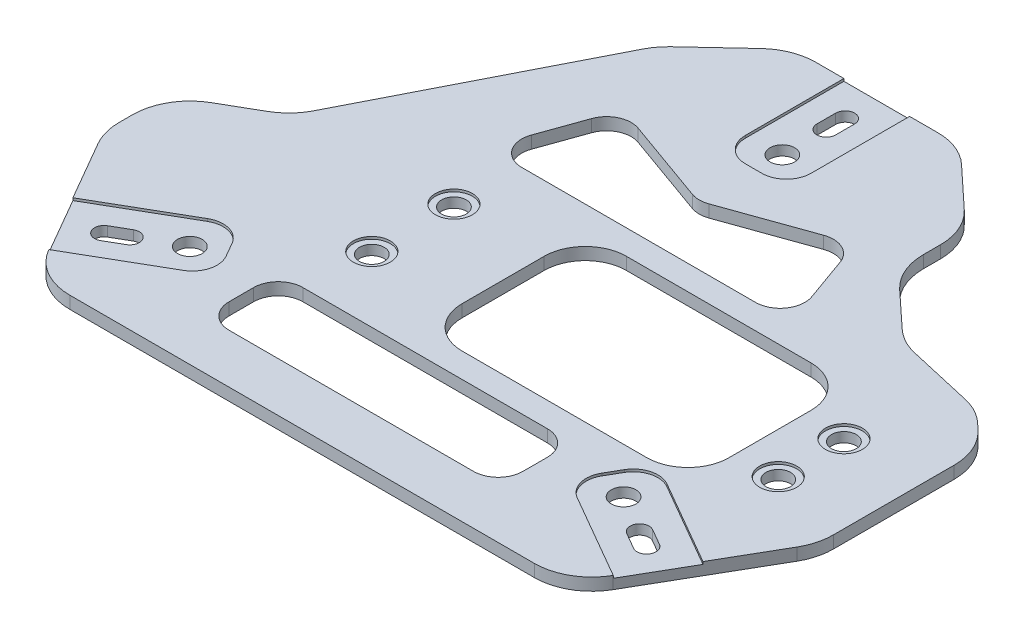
ISO-10303-21;
HEADER;
FILE_DESCRIPTION(('STEP AP214'),'2;1');
FILE_NAME('part.step','',(''),(''),'','','');
FILE_SCHEMA(('AUTOMOTIVE_DESIGN { 1 0 10303 214 1 1 1 1 }'));
ENDSEC;
DATA;
#1=APPLICATION_CONTEXT('core data for automotive mechanical design processes');
#2=APPLICATION_PROTOCOL_DEFINITION('international standard','automotive_design',2000,#1);
#3=PRODUCT_CONTEXT('',#1,'mechanical');
#4=PRODUCT('Part','Part','',(#3));
#5=PRODUCT_RELATED_PRODUCT_CATEGORY('part','',(#4));
#6=PRODUCT_DEFINITION_FORMATION('','',#4);
#7=PRODUCT_DEFINITION_CONTEXT('part definition',#1,'design');
#8=PRODUCT_DEFINITION('design','',#6,#7);
#9=PRODUCT_DEFINITION_SHAPE('','',#8);
#10=(LENGTH_UNIT() NAMED_UNIT(*) SI_UNIT(.MILLI.,.METRE.));
#11=(NAMED_UNIT(*) PLANE_ANGLE_UNIT() SI_UNIT($,.RADIAN.));
#12=(NAMED_UNIT(*) SI_UNIT($,.STERADIAN.) SOLID_ANGLE_UNIT());
#13=UNCERTAINTY_MEASURE_WITH_UNIT(LENGTH_MEASURE(1.E-05),#10,'distance_accuracy_value','');
#14=(GEOMETRIC_REPRESENTATION_CONTEXT(3) GLOBAL_UNCERTAINTY_ASSIGNED_CONTEXT((#13)) GLOBAL_UNIT_ASSIGNED_CONTEXT((#10,
#11,#12)) REPRESENTATION_CONTEXT('',''));
#15=CARTESIAN_POINT('',(0.,0.,0.));
#16=DIRECTION('',(0.,0.,1.));
#17=DIRECTION('',(1.,0.,0.));
#18=AXIS2_PLACEMENT_3D('',#15,#16,#17);
#19=CARTESIAN_POINT('',(0.,0.75,0.));
#20=DIRECTION('',(0.,-1.,0.));
#21=DIRECTION('',(0.,0.,-1.));
#22=AXIS2_PLACEMENT_3D('',#19,#20,#21);
#23=PLANE('',#22);
#24=CARTESIAN_POINT('',(-14.5,0.75,-5.));
#25=DIRECTION('',(0.,1.,0.));
#26=DIRECTION('',(0.,0.,1.));
#27=AXIS2_PLACEMENT_3D('',#24,#25,#26);
#28=CIRCLE('',#27,2.25);
#29=CARTESIAN_POINT('',(-14.5,0.75,-2.75));
#30=VERTEX_POINT('',#29);
#31=EDGE_CURVE('E2331',#30,#30,#28,.T.);
#32=ORIENTED_EDGE('',*,*,#31,.F.);
#33=EDGE_LOOP('',(#32));
#34=FACE_BOUND('',#33,.T.);
#35=CARTESIAN_POINT('',(-14.5,0.75,5.));
#36=DIRECTION('',(0.,1.,0.));
#37=DIRECTION('',(0.,0.,1.));
#38=AXIS2_PLACEMENT_3D('',#35,#36,#37);
#39=CIRCLE('',#38,2.25);
#40=CARTESIAN_POINT('',(-14.5,0.75,7.25));
#41=VERTEX_POINT('',#40);
#42=EDGE_CURVE('E2341',#41,#41,#39,.T.);
#43=ORIENTED_EDGE('',*,*,#42,.F.);
#44=EDGE_LOOP('',(#43));
#45=FACE_BOUND('',#44,.T.);
#46=CARTESIAN_POINT('',(34.,0.75,4.));
#47=DIRECTION('',(0.,1.,0.));
#48=DIRECTION('',(0.,0.,1.));
#49=AXIS2_PLACEMENT_3D('',#46,#47,#48);
#50=CIRCLE('',#49,2.25);
#51=CARTESIAN_POINT('',(34.,0.75,6.25));
#52=VERTEX_POINT('',#51);
#53=EDGE_CURVE('E1265',#52,#52,#50,.T.);
#54=ORIENTED_EDGE('',*,*,#53,.F.);
#55=EDGE_LOOP('',(#54));
#56=FACE_BOUND('',#55,.T.);
#57=DIRECTION('',(-0.941671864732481,0.,-0.336532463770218));
#58=VECTOR('',#57,1.);
#59=CARTESIAN_POINT('',(0.,0.75,-20.193747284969));
#60=LINE('',#59,#58);
#61=CARTESIAN_POINT('',(-1.00959739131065,0.75,-20.5545548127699));
#62=VERTEX_POINT('',#61);
#63=CARTESIAN_POINT('',(-11.3000623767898,0.75,-24.2321368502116));
#64=VERTEX_POINT('',#63);
#65=EDGE_CURVE('E1177',#62,#64,#60,.T.);
#66=ORIENTED_EDGE('',*,*,#65,.F.);
#67=CARTESIAN_POINT('',(0.,0.75,-23.3795704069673));
#68=DIRECTION('',(0.,-1.,0.));
#69=DIRECTION('',(0.,0.,-1.));
#70=AXIS2_PLACEMENT_3D('',#67,#68,#69);
#71=CIRCLE('',#70,3.);
#72=CARTESIAN_POINT('',(1.00959739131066,0.75,-20.5545548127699));
#73=VERTEX_POINT('',#72);
#74=EDGE_CURVE('E1107',#62,#73,#71,.F.);
#75=ORIENTED_EDGE('',*,*,#74,.T.);
#76=DIRECTION('',(-0.94167186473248,0.,0.336532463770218));
#77=VECTOR('',#76,1.);
#78=CARTESIAN_POINT('',(14.1250779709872,0.75,-25.2417342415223));
#79=LINE('',#78,#77);
#80=CARTESIAN_POINT('',(11.3000623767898,0.75,-24.2321368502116));
#81=VERTEX_POINT('',#80);
#82=EDGE_CURVE('E1149',#81,#73,#79,.T.);
#83=ORIENTED_EDGE('',*,*,#82,.F.);
#84=CARTESIAN_POINT('',(12.3096597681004,0.75,-21.4071212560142));
#85=DIRECTION('',(0.,-1.,0.));
#86=DIRECTION('',(0.,0.,-1.));
#87=AXIS2_PLACEMENT_3D('',#84,#85,#86);
#88=CIRCLE('',#87,3.);
#89=CARTESIAN_POINT('',(15.1346753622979,0.75,-22.4167186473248));
#90=VERTEX_POINT('',#89);
#91=EDGE_CURVE('E47',#81,#90,#88,.T.);
#92=ORIENTED_EDGE('',*,*,#91,.T.);
#93=DIRECTION('',(-0.336532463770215,0.,-0.941671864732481));
#94=VECTOR('',#93,1.);
#95=CARTESIAN_POINT('',(18.5,0.75,-13.));
#96=LINE('',#95,#94);
#97=CARTESIAN_POINT('',(17.0670595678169,0.75,-17.0095973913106));
#98=VERTEX_POINT('',#97);
#99=EDGE_CURVE('E1148',#98,#90,#96,.T.);
#100=ORIENTED_EDGE('',*,*,#99,.F.);
#101=CARTESIAN_POINT('',(14.2420439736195,0.75,-16.));
#102=DIRECTION('',(0.,-1.,0.));
#103=DIRECTION('',(0.,0.,-1.));
#104=AXIS2_PLACEMENT_3D('',#101,#102,#103);
#105=CIRCLE('',#104,3.);
#106=CARTESIAN_POINT('',(14.2420439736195,0.75,-13.));
#107=VERTEX_POINT('',#106);
#108=EDGE_CURVE('E1131',#98,#107,#105,.T.);
#109=ORIENTED_EDGE('',*,*,#108,.T.);
#110=DIRECTION('',(1.,0.,0.));
#111=VECTOR('',#110,1.);
#112=CARTESIAN_POINT('',(-18.5,0.75,-13.));
#113=LINE('',#112,#111);
#114=CARTESIAN_POINT('',(-14.2420439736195,0.75,-13.));
#115=VERTEX_POINT('',#114);
#116=EDGE_CURVE('E1157',#115,#107,#113,.T.);
#117=ORIENTED_EDGE('',*,*,#116,.F.);
#118=CARTESIAN_POINT('',(-14.2420439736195,0.75,-16.));
#119=DIRECTION('',(0.,-1.,0.));
#120=DIRECTION('',(0.,0.,-1.));
#121=AXIS2_PLACEMENT_3D('',#118,#119,#120);
#122=CIRCLE('',#121,3.);
#123=CARTESIAN_POINT('',(-17.0670595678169,0.75,-17.0095973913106));
#124=VERTEX_POINT('',#123);
#125=EDGE_CURVE('E1135',#115,#124,#122,.T.);
#126=ORIENTED_EDGE('',*,*,#125,.T.);
#127=DIRECTION('',(-0.336532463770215,0.,0.941671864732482));
#128=VECTOR('',#127,1.);
#129=CARTESIAN_POINT('',(-14.1250779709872,0.75,-25.2417342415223));
#130=LINE('',#129,#128);
#131=CARTESIAN_POINT('',(-15.1346753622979,0.75,-22.4167186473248));
#132=VERTEX_POINT('',#131);
#133=EDGE_CURVE('E1292',#132,#124,#130,.T.);
#134=ORIENTED_EDGE('',*,*,#133,.F.);
#135=CARTESIAN_POINT('',(-12.3096597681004,0.75,-21.4071212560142));
#136=DIRECTION('',(0.,-1.,0.));
#137=DIRECTION('',(0.,0.,-1.));
#138=AXIS2_PLACEMENT_3D('',#135,#136,#137);
#139=CIRCLE('',#138,3.);
#140=EDGE_CURVE('E1139',#132,#64,#139,.T.);
#141=ORIENTED_EDGE('',*,*,#140,.T.);
#142=EDGE_LOOP('',(#66,#75,#83,#92,#100,#109,#117,#126,#134,#141));
#143=FACE_BOUND('',#142,.T.);
#144=DIRECTION('',(1.,0.,0.));
#145=VECTOR('',#144,1.);
#146=CARTESIAN_POINT('',(-17.895,0.75,22.));
#147=LINE('',#146,#145);
#148=CARTESIAN_POINT('',(-14.895,0.75,22.));
#149=VERTEX_POINT('',#148);
#150=CARTESIAN_POINT('',(14.895,0.75,22.));
#151=VERTEX_POINT('',#150);
#152=EDGE_CURVE('E1283',#149,#151,#147,.T.);
#153=ORIENTED_EDGE('',*,*,#152,.F.);
#154=CARTESIAN_POINT('',(-14.895,0.75,19.));
#155=DIRECTION('',(0.,-1.,0.));
#156=DIRECTION('',(0.,0.,-1.));
#157=AXIS2_PLACEMENT_3D('',#154,#155,#156);
#158=CIRCLE('',#157,3.);
#159=CARTESIAN_POINT('',(-17.895,0.75,19.));
#160=VERTEX_POINT('',#159);
#161=EDGE_CURVE('E1119',#149,#160,#158,.T.);
#162=ORIENTED_EDGE('',*,*,#161,.T.);
#163=DIRECTION('',(0.,0.,1.));
#164=VECTOR('',#163,1.);
#165=CARTESIAN_POINT('',(-17.895,0.75,13.));
#166=LINE('',#165,#164);
#167=CARTESIAN_POINT('',(-17.895,0.75,16.));
#168=VERTEX_POINT('',#167);
#169=EDGE_CURVE('E1193',#168,#160,#166,.T.);
#170=ORIENTED_EDGE('',*,*,#169,.F.);
#171=CARTESIAN_POINT('',(-14.895,0.75,16.));
#172=DIRECTION('',(0.,-1.,0.));
#173=DIRECTION('',(0.,0.,-1.));
#174=AXIS2_PLACEMENT_3D('',#171,#172,#173);
#175=CIRCLE('',#174,3.);
#176=CARTESIAN_POINT('',(-14.895,0.75,13.));
#177=VERTEX_POINT('',#176);
#178=EDGE_CURVE('E1123',#168,#177,#175,.T.);
#179=ORIENTED_EDGE('',*,*,#178,.T.);
#180=DIRECTION('',(-1.,0.,0.));
#181=VECTOR('',#180,1.);
#182=CARTESIAN_POINT('',(-17.895,0.75,13.));
#183=LINE('',#182,#181);
#184=CARTESIAN_POINT('',(14.895,0.75,13.));
#185=VERTEX_POINT('',#184);
#186=EDGE_CURVE('E1276',#185,#177,#183,.T.);
#187=ORIENTED_EDGE('',*,*,#186,.F.);
#188=CARTESIAN_POINT('',(14.895,0.75,16.));
#189=DIRECTION('',(0.,-1.,0.));
#190=DIRECTION('',(0.,0.,-1.));
#191=AXIS2_PLACEMENT_3D('',#188,#189,#190);
#192=CIRCLE('',#191,3.);
#193=CARTESIAN_POINT('',(17.895,0.75,16.));
#194=VERTEX_POINT('',#193);
#195=EDGE_CURVE('E1127',#185,#194,#192,.T.);
#196=ORIENTED_EDGE('',*,*,#195,.T.);
#197=DIRECTION('',(0.,0.,-1.));
#198=VECTOR('',#197,1.);
#199=CARTESIAN_POINT('',(17.895,0.75,13.));
#200=LINE('',#199,#198);
#201=CARTESIAN_POINT('',(17.895,0.75,19.));
#202=VERTEX_POINT('',#201);
#203=EDGE_CURVE('E1279',#202,#194,#200,.T.);
#204=ORIENTED_EDGE('',*,*,#203,.F.);
#205=CARTESIAN_POINT('',(14.895,0.75,19.));
#206=DIRECTION('',(0.,-1.,0.));
#207=DIRECTION('',(0.,0.,-1.));
#208=AXIS2_PLACEMENT_3D('',#205,#206,#207);
#209=CIRCLE('',#208,3.);
#210=EDGE_CURVE('E1115',#202,#151,#209,.T.);
#211=ORIENTED_EDGE('',*,*,#210,.T.);
#212=EDGE_LOOP('',(#153,#162,#170,#179,#187,#196,#204,#211));
#213=FACE_BOUND('',#212,.T.);
#214=DIRECTION('',(1.,0.,0.));
#215=VECTOR('',#214,1.);
#216=CARTESIAN_POINT('',(29.,0.75,10.));
#217=LINE('',#216,#215);
#218=CARTESIAN_POINT('',(1.5,0.75,10.));
#219=VERTEX_POINT('',#218);
#220=CARTESIAN_POINT('',(24.,0.75,10.));
#221=VERTEX_POINT('',#220);
#222=EDGE_CURVE('E1192',#219,#221,#217,.T.);
#223=ORIENTED_EDGE('',*,*,#222,.F.);
#224=CARTESIAN_POINT('',(1.5,0.75,5.));
#225=DIRECTION('',(0.,-1.,0.));
#226=DIRECTION('',(0.,0.,-1.));
#227=AXIS2_PLACEMENT_3D('',#224,#225,#226);
#228=CIRCLE('',#227,5.);
#229=CARTESIAN_POINT('',(-3.5,0.75,5.));
#230=VERTEX_POINT('',#229);
#231=EDGE_CURVE('E1055',#219,#230,#228,.T.);
#232=ORIENTED_EDGE('',*,*,#231,.T.);
#233=DIRECTION('',(0.,0.,1.));
#234=VECTOR('',#233,1.);
#235=CARTESIAN_POINT('',(-3.5,0.75,10.));
#236=LINE('',#235,#234);
#237=CARTESIAN_POINT('',(-3.5,0.75,-5.));
#238=VERTEX_POINT('',#237);
#239=EDGE_CURVE('E1189',#238,#230,#236,.T.);
#240=ORIENTED_EDGE('',*,*,#239,.F.);
#241=CARTESIAN_POINT('',(1.5,0.75,-5.));
#242=DIRECTION('',(0.,-1.,0.));
#243=DIRECTION('',(0.,0.,-1.));
#244=AXIS2_PLACEMENT_3D('',#241,#242,#243);
#245=CIRCLE('',#244,5.);
#246=CARTESIAN_POINT('',(1.5,0.75,-10.));
#247=VERTEX_POINT('',#246);
#248=EDGE_CURVE('E1059',#238,#247,#245,.T.);
#249=ORIENTED_EDGE('',*,*,#248,.T.);
#250=DIRECTION('',(-1.,0.,0.));
#251=VECTOR('',#250,1.);
#252=CARTESIAN_POINT('',(-3.5,0.75,-10.));
#253=LINE('',#252,#251);
#254=CARTESIAN_POINT('',(24.,0.75,-10.));
#255=VERTEX_POINT('',#254);
#256=EDGE_CURVE('E590',#255,#247,#253,.T.);
#257=ORIENTED_EDGE('',*,*,#256,.F.);
#258=CARTESIAN_POINT('',(24.,0.75,-5.));
#259=DIRECTION('',(0.,-1.,0.));
#260=DIRECTION('',(0.,0.,-1.));
#261=AXIS2_PLACEMENT_3D('',#258,#259,#260);
#262=CIRCLE('',#261,5.);
#263=CARTESIAN_POINT('',(29.,0.75,-5.));
#264=VERTEX_POINT('',#263);
#265=EDGE_CURVE('E1063',#255,#264,#262,.T.);
#266=ORIENTED_EDGE('',*,*,#265,.T.);
#267=DIRECTION('',(0.,0.,-1.));
#268=VECTOR('',#267,1.);
#269=CARTESIAN_POINT('',(29.,0.75,-10.));
#270=LINE('',#269,#268);
#271=CARTESIAN_POINT('',(29.,0.75,5.));
#272=VERTEX_POINT('',#271);
#273=EDGE_CURVE('E1195',#272,#264,#270,.T.);
#274=ORIENTED_EDGE('',*,*,#273,.F.);
#275=CARTESIAN_POINT('',(24.,0.75,5.));
#276=DIRECTION('',(0.,-1.,0.));
#277=DIRECTION('',(0.,0.,-1.));
#278=AXIS2_PLACEMENT_3D('',#275,#276,#277);
#279=CIRCLE('',#278,5.);
#280=EDGE_CURVE('E1051',#272,#221,#279,.T.);
#281=ORIENTED_EDGE('',*,*,#280,.T.);
#282=EDGE_LOOP('',(#223,#232,#240,#249,#257,#266,#274,#281));
#283=FACE_BOUND('',#282,.T.);
#284=DIRECTION('',(-0.866011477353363,0.,-0.500024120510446));
#285=VECTOR('',#284,1.);
#286=CARTESIAN_POINT('',(2.00028449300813,0.75,-3.46437153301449));
#287=LINE('',#286,#285);
#288=CARTESIAN_POINT('',(38.371458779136,0.75,17.5358864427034));
#289=VERTEX_POINT('',#288);
#290=CARTESIAN_POINT('',(27.9806046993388,0.75,11.536338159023));
#291=VERTEX_POINT('',#290);
#292=EDGE_CURVE('E673',#289,#291,#287,.T.);
#293=ORIENTED_EDGE('',*,*,#292,.F.);
#294=DIRECTION('',(0.500000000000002,0.,-0.866025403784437));
#295=VECTOR('',#294,1.);
#296=CARTESIAN_POINT('',(32.33,0.75,28.));
#297=LINE('',#296,#295);
#298=CARTESIAN_POINT('',(42.5621778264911,0.75,10.2773481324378));
#299=VERTEX_POINT('',#298);
#300=EDGE_CURVE('E781',#289,#299,#297,.T.);
#301=ORIENTED_EDGE('',*,*,#300,.T.);
#302=CARTESIAN_POINT('',(36.5,0.75,6.7773481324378));
#303=DIRECTION('',(0.,-1.,0.));
#304=DIRECTION('',(0.,0.,-1.));
#305=AXIS2_PLACEMENT_3D('',#302,#303,#304);
#306=CIRCLE('',#305,7.);
#307=CARTESIAN_POINT('',(43.5,0.75,6.7773481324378));
#308=VERTEX_POINT('',#307);
#309=EDGE_CURVE('E868',#299,#308,#306,.F.);
#310=ORIENTED_EDGE('',*,*,#309,.T.);
#311=DIRECTION('',(0.,0.,-1.));
#312=VECTOR('',#311,1.);
#313=CARTESIAN_POINT('',(43.5,0.75,8.65299247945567));
#314=LINE('',#313,#312);
#315=CARTESIAN_POINT('',(43.5,0.75,-7.93516514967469));
#316=VERTEX_POINT('',#315);
#317=EDGE_CURVE('E785',#308,#316,#314,.T.);
#318=ORIENTED_EDGE('',*,*,#317,.T.);
#319=CARTESIAN_POINT('',(36.5,0.75,-7.93516514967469));
#320=DIRECTION('',(0.,-1.,0.));
#321=DIRECTION('',(0.,0.,-1.));
#322=AXIS2_PLACEMENT_3D('',#319,#320,#321);
#323=CIRCLE('',#322,7.);
#324=CARTESIAN_POINT('',(41.3253317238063,0.75,-13.0062768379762));
#325=VERTEX_POINT('',#324);
#326=EDGE_CURVE('E870',#316,#325,#323,.F.);
#327=ORIENTED_EDGE('',*,*,#326,.T.);
#328=DIRECTION('',(-0.724444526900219,0.,-0.689333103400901));
#329=VECTOR('',#328,1.);
#330=CARTESIAN_POINT('',(43.5,0.75,-10.9370075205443));
#331=LINE('',#330,#329);
#332=CARTESIAN_POINT('',(40.501793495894,0.75,-13.789900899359));
#333=VERTEX_POINT('',#332);
#334=EDGE_CURVE('E788',#325,#333,#331,.T.);
#335=ORIENTED_EDGE('',*,*,#334,.T.);
#336=CARTESIAN_POINT('',(35.6764617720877,0.75,-8.71878921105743));
#337=DIRECTION('',(0.,-1.,0.));
#338=DIRECTION('',(0.,0.,-1.));
#339=AXIS2_PLACEMENT_3D('',#336,#337,#338);
#340=CIRCLE('',#339,7.);
#341=CARTESIAN_POINT('',(37.2368382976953,0.75,-15.54266091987));
#342=VERTEX_POINT('',#341);
#343=EDGE_CURVE('E931',#333,#342,#340,.F.);
#344=ORIENTED_EDGE('',*,*,#343,.T.);
#345=DIRECTION('',(-0.974838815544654,0.,-0.222910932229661));
#346=VECTOR('',#345,1.);
#347=CARTESIAN_POINT('',(39.1098661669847,0.75,-15.1143661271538));
#348=LINE('',#347,#346);
#349=CARTESIAN_POINT('',(29.2402512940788,0.75,-17.3711956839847));
#350=VERTEX_POINT('',#349);
#351=EDGE_CURVE('E791',#342,#350,#348,.T.);
#352=ORIENTED_EDGE('',*,*,#351,.T.);
#353=CARTESIAN_POINT('',(30.8006278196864,0.75,-24.1950673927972));
#354=DIRECTION('',(0.,-1.,0.));
#355=DIRECTION('',(0.,0.,-1.));
#356=AXIS2_PLACEMENT_3D('',#353,#354,#355);
#357=CIRCLE('',#356,7.);
#358=CARTESIAN_POINT('',(26.037366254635,0.75,-19.0656094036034));
#359=VERTEX_POINT('',#358);
#360=EDGE_CURVE('E977',#350,#359,#357,.T.);
#361=ORIENTED_EDGE('',*,*,#360,.T.);
#362=DIRECTION('',(-0.732779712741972,0.,-0.680465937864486));
#363=VECTOR('',#362,1.);
#364=CARTESIAN_POINT('',(27.4118003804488,0.75,-17.7892973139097));
#365=LINE('',#364,#363);
#366=CARTESIAN_POINT('',(21.6539121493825,0.75,-23.1361249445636));
#367=VERTEX_POINT('',#366);
#368=EDGE_CURVE('E794',#359,#367,#365,.T.);
#369=ORIENTED_EDGE('',*,*,#368,.T.);
#370=CARTESIAN_POINT('',(26.4171737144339,0.75,-28.2655829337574));
#371=DIRECTION('',(0.,-1.,0.));
#372=DIRECTION('',(0.,0.,-1.));
#373=AXIS2_PLACEMENT_3D('',#370,#371,#372);
#374=CIRCLE('',#373,7.);
#375=CARTESIAN_POINT('',(19.4171737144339,0.75,-28.2655829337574));
#376=VERTEX_POINT('',#375);
#377=EDGE_CURVE('E973',#367,#376,#374,.T.);
#378=ORIENTED_EDGE('',*,*,#377,.T.);
#379=DIRECTION('',(0.,0.,-1.));
#380=VECTOR('',#379,1.);
#381=CARTESIAN_POINT('',(19.4171737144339,0.75,-25.2131806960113));
#382=LINE('',#381,#380);
#383=CARTESIAN_POINT('',(19.4171737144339,0.75,-30.3494940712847));
#384=VERTEX_POINT('',#383);
#385=EDGE_CURVE('E797',#376,#384,#382,.T.);
#386=ORIENTED_EDGE('',*,*,#385,.T.);
#387=CARTESIAN_POINT('',(12.4171737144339,0.75,-30.3494940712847));
#388=DIRECTION('',(0.,-1.,0.));
#389=DIRECTION('',(0.,0.,-1.));
#390=AXIS2_PLACEMENT_3D('',#387,#388,#389);
#391=CIRCLE('',#390,7.);
#392=CARTESIAN_POINT('',(17.1911622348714,0.75,-35.4689699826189));
#393=VERTEX_POINT('',#392);
#394=EDGE_CURVE('E933',#384,#393,#391,.F.);
#395=ORIENTED_EDGE('',*,*,#394,.T.);
#396=DIRECTION('',(-0.731353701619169,0.,-0.6819983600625));
#397=VECTOR('',#396,1.);
#398=CARTESIAN_POINT('',(19.4171737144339,0.75,-33.3931806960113));
#399=LINE('',#398,#397);
#400=CARTESIAN_POINT('',(12.2041051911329,0.75,-40.1194759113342));
#401=VERTEX_POINT('',#400);
#402=EDGE_CURVE('E800',#393,#401,#399,.T.);
#403=ORIENTED_EDGE('',*,*,#402,.T.);
#404=CARTESIAN_POINT('',(7.43011667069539,0.75,-35.));
#405=DIRECTION('',(0.,-1.,0.));
#406=DIRECTION('',(0.,0.,-1.));
#407=AXIS2_PLACEMENT_3D('',#404,#405,#406);
#408=CIRCLE('',#407,7.);
#409=CARTESIAN_POINT('',(7.43011667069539,0.75,-42.));
#410=VERTEX_POINT('',#409);
#411=EDGE_CURVE('E872',#401,#410,#408,.F.);
#412=ORIENTED_EDGE('',*,*,#411,.T.);
#413=DIRECTION('',(-1.,0.,0.));
#414=VECTOR('',#413,1.);
#415=CARTESIAN_POINT('',(10.18749,0.75,-42.));
#416=LINE('',#415,#414);
#417=CARTESIAN_POINT('',(4.00037600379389,0.75,-42.));
#418=VERTEX_POINT('',#417);
#419=EDGE_CURVE('E803',#410,#418,#416,.T.);
#420=ORIENTED_EDGE('',*,*,#419,.T.);
#421=DIRECTION('',(0.,0.,-1.));
#422=VECTOR('',#421,1.);
#423=CARTESIAN_POINT('',(4.00037600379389,0.75,0.));
#424=LINE('',#423,#422);
#425=CARTESIAN_POINT('',(4.00037600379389,0.75,-30.0000000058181));
#426=VERTEX_POINT('',#425);
#427=EDGE_CURVE('E986',#426,#418,#424,.T.);
#428=ORIENTED_EDGE('',*,*,#427,.F.);
#429=CARTESIAN_POINT('',(1.00037600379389,0.75,-30.0000000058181));
#430=DIRECTION('',(0.,1.,0.));
#431=DIRECTION('',(0.,0.,1.));
#432=AXIS2_PLACEMENT_3D('',#429,#430,#431);
#433=CIRCLE('',#432,3.);
#434=CARTESIAN_POINT('',(1.00037600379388,0.75,-27.0000000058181));
#435=VERTEX_POINT('',#434);
#436=EDGE_CURVE('E985',#426,#435,#433,.F.);
#437=ORIENTED_EDGE('',*,*,#436,.T.);
#438=DIRECTION('',(1.,0.,0.));
#439=VECTOR('',#438,1.);
#440=CARTESIAN_POINT('',(0.,0.75,-27.0000000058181));
#441=LINE('',#440,#439);
#442=CARTESIAN_POINT('',(-0.999540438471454,0.75,-27.0000000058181));
#443=VERTEX_POINT('',#442);
#444=EDGE_CURVE('E989',#435,#443,#441,.F.);
#445=ORIENTED_EDGE('',*,*,#444,.T.);
#446=CARTESIAN_POINT('',(-0.999540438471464,0.75,-30.0000000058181));
#447=DIRECTION('',(0.,1.,0.));
#448=DIRECTION('',(0.,0.,1.));
#449=AXIS2_PLACEMENT_3D('',#446,#447,#448);
#450=CIRCLE('',#449,3.);
#451=CARTESIAN_POINT('',(-3.99954043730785,0.75,-30.0000835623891));
#452=VERTEX_POINT('',#451);
#453=EDGE_CURVE('E988',#452,#443,#450,.T.);
#454=ORIENTED_EDGE('',*,*,#453,.F.);
#455=DIRECTION('',(-2.7852190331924E-05,0.,0.999999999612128));
#456=VECTOR('',#455,1.);
#457=CARTESIAN_POINT('',(-4.00037600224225,0.75,-0.000111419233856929));
#458=LINE('',#457,#456);
#459=CARTESIAN_POINT('',(-3.99920621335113,0.75,-42.));
#460=VERTEX_POINT('',#459);
#461=EDGE_CURVE('E990',#460,#452,#458,.T.);
#462=ORIENTED_EDGE('',*,*,#461,.F.);
#463=CARTESIAN_POINT('',(-7.42894687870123,0.75,-42.));
#464=VERTEX_POINT('',#463);
#465=EDGE_CURVE('E802',#460,#464,#416,.T.);
#466=ORIENTED_EDGE('',*,*,#465,.T.);
#467=CARTESIAN_POINT('',(-7.42894687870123,0.75,-35.));
#468=DIRECTION('',(0.,-1.,0.));
#469=DIRECTION('',(0.,0.,-1.));
#470=AXIS2_PLACEMENT_3D('',#467,#468,#469);
#471=CIRCLE('',#470,7.);
#472=CARTESIAN_POINT('',(-12.2044163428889,0.75,-40.1180945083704));
#473=VERTEX_POINT('',#472);
#474=EDGE_CURVE('E860',#464,#473,#471,.F.);
#475=ORIENTED_EDGE('',*,*,#474,.T.);
#476=DIRECTION('',(-0.731156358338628,0.,0.682209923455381));
#477=VECTOR('',#476,1.);
#478=CARTESIAN_POINT('',(-10.18749,0.75,-42.));
#479=LINE('',#478,#477);
#480=CARTESIAN_POINT('',(-17.8834306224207,0.75,-34.8192554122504));
#481=VERTEX_POINT('',#480);
#482=EDGE_CURVE('E806',#473,#481,#479,.T.);
#483=ORIENTED_EDGE('',*,*,#482,.T.);
#484=CARTESIAN_POINT('',(-13.1079611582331,0.75,-29.70116090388));
#485=DIRECTION('',(0.,-1.,0.));
#486=DIRECTION('',(0.,0.,-1.));
#487=AXIS2_PLACEMENT_3D('',#484,#485,#486);
#488=CIRCLE('',#487,7.);
#489=CARTESIAN_POINT('',(-19.3459259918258,0.75,-32.8772897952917));
#490=VERTEX_POINT('',#489);
#491=EDGE_CURVE('E927',#481,#490,#488,.F.);
#492=ORIENTED_EDGE('',*,*,#491,.T.);
#493=DIRECTION('',(-0.4537326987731,0.,0.891137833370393));
#494=VECTOR('',#493,1.);
#495=CARTESIAN_POINT('',(-18.7858887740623,0.75,-33.9772113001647));
#496=LINE('',#495,#494);
#497=CARTESIAN_POINT('',(-32.8649246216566,0.75,-6.32577349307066));
#498=VERTEX_POINT('',#497);
#499=EDGE_CURVE('E809',#490,#498,#496,.T.);
#500=ORIENTED_EDGE('',*,*,#499,.T.);
#501=CARTESIAN_POINT('',(-39.1028894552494,0.75,-9.50190238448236));
#502=DIRECTION('',(0.,-1.,0.));
#503=DIRECTION('',(0.,0.,-1.));
#504=AXIS2_PLACEMENT_3D('',#501,#502,#503);
#505=CIRCLE('',#504,7.);
#506=CARTESIAN_POINT('',(-35.6125128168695,0.75,-3.43417868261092));
#507=VERTEX_POINT('',#506);
#508=EDGE_CURVE('E981',#498,#507,#505,.T.);
#509=ORIENTED_EDGE('',*,*,#508,.T.);
#510=DIRECTION('',(-0.86681767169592,0.,0.498625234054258));
#511=VECTOR('',#510,1.);
#512=CARTESIAN_POINT('',(-33.8089784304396,0.75,-4.471637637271));
#513=LINE('',#512,#511);
#514=CARTESIAN_POINT('',(-39.9903766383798,0.75,-0.915871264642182));
#515=VERTEX_POINT('',#514);
#516=EDGE_CURVE('E812',#507,#515,#513,.T.);
#517=ORIENTED_EDGE('',*,*,#516,.T.);
#518=CARTESIAN_POINT('',(-36.5,0.75,5.15185243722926));
#519=DIRECTION('',(0.,-1.,0.));
#520=DIRECTION('',(0.,0.,-1.));
#521=AXIS2_PLACEMENT_3D('',#518,#519,#520);
#522=CIRCLE('',#521,7.);
#523=CARTESIAN_POINT('',(-43.5,0.75,5.15185243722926));
#524=VERTEX_POINT('',#523);
#525=EDGE_CURVE('E929',#515,#524,#522,.F.);
#526=ORIENTED_EDGE('',*,*,#525,.T.);
#527=DIRECTION('',(0.,0.,1.));
#528=VECTOR('',#527,1.);
#529=CARTESIAN_POINT('',(-43.5,0.75,1.10299247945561));
#530=LINE('',#529,#528);
#531=CARTESIAN_POINT('',(-43.5,0.75,6.77734813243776));
#532=VERTEX_POINT('',#531);
#533=EDGE_CURVE('E815',#524,#532,#530,.T.);
#534=ORIENTED_EDGE('',*,*,#533,.T.);
#535=CARTESIAN_POINT('',(-36.5,0.75,6.77734813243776));
#536=DIRECTION('',(0.,-1.,0.));
#537=DIRECTION('',(0.,0.,-1.));
#538=AXIS2_PLACEMENT_3D('',#535,#536,#537);
#539=CIRCLE('',#538,7.);
#540=CARTESIAN_POINT('',(-42.5621778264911,0.75,10.2773481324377));
#541=VERTEX_POINT('',#540);
#542=EDGE_CURVE('E862',#532,#541,#539,.F.);
#543=ORIENTED_EDGE('',*,*,#542,.T.);
#544=DIRECTION('',(0.499999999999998,0.,0.86602540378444));
#545=VECTOR('',#544,1.);
#546=CARTESIAN_POINT('',(-43.5,0.75,8.65299247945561));
#547=LINE('',#546,#545);
#548=CARTESIAN_POINT('',(-38.3720436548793,0.75,17.5348734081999));
#549=VERTEX_POINT('',#548);
#550=EDGE_CURVE('E775',#541,#549,#547,.T.);
#551=ORIENTED_EDGE('',*,*,#550,.T.);
#552=DIRECTION('',(-0.866025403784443,0.,0.499999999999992));
#553=VECTOR('',#552,1.);
#554=CARTESIAN_POINT('',(-2.00018800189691,0.75,-3.4644272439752));
#555=LINE('',#554,#553);
#556=CARTESIAN_POINT('',(-27.9809501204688,0.75,11.5355727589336));
#557=VERTEX_POINT('',#556);
#558=EDGE_CURVE('E703',#557,#549,#555,.T.);
#559=ORIENTED_EDGE('',*,*,#558,.F.);
#560=CARTESIAN_POINT('',(-26.4809501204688,0.75,14.1336489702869));
#561=DIRECTION('',(0.,1.,0.));
#562=DIRECTION('',(0.,0.,1.));
#563=AXIS2_PLACEMENT_3D('',#560,#561,#562);
#564=CIRCLE('',#563,3.);
#565=CARTESIAN_POINT('',(-23.8828739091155,0.75,12.633648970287));
#566=VERTEX_POINT('',#565);
#567=EDGE_CURVE('E1015',#557,#566,#564,.F.);
#568=ORIENTED_EDGE('',*,*,#567,.T.);
#569=DIRECTION('',(0.499999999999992,0.,0.866025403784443));
#570=VECTOR('',#569,1.);
#571=CARTESIAN_POINT('',(-23.8828739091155,0.75,12.633648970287));
#572=LINE('',#571,#570);
#573=CARTESIAN_POINT('',(-22.8829156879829,0.75,14.3656274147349));
#574=VERTEX_POINT('',#573);
#575=EDGE_CURVE('E1018',#566,#574,#572,.T.);
#576=ORIENTED_EDGE('',*,*,#575,.T.);
#577=CARTESIAN_POINT('',(-25.4809918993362,0.75,15.8656274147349));
#578=DIRECTION('',(0.,1.,0.));
#579=DIRECTION('',(0.,0.,1.));
#580=AXIS2_PLACEMENT_3D('',#577,#578,#579);
#581=CIRCLE('',#580,3.);
#582=CARTESIAN_POINT('',(-23.9810642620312,0.75,18.463745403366));
#583=VERTEX_POINT('',#582);
#584=EDGE_CURVE('E1019',#583,#574,#581,.T.);
#585=ORIENTED_EDGE('',*,*,#584,.F.);
#586=DIRECTION('',(0.866039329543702,0.,-0.499975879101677));
#587=VECTOR('',#586,1.);
#588=CARTESIAN_POINT('',(2.00009150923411,0.75,3.46448295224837));
#589=LINE('',#588,#587);
#590=CARTESIAN_POINT('',(-34.3722525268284,0.75,24.4627148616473));
#591=VERTEX_POINT('',#590);
#592=EDGE_CURVE('E701',#591,#583,#589,.T.);
#593=ORIENTED_EDGE('',*,*,#592,.F.);
#594=CARTESIAN_POINT('',(-34.3507259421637,0.75,24.5));
#595=VERTEX_POINT('',#594);
#596=EDGE_CURVE('E774',#591,#595,#547,.T.);
#597=ORIENTED_EDGE('',*,*,#596,.T.);
#598=CARTESIAN_POINT('',(-28.2885481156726,0.75,21.));
#599=DIRECTION('',(0.,-1.,0.));
#600=DIRECTION('',(0.,0.,-1.));
#601=AXIS2_PLACEMENT_3D('',#598,#599,#600);
#602=CIRCLE('',#601,7.);
#603=CARTESIAN_POINT('',(-28.2885481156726,0.75,28.));
#604=VERTEX_POINT('',#603);
#605=EDGE_CURVE('E864',#595,#604,#602,.F.);
#606=ORIENTED_EDGE('',*,*,#605,.T.);
#607=DIRECTION('',(1.,0.,0.));
#608=VECTOR('',#607,1.);
#609=CARTESIAN_POINT('',(-32.33,0.75,28.));
#610=LINE('',#609,#608);
#611=CARTESIAN_POINT('',(28.2885481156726,0.75,28.));
#612=VERTEX_POINT('',#611);
#613=EDGE_CURVE('E778',#604,#612,#610,.T.);
#614=ORIENTED_EDGE('',*,*,#613,.T.);
#615=CARTESIAN_POINT('',(28.2885481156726,0.75,21.));
#616=DIRECTION('',(0.,-1.,0.));
#617=DIRECTION('',(0.,0.,-1.));
#618=AXIS2_PLACEMENT_3D('',#615,#616,#617);
#619=CIRCLE('',#618,7.);
#620=CARTESIAN_POINT('',(34.3507259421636,0.75,24.5));
#621=VERTEX_POINT('',#620);
#622=EDGE_CURVE('E866',#612,#621,#619,.F.);
#623=ORIENTED_EDGE('',*,*,#622,.T.);
#624=CARTESIAN_POINT('',(34.3716676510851,0.75,24.4637278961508));
#625=VERTEX_POINT('',#624);
#626=EDGE_CURVE('E782',#621,#625,#297,.T.);
#627=ORIENTED_EDGE('',*,*,#626,.T.);
#628=DIRECTION('',(0.866025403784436,0.,0.500000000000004));
#629=VECTOR('',#628,1.);
#630=CARTESIAN_POINT('',(-2.00018800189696,0.75,3.46442724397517));
#631=LINE('',#630,#629);
#632=CARTESIAN_POINT('',(23.9805741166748,0.75,18.4644272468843));
#633=VERTEX_POINT('',#632);
#634=EDGE_CURVE('E699',#633,#625,#631,.T.);
#635=ORIENTED_EDGE('',*,*,#634,.F.);
#636=CARTESIAN_POINT('',(25.4805741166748,0.75,15.866351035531));
#637=DIRECTION('',(0.,1.,0.));
#638=DIRECTION('',(0.,0.,1.));
#639=AXIS2_PLACEMENT_3D('',#636,#637,#638);
#640=CIRCLE('',#639,3.);
#641=CARTESIAN_POINT('',(22.8824979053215,0.75,14.366351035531));
#642=VERTEX_POINT('',#641);
#643=EDGE_CURVE('E1021',#633,#642,#640,.F.);
#644=ORIENTED_EDGE('',*,*,#643,.T.);
#645=DIRECTION('',(0.500000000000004,0.,-0.866025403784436));
#646=VECTOR('',#645,1.);
#647=CARTESIAN_POINT('',(22.8824979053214,0.75,14.366351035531));
#648=LINE('',#647,#646);
#649=CARTESIAN_POINT('',(23.8824561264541,0.75,12.634372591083));
#650=VERTEX_POINT('',#649);
#651=EDGE_CURVE('E1026',#642,#650,#648,.T.);
#652=ORIENTED_EDGE('',*,*,#651,.T.);
#653=CARTESIAN_POINT('',(26.4805323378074,0.75,14.134372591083));
#654=DIRECTION('',(0.,1.,0.));
#655=DIRECTION('',(0.,0.,1.));
#656=AXIS2_PLACEMENT_3D('',#653,#654,#655);
#657=CIRCLE('',#656,3.);
#658=EDGE_CURVE('E1027',#291,#650,#657,.T.);
#659=ORIENTED_EDGE('',*,*,#658,.F.);
#660=EDGE_LOOP('',(#293,#301,#310,#318,#327,#335,#344,#352,#361,#369,#378,#386,#395,#403,#412,
#420,#428,#437,#445,#454,#462,#466,#475,#483,#492,#500,#509,#517,#526,#534,#543,#551,#559,#568,
#576,#585,#593,#597,#606,#614,#623,#627,#635,#644,#652,#659));
#661=FACE_BOUND('',#660,.T.);
#662=CARTESIAN_POINT('',(34.,0.75,-4.));
#663=DIRECTION('',(0.,1.,0.));
#664=DIRECTION('',(0.,0.,1.));
#665=AXIS2_PLACEMENT_3D('',#662,#663,#664);
#666=CIRCLE('',#665,2.25);
#667=CARTESIAN_POINT('',(34.,0.75,-1.75000000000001));
#668=VERTEX_POINT('',#667);
#669=EDGE_CURVE('E1247',#668,#668,#666,.T.);
#670=ORIENTED_EDGE('',*,*,#669,.F.);
#671=EDGE_LOOP('',(#670));
#672=FACE_BOUND('',#671,.T.);
#673=ADVANCED_FACE('F39',(#34,#45,#56,#143,#213,#283,#661,#672),#23,.F.);
#674=CARTESIAN_POINT('',(-43.5,-0.75,8.65299247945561));
#675=DIRECTION('',(-0.86602540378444,0.,0.499999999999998));
#676=DIRECTION('',(0.499999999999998,0.,0.86602540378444));
#677=AXIS2_PLACEMENT_3D('',#674,#675,#676);
#678=PLANE('',#677);
#679=DIRECTION('',(-0.499999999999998,0.,-0.86602540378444));
#680=VECTOR('',#679,1.);
#681=CARTESIAN_POINT('',(-43.5,0.45,8.65299247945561));
#682=LINE('',#681,#680);
#683=CARTESIAN_POINT('',(-34.3722525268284,0.45,24.4627148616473));
#684=VERTEX_POINT('',#683);
#685=CARTESIAN_POINT('',(-38.3720436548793,0.45,17.5348734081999));
#686=VERTEX_POINT('',#685);
#687=EDGE_CURVE('E1006',#684,#686,#682,.T.);
#688=ORIENTED_EDGE('',*,*,#687,.T.);
#689=DIRECTION('',(0.,1.,0.));
#690=VECTOR('',#689,1.);
#691=CARTESIAN_POINT('',(-38.3720436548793,-0.75,17.5348734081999));
#692=LINE('',#691,#690);
#693=EDGE_CURVE('E1012',#686,#549,#692,.T.);
#694=ORIENTED_EDGE('',*,*,#693,.T.);
#695=ORIENTED_EDGE('',*,*,#550,.F.);
#696=DIRECTION('',(0.,1.,0.));
#697=VECTOR('',#696,1.);
#698=CARTESIAN_POINT('',(-42.5621778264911,-0.75,10.2773481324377));
#699=LINE('',#698,#697);
#700=CARTESIAN_POINT('',(-42.5621778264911,-0.75,10.2773481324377));
#701=VERTEX_POINT('',#700);
#702=EDGE_CURVE('E912',#541,#701,#699,.F.);
#703=ORIENTED_EDGE('',*,*,#702,.T.);
#704=DIRECTION('',(0.499999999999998,0.,0.86602540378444));
#705=VECTOR('',#704,1.);
#706=CARTESIAN_POINT('',(-43.5,-0.75,8.65299247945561));
#707=LINE('',#706,#705);
#708=CARTESIAN_POINT('',(-34.3507259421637,-0.75,24.5));
#709=VERTEX_POINT('',#708);
#710=EDGE_CURVE('E817',#701,#709,#707,.T.);
#711=ORIENTED_EDGE('',*,*,#710,.T.);
#712=DIRECTION('',(0.,1.,0.));
#713=VECTOR('',#712,1.);
#714=CARTESIAN_POINT('',(-34.3507259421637,-0.75,24.5));
#715=LINE('',#714,#713);
#716=EDGE_CURVE('E914',#709,#595,#715,.T.);
#717=ORIENTED_EDGE('',*,*,#716,.T.);
#718=ORIENTED_EDGE('',*,*,#596,.F.);
#719=DIRECTION('',(0.,-1.,0.));
#720=VECTOR('',#719,1.);
#721=CARTESIAN_POINT('',(-34.3722525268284,-0.75,24.4627148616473));
#722=LINE('',#721,#720);
#723=EDGE_CURVE('E1009',#591,#684,#722,.T.);
#724=ORIENTED_EDGE('',*,*,#723,.T.);
#725=EDGE_LOOP('',(#688,#694,#695,#703,#711,#717,#718,#724));
#726=FACE_BOUND('',#725,.T.);
#727=ADVANCED_FACE('F1238',(#726),#678,.T.);
#728=CARTESIAN_POINT('',(32.33,-0.75,28.));
#729=DIRECTION('',(0.866025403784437,0.,0.500000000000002));
#730=DIRECTION('',(0.500000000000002,0.,-0.866025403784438));
#731=AXIS2_PLACEMENT_3D('',#728,#729,#730);
#732=PLANE('',#731);
#733=DIRECTION('',(-0.500000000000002,0.,0.866025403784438));
#734=VECTOR('',#733,1.);
#735=CARTESIAN_POINT('',(32.33,0.45,28.));
#736=LINE('',#735,#734);
#737=CARTESIAN_POINT('',(38.371458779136,0.45,17.5358864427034));
#738=VERTEX_POINT('',#737);
#739=CARTESIAN_POINT('',(34.3716676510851,0.45,24.4637278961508));
#740=VERTEX_POINT('',#739);
#741=EDGE_CURVE('E992',#738,#740,#736,.T.);
#742=ORIENTED_EDGE('',*,*,#741,.T.);
#743=DIRECTION('',(0.,1.,0.));
#744=VECTOR('',#743,1.);
#745=CARTESIAN_POINT('',(34.3716676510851,-0.75,24.4637278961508));
#746=LINE('',#745,#744);
#747=EDGE_CURVE('E1003',#740,#625,#746,.T.);
#748=ORIENTED_EDGE('',*,*,#747,.T.);
#749=ORIENTED_EDGE('',*,*,#626,.F.);
#750=DIRECTION('',(0.,1.,0.));
#751=VECTOR('',#750,1.);
#752=CARTESIAN_POINT('',(34.3507259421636,-0.75,24.5));
#753=LINE('',#752,#751);
#754=CARTESIAN_POINT('',(34.3507259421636,-0.75,24.5));
#755=VERTEX_POINT('',#754);
#756=EDGE_CURVE('E902',#621,#755,#753,.F.);
#757=ORIENTED_EDGE('',*,*,#756,.T.);
#758=DIRECTION('',(0.500000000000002,0.,-0.866025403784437));
#759=VECTOR('',#758,1.);
#760=CARTESIAN_POINT('',(32.33,-0.75,28.));
#761=LINE('',#760,#759);
#762=CARTESIAN_POINT('',(42.5621778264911,-0.75,10.2773481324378));
#763=VERTEX_POINT('',#762);
#764=EDGE_CURVE('E823',#755,#763,#761,.T.);
#765=ORIENTED_EDGE('',*,*,#764,.T.);
#766=DIRECTION('',(0.,1.,0.));
#767=VECTOR('',#766,1.);
#768=CARTESIAN_POINT('',(42.5621778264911,-0.75,10.2773481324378));
#769=LINE('',#768,#767);
#770=EDGE_CURVE('E904',#763,#299,#769,.T.);
#771=ORIENTED_EDGE('',*,*,#770,.T.);
#772=ORIENTED_EDGE('',*,*,#300,.F.);
#773=DIRECTION('',(0.,-1.,0.));
#774=VECTOR('',#773,1.);
#775=CARTESIAN_POINT('',(38.371458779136,-0.75,17.5358864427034));
#776=LINE('',#775,#774);
#777=EDGE_CURVE('E1000',#289,#738,#776,.T.);
#778=ORIENTED_EDGE('',*,*,#777,.T.);
#779=EDGE_LOOP('',(#742,#748,#749,#757,#765,#771,#772,#778));
#780=FACE_BOUND('',#779,.T.);
#781=ADVANCED_FACE('F1527',(#780),#732,.T.);
#782=CARTESIAN_POINT('',(10.18749,-0.75,-42.));
#783=DIRECTION('',(0.,0.,-1.));
#784=DIRECTION('',(-1.,0.,0.));
#785=AXIS2_PLACEMENT_3D('',#782,#783,#784);
#786=PLANE('',#785);
#787=DIRECTION('',(-1.,0.,0.));
#788=VECTOR('',#787,1.);
#789=CARTESIAN_POINT('',(0.,0.45,-42.));
#790=LINE('',#789,#788);
#791=CARTESIAN_POINT('',(4.00037600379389,0.45,-42.));
#792=VERTEX_POINT('',#791);
#793=CARTESIAN_POINT('',(-3.99920621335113,0.45,-42.));
#794=VERTEX_POINT('',#793);
#795=EDGE_CURVE('E751',#792,#794,#790,.T.);
#796=ORIENTED_EDGE('',*,*,#795,.F.);
#797=DIRECTION('',(0.,-1.,0.));
#798=VECTOR('',#797,1.);
#799=CARTESIAN_POINT('',(4.00037600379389,0.750012,-42.));
#800=LINE('',#799,#798);
#801=EDGE_CURVE('E772',#418,#792,#800,.T.);
#802=ORIENTED_EDGE('',*,*,#801,.F.);
#803=ORIENTED_EDGE('',*,*,#419,.F.);
#804=DIRECTION('',(0.,1.,0.));
#805=VECTOR('',#804,1.);
#806=CARTESIAN_POINT('',(7.43011667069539,-0.75,-42.));
#807=LINE('',#806,#805);
#808=CARTESIAN_POINT('',(7.43011667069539,-0.75,-42.));
#809=VERTEX_POINT('',#808);
#810=EDGE_CURVE('E877',#410,#809,#807,.F.);
#811=ORIENTED_EDGE('',*,*,#810,.T.);
#812=DIRECTION('',(-1.,0.,0.));
#813=VECTOR('',#812,1.);
#814=CARTESIAN_POINT('',(10.18749,-0.75,-42.));
#815=LINE('',#814,#813);
#816=CARTESIAN_POINT('',(-7.42894687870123,-0.75,-42.));
#817=VERTEX_POINT('',#816);
#818=EDGE_CURVE('E843',#809,#817,#815,.T.);
#819=ORIENTED_EDGE('',*,*,#818,.T.);
#820=DIRECTION('',(0.,1.,0.));
#821=VECTOR('',#820,1.);
#822=CARTESIAN_POINT('',(-7.42894687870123,-0.75,-42.));
#823=LINE('',#822,#821);
#824=EDGE_CURVE('E874',#817,#464,#823,.T.);
#825=ORIENTED_EDGE('',*,*,#824,.T.);
#826=ORIENTED_EDGE('',*,*,#465,.F.);
#827=DIRECTION('',(0.,-1.,0.));
#828=VECTOR('',#827,1.);
#829=CARTESIAN_POINT('',(-3.99920621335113,0.750012,-42.));
#830=LINE('',#829,#828);
#831=EDGE_CURVE('E767',#460,#794,#830,.T.);
#832=ORIENTED_EDGE('',*,*,#831,.T.);
#833=EDGE_LOOP('',(#796,#802,#803,#811,#819,#825,#826,#832));
#834=FACE_BOUND('',#833,.T.);
#835=ADVANCED_FACE('F1511',(#834),#786,.T.);
#836=CARTESIAN_POINT('',(-43.5,-0.75,1.10299247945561));
#837=DIRECTION('',(-1.,0.,0.));
#838=DIRECTION('',(0.,0.,1.));
#839=AXIS2_PLACEMENT_3D('',#836,#837,#838);
#840=PLANE('',#839);
#841=ORIENTED_EDGE('',*,*,#533,.F.);
#842=DIRECTION('',(0.,1.,0.));
#843=VECTOR('',#842,1.);
#844=CARTESIAN_POINT('',(-43.5,-0.75,5.15185243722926));
#845=LINE('',#844,#843);
#846=CARTESIAN_POINT('',(-43.5,-0.75,5.15185243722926));
#847=VERTEX_POINT('',#846);
#848=EDGE_CURVE('E963',#524,#847,#845,.F.);
#849=ORIENTED_EDGE('',*,*,#848,.T.);
#850=DIRECTION('',(0.,0.,1.));
#851=VECTOR('',#850,1.);
#852=CARTESIAN_POINT('',(-43.5,-0.75,1.10299247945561));
#853=LINE('',#852,#851);
#854=CARTESIAN_POINT('',(-43.5,-0.75,6.77734813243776));
#855=VERTEX_POINT('',#854);
#856=EDGE_CURVE('E855',#847,#855,#853,.T.);
#857=ORIENTED_EDGE('',*,*,#856,.T.);
#858=DIRECTION('',(0.,1.,0.));
#859=VECTOR('',#858,1.);
#860=CARTESIAN_POINT('',(-43.5,-0.75,6.77734813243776));
#861=LINE('',#860,#859);
#862=EDGE_CURVE('E917',#855,#532,#861,.T.);
#863=ORIENTED_EDGE('',*,*,#862,.T.);
#864=EDGE_LOOP('',(#841,#849,#857,#863));
#865=FACE_BOUND('',#864,.T.);
#866=ADVANCED_FACE('F1507',(#865),#840,.T.);
#867=CARTESIAN_POINT('',(-33.8089784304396,-0.75,-4.471637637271));
#868=DIRECTION('',(-0.498625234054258,0.,-0.86681767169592));
#869=DIRECTION('',(-0.86681767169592,0.,0.498625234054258));
#870=AXIS2_PLACEMENT_3D('',#867,#868,#869);
#871=PLANE('',#870);
#872=DIRECTION('',(-0.86681767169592,0.,0.498625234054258));
#873=VECTOR('',#872,1.);
#874=CARTESIAN_POINT('',(-33.8089784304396,-0.75,-4.471637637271));
#875=LINE('',#874,#873);
#876=CARTESIAN_POINT('',(-35.6125128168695,-0.75,-3.43417868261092));
#877=VERTEX_POINT('',#876);
#878=CARTESIAN_POINT('',(-39.9903766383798,-0.75,-0.915871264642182));
#879=VERTEX_POINT('',#878);
#880=EDGE_CURVE('E852',#877,#879,#875,.T.);
#881=ORIENTED_EDGE('',*,*,#880,.T.);
#882=DIRECTION('',(0.,1.,0.));
#883=VECTOR('',#882,1.);
#884=CARTESIAN_POINT('',(-39.9903766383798,-0.75,-0.915871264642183));
#885=LINE('',#884,#883);
#886=EDGE_CURVE('E960',#879,#515,#885,.T.);
#887=ORIENTED_EDGE('',*,*,#886,.T.);
#888=ORIENTED_EDGE('',*,*,#516,.F.);
#889=DIRECTION('',(0.,1.,0.));
#890=VECTOR('',#889,1.);
#891=CARTESIAN_POINT('',(-35.6125128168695,-0.75,-3.43417868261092));
#892=LINE('',#891,#890);
#893=EDGE_CURVE('E958',#507,#877,#892,.F.);
#894=ORIENTED_EDGE('',*,*,#893,.T.);
#895=EDGE_LOOP('',(#881,#887,#888,#894));
#896=FACE_BOUND('',#895,.T.);
#897=ADVANCED_FACE('F1510',(#896),#871,.T.);
#898=CARTESIAN_POINT('',(-18.7858887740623,-0.75,-33.9772113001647));
#899=DIRECTION('',(-0.891137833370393,0.,-0.4537326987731));
#900=DIRECTION('',(-0.4537326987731,0.,0.891137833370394));
#901=AXIS2_PLACEMENT_3D('',#898,#899,#900);
#902=PLANE('',#901);
#903=DIRECTION('',(-0.4537326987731,0.,0.891137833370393));
#904=VECTOR('',#903,1.);
#905=CARTESIAN_POINT('',(-18.7858887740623,-0.75,-33.9772113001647));
#906=LINE('',#905,#904);
#907=CARTESIAN_POINT('',(-19.3459259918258,-0.75,-32.8772897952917));
#908=VERTEX_POINT('',#907);
#909=CARTESIAN_POINT('',(-32.8649246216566,-0.75,-6.32577349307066));
#910=VERTEX_POINT('',#909);
#911=EDGE_CURVE('E849',#908,#910,#906,.T.);
#912=ORIENTED_EDGE('',*,*,#911,.T.);
#913=DIRECTION('',(0.,1.,0.));
#914=VECTOR('',#913,1.);
#915=CARTESIAN_POINT('',(-32.8649246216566,0.75,-6.32577349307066));
#916=LINE('',#915,#914);
#917=EDGE_CURVE('E967',#910,#498,#916,.T.);
#918=ORIENTED_EDGE('',*,*,#917,.T.);
#919=ORIENTED_EDGE('',*,*,#499,.F.);
#920=DIRECTION('',(0.,1.,0.));
#921=VECTOR('',#920,1.);
#922=CARTESIAN_POINT('',(-19.3459259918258,-0.75,-32.8772897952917));
#923=LINE('',#922,#921);
#924=EDGE_CURVE('E965',#490,#908,#923,.F.);
#925=ORIENTED_EDGE('',*,*,#924,.T.);
#926=EDGE_LOOP('',(#912,#918,#919,#925));
#927=FACE_BOUND('',#926,.T.);
#928=ADVANCED_FACE('F1515',(#927),#902,.T.);
#929=CARTESIAN_POINT('',(-10.18749,-0.75,-42.));
#930=DIRECTION('',(-0.682209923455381,0.,-0.731156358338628));
#931=DIRECTION('',(-0.731156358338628,0.,0.682209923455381));
#932=AXIS2_PLACEMENT_3D('',#929,#930,#931);
#933=PLANE('',#932);
#934=DIRECTION('',(-0.731156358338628,0.,0.682209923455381));
#935=VECTOR('',#934,1.);
#936=CARTESIAN_POINT('',(-10.18749,-0.75,-42.));
#937=LINE('',#936,#935);
#938=CARTESIAN_POINT('',(-12.2044163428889,-0.75,-40.1180945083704));
#939=VERTEX_POINT('',#938);
#940=CARTESIAN_POINT('',(-17.8834306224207,-0.75,-34.8192554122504));
#941=VERTEX_POINT('',#940);
#942=EDGE_CURVE('E846',#939,#941,#937,.T.);
#943=ORIENTED_EDGE('',*,*,#942,.T.);
#944=DIRECTION('',(0.,1.,0.));
#945=VECTOR('',#944,1.);
#946=CARTESIAN_POINT('',(-17.8834306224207,-0.75,-34.8192554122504));
#947=LINE('',#946,#945);
#948=EDGE_CURVE('E970',#941,#481,#947,.T.);
#949=ORIENTED_EDGE('',*,*,#948,.T.);
#950=ORIENTED_EDGE('',*,*,#482,.F.);
#951=DIRECTION('',(0.,1.,0.));
#952=VECTOR('',#951,1.);
#953=CARTESIAN_POINT('',(-12.2044163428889,-0.75,-40.1180945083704));
#954=LINE('',#953,#952);
#955=EDGE_CURVE('E920',#473,#939,#954,.F.);
#956=ORIENTED_EDGE('',*,*,#955,.T.);
#957=EDGE_LOOP('',(#943,#949,#950,#956));
#958=FACE_BOUND('',#957,.T.);
#959=ADVANCED_FACE('F1519',(#958),#933,.T.);
#960=CARTESIAN_POINT('',(19.4171737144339,-0.75,-33.3931806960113));
#961=DIRECTION('',(0.6819983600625,0.,-0.731353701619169));
#962=DIRECTION('',(-0.731353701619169,0.,-0.6819983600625));
#963=AXIS2_PLACEMENT_3D('',#960,#961,#962);
#964=PLANE('',#963);
#965=ORIENTED_EDGE('',*,*,#402,.F.);
#966=DIRECTION('',(0.,1.,0.));
#967=VECTOR('',#966,1.);
#968=CARTESIAN_POINT('',(17.1911622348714,-0.75,-35.4689699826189));
#969=LINE('',#968,#967);
#970=CARTESIAN_POINT('',(17.1911622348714,-0.75,-35.4689699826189));
#971=VERTEX_POINT('',#970);
#972=EDGE_CURVE('E935',#393,#971,#969,.F.);
#973=ORIENTED_EDGE('',*,*,#972,.T.);
#974=DIRECTION('',(-0.731353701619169,0.,-0.6819983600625));
#975=VECTOR('',#974,1.);
#976=CARTESIAN_POINT('',(19.4171737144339,-0.75,-33.3931806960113));
#977=LINE('',#976,#975);
#978=CARTESIAN_POINT('',(12.2041051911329,-0.75,-40.1194759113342));
#979=VERTEX_POINT('',#978);
#980=EDGE_CURVE('E841',#971,#979,#977,.T.);
#981=ORIENTED_EDGE('',*,*,#980,.T.);
#982=DIRECTION('',(0.,1.,0.));
#983=VECTOR('',#982,1.);
#984=CARTESIAN_POINT('',(12.2041051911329,-0.75,-40.1194759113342));
#985=LINE('',#984,#983);
#986=EDGE_CURVE('E857',#979,#401,#985,.T.);
#987=ORIENTED_EDGE('',*,*,#986,.T.);
#988=EDGE_LOOP('',(#965,#973,#981,#987));
#989=FACE_BOUND('',#988,.T.);
#990=ADVANCED_FACE('F1523',(#989),#964,.T.);
#991=CARTESIAN_POINT('',(19.4171737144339,-0.75,-25.2131806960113));
#992=DIRECTION('',(1.,0.,0.));
#993=DIRECTION('',(0.,0.,-1.));
#994=AXIS2_PLACEMENT_3D('',#991,#992,#993);
#995=PLANE('',#994);
#996=DIRECTION('',(0.,0.,-1.));
#997=VECTOR('',#996,1.);
#998=CARTESIAN_POINT('',(19.4171737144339,-0.75,-25.2131806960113));
#999=LINE('',#998,#997);
#1000=CARTESIAN_POINT('',(19.4171737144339,-0.75,-28.2655829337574));
#1001=VERTEX_POINT('',#1000);
#1002=CARTESIAN_POINT('',(19.4171737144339,-0.75,-30.3494940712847));
#1003=VERTEX_POINT('',#1002);
#1004=EDGE_CURVE('E838',#1001,#1003,#999,.T.);
#1005=ORIENTED_EDGE('',*,*,#1004,.T.);
#1006=DIRECTION('',(0.,1.,0.));
#1007=VECTOR('',#1006,1.);
#1008=CARTESIAN_POINT('',(19.4171737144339,-0.75,-30.3494940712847));
#1009=LINE('',#1008,#1007);
#1010=EDGE_CURVE('E924',#1003,#384,#1009,.T.);
#1011=ORIENTED_EDGE('',*,*,#1010,.T.);
#1012=ORIENTED_EDGE('',*,*,#385,.F.);
#1013=DIRECTION('',(0.,1.,0.));
#1014=VECTOR('',#1013,1.);
#1015=CARTESIAN_POINT('',(19.4171737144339,-0.75,-28.2655829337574));
#1016=LINE('',#1015,#1014);
#1017=EDGE_CURVE('E922',#376,#1001,#1016,.F.);
#1018=ORIENTED_EDGE('',*,*,#1017,.T.);
#1019=EDGE_LOOP('',(#1005,#1011,#1012,#1018));
#1020=FACE_BOUND('',#1019,.T.);
#1021=ADVANCED_FACE('F1531',(#1020),#995,.T.);
#1022=CARTESIAN_POINT('',(27.4118003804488,-0.75,-17.7892973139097));
#1023=DIRECTION('',(0.680465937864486,0.,-0.732779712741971));
#1024=DIRECTION('',(-0.732779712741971,0.,-0.680465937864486));
#1025=AXIS2_PLACEMENT_3D('',#1022,#1023,#1024);
#1026=PLANE('',#1025);
#1027=DIRECTION('',(-0.732779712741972,0.,-0.680465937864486));
#1028=VECTOR('',#1027,1.);
#1029=CARTESIAN_POINT('',(27.4118003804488,-0.75,-17.7892973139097));
#1030=LINE('',#1029,#1028);
#1031=CARTESIAN_POINT('',(26.037366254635,-0.75,-19.0656094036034));
#1032=VERTEX_POINT('',#1031);
#1033=CARTESIAN_POINT('',(21.6539121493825,-0.75,-23.1361249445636));
#1034=VERTEX_POINT('',#1033);
#1035=EDGE_CURVE('E835',#1032,#1034,#1030,.T.);
#1036=ORIENTED_EDGE('',*,*,#1035,.T.);
#1037=DIRECTION('',(0.,1.,0.));
#1038=VECTOR('',#1037,1.);
#1039=CARTESIAN_POINT('',(21.6539121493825,0.75,-23.1361249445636));
#1040=LINE('',#1039,#1038);
#1041=EDGE_CURVE('E947',#1034,#367,#1040,.T.);
#1042=ORIENTED_EDGE('',*,*,#1041,.T.);
#1043=ORIENTED_EDGE('',*,*,#368,.F.);
#1044=DIRECTION('',(0.,1.,0.));
#1045=VECTOR('',#1044,1.);
#1046=CARTESIAN_POINT('',(26.037366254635,-0.75,-19.0656094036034));
#1047=LINE('',#1046,#1045);
#1048=EDGE_CURVE('E945',#359,#1032,#1047,.F.);
#1049=ORIENTED_EDGE('',*,*,#1048,.T.);
#1050=EDGE_LOOP('',(#1036,#1042,#1043,#1049));
#1051=FACE_BOUND('',#1050,.T.);
#1052=ADVANCED_FACE('F1535',(#1051),#1026,.T.);
#1053=CARTESIAN_POINT('',(39.1098661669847,-0.75,-15.1143661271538));
#1054=DIRECTION('',(0.222910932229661,0.,-0.974838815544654));
#1055=DIRECTION('',(-0.974838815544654,0.,-0.222910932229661));
#1056=AXIS2_PLACEMENT_3D('',#1053,#1054,#1055);
#1057=PLANE('',#1056);
#1058=DIRECTION('',(-0.974838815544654,0.,-0.222910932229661));
#1059=VECTOR('',#1058,1.);
#1060=CARTESIAN_POINT('',(39.1098661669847,-0.75,-15.1143661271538));
#1061=LINE('',#1060,#1059);
#1062=CARTESIAN_POINT('',(37.2368382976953,-0.75,-15.54266091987));
#1063=VERTEX_POINT('',#1062);
#1064=CARTESIAN_POINT('',(29.2402512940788,-0.75,-17.3711956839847));
#1065=VERTEX_POINT('',#1064);
#1066=EDGE_CURVE('E832',#1063,#1065,#1061,.T.);
#1067=ORIENTED_EDGE('',*,*,#1066,.T.);
#1068=DIRECTION('',(0.,1.,0.));
#1069=VECTOR('',#1068,1.);
#1070=CARTESIAN_POINT('',(29.2402512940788,0.75,-17.3711956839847));
#1071=LINE('',#1070,#1069);
#1072=EDGE_CURVE('E952',#1065,#350,#1071,.T.);
#1073=ORIENTED_EDGE('',*,*,#1072,.T.);
#1074=ORIENTED_EDGE('',*,*,#351,.F.);
#1075=DIRECTION('',(0.,1.,0.));
#1076=VECTOR('',#1075,1.);
#1077=CARTESIAN_POINT('',(37.2368382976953,-0.75,-15.54266091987));
#1078=LINE('',#1077,#1076);
#1079=EDGE_CURVE('E950',#342,#1063,#1078,.F.);
#1080=ORIENTED_EDGE('',*,*,#1079,.T.);
#1081=EDGE_LOOP('',(#1067,#1073,#1074,#1080));
#1082=FACE_BOUND('',#1081,.T.);
#1083=ADVANCED_FACE('F1539',(#1082),#1057,.T.);
#1084=CARTESIAN_POINT('',(43.5,-0.75,-10.9370075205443));
#1085=DIRECTION('',(0.689333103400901,0.,-0.724444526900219));
#1086=DIRECTION('',(-0.724444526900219,0.,-0.689333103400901));
#1087=AXIS2_PLACEMENT_3D('',#1084,#1085,#1086);
#1088=PLANE('',#1087);
#1089=DIRECTION('',(-0.724444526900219,0.,-0.689333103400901));
#1090=VECTOR('',#1089,1.);
#1091=CARTESIAN_POINT('',(43.5,-0.75,-10.9370075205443));
#1092=LINE('',#1091,#1090);
#1093=CARTESIAN_POINT('',(41.3253317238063,-0.75,-13.0062768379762));
#1094=VERTEX_POINT('',#1093);
#1095=CARTESIAN_POINT('',(40.501793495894,-0.75,-13.789900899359));
#1096=VERTEX_POINT('',#1095);
#1097=EDGE_CURVE('E829',#1094,#1096,#1092,.T.);
#1098=ORIENTED_EDGE('',*,*,#1097,.T.);
#1099=DIRECTION('',(0.,1.,0.));
#1100=VECTOR('',#1099,1.);
#1101=CARTESIAN_POINT('',(40.501793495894,-0.75,-13.789900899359));
#1102=LINE('',#1101,#1100);
#1103=EDGE_CURVE('E955',#1096,#333,#1102,.T.);
#1104=ORIENTED_EDGE('',*,*,#1103,.T.);
#1105=ORIENTED_EDGE('',*,*,#334,.F.);
#1106=DIRECTION('',(0.,1.,0.));
#1107=VECTOR('',#1106,1.);
#1108=CARTESIAN_POINT('',(41.3253317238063,-0.75,-13.0062768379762));
#1109=LINE('',#1108,#1107);
#1110=EDGE_CURVE('E900',#325,#1094,#1109,.F.);
#1111=ORIENTED_EDGE('',*,*,#1110,.T.);
#1112=EDGE_LOOP('',(#1098,#1104,#1105,#1111));
#1113=FACE_BOUND('',#1112,.T.);
#1114=ADVANCED_FACE('F1543',(#1113),#1088,.T.);
#1115=CARTESIAN_POINT('',(43.5,-0.75,8.65299247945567));
#1116=DIRECTION('',(1.,0.,0.));
#1117=DIRECTION('',(0.,0.,-1.));
#1118=AXIS2_PLACEMENT_3D('',#1115,#1116,#1117);
#1119=PLANE('',#1118);
#1120=DIRECTION('',(0.,0.,-1.));
#1121=VECTOR('',#1120,1.);
#1122=CARTESIAN_POINT('',(43.5,-0.75,8.65299247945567));
#1123=LINE('',#1122,#1121);
#1124=CARTESIAN_POINT('',(43.5,-0.75,6.7773481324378));
#1125=VERTEX_POINT('',#1124);
#1126=CARTESIAN_POINT('',(43.5,-0.75,-7.93516514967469));
#1127=VERTEX_POINT('',#1126);
#1128=EDGE_CURVE('E826',#1125,#1127,#1123,.T.);
#1129=ORIENTED_EDGE('',*,*,#1128,.T.);
#1130=DIRECTION('',(0.,1.,0.));
#1131=VECTOR('',#1130,1.);
#1132=CARTESIAN_POINT('',(43.5,-0.75,-7.93516514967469));
#1133=LINE('',#1132,#1131);
#1134=EDGE_CURVE('E897',#1127,#316,#1133,.T.);
#1135=ORIENTED_EDGE('',*,*,#1134,.T.);
#1136=ORIENTED_EDGE('',*,*,#317,.F.);
#1137=DIRECTION('',(0.,1.,0.));
#1138=VECTOR('',#1137,1.);
#1139=CARTESIAN_POINT('',(43.5,-0.75,6.7773481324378));
#1140=LINE('',#1139,#1138);
#1141=EDGE_CURVE('E895',#308,#1125,#1140,.F.);
#1142=ORIENTED_EDGE('',*,*,#1141,.T.);
#1143=EDGE_LOOP('',(#1129,#1135,#1136,#1142));
#1144=FACE_BOUND('',#1143,.T.);
#1145=ADVANCED_FACE('F1547',(#1144),#1119,.T.);
#1146=CARTESIAN_POINT('',(-32.33,-0.75,28.));
#1147=DIRECTION('',(0.,0.,1.));
#1148=DIRECTION('',(1.,0.,0.));
#1149=AXIS2_PLACEMENT_3D('',#1146,#1147,#1148);
#1150=PLANE('',#1149);
#1151=DIRECTION('',(1.,0.,0.));
#1152=VECTOR('',#1151,1.);
#1153=CARTESIAN_POINT('',(-32.33,-0.75,28.));
#1154=LINE('',#1153,#1152);
#1155=CARTESIAN_POINT('',(-28.2885481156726,-0.75,28.));
#1156=VERTEX_POINT('',#1155);
#1157=CARTESIAN_POINT('',(28.2885481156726,-0.75,28.));
#1158=VERTEX_POINT('',#1157);
#1159=EDGE_CURVE('E820',#1156,#1158,#1154,.T.);
#1160=ORIENTED_EDGE('',*,*,#1159,.T.);
#1161=DIRECTION('',(0.,1.,0.));
#1162=VECTOR('',#1161,1.);
#1163=CARTESIAN_POINT('',(28.2885481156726,-0.75,28.));
#1164=LINE('',#1163,#1162);
#1165=EDGE_CURVE('E909',#1158,#612,#1164,.T.);
#1166=ORIENTED_EDGE('',*,*,#1165,.T.);
#1167=ORIENTED_EDGE('',*,*,#613,.F.);
#1168=DIRECTION('',(0.,1.,0.));
#1169=VECTOR('',#1168,1.);
#1170=CARTESIAN_POINT('',(-28.2885481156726,-0.75,28.));
#1171=LINE('',#1170,#1169);
#1172=EDGE_CURVE('E907',#604,#1156,#1171,.F.);
#1173=ORIENTED_EDGE('',*,*,#1172,.T.);
#1174=EDGE_LOOP('',(#1160,#1166,#1167,#1173));
#1175=FACE_BOUND('',#1174,.T.);
#1176=ADVANCED_FACE('F1505',(#1175),#1150,.T.);
#1177=CARTESIAN_POINT('',(0.,-0.75,0.));
#1178=DIRECTION('',(0.,-1.,0.));
#1179=DIRECTION('',(0.,0.,-1.));
#1180=AXIS2_PLACEMENT_3D('',#1177,#1178,#1179);
#1181=PLANE('',#1180);
#1182=CARTESIAN_POINT('',(-14.5,-0.75,-5.));
#1183=DIRECTION('',(0.,1.,0.));
#1184=DIRECTION('',(0.,0.,1.));
#1185=AXIS2_PLACEMENT_3D('',#1182,#1183,#1184);
#1186=CIRCLE('',#1185,1.5);
#1187=CARTESIAN_POINT('',(-14.5,-0.75,-3.5));
#1188=VERTEX_POINT('',#1187);
#1189=EDGE_CURVE('E2338',#1188,#1188,#1186,.T.);
#1190=ORIENTED_EDGE('',*,*,#1189,.T.);
#1191=EDGE_LOOP('',(#1190));
#1192=FACE_BOUND('',#1191,.T.);
#1193=CARTESIAN_POINT('',(-14.5,-0.75,5.));
#1194=DIRECTION('',(0.,1.,0.));
#1195=DIRECTION('',(0.,0.,1.));
#1196=AXIS2_PLACEMENT_3D('',#1193,#1194,#1195);
#1197=CIRCLE('',#1196,1.5);
#1198=CARTESIAN_POINT('',(-14.5,-0.75,6.5));
#1199=VERTEX_POINT('',#1198);
#1200=EDGE_CURVE('E1250',#1199,#1199,#1197,.T.);
#1201=ORIENTED_EDGE('',*,*,#1200,.T.);
#1202=EDGE_LOOP('',(#1201));
#1203=FACE_BOUND('',#1202,.T.);
#1204=CARTESIAN_POINT('',(34.,-0.75,-4.));
#1205=DIRECTION('',(0.,1.,0.));
#1206=DIRECTION('',(0.,0.,1.));
#1207=AXIS2_PLACEMENT_3D('',#1204,#1205,#1206);
#1208=CIRCLE('',#1207,1.5);
#1209=CARTESIAN_POINT('',(34.,-0.75,-2.5));
#1210=VERTEX_POINT('',#1209);
#1211=EDGE_CURVE('E1262',#1210,#1210,#1208,.T.);
#1212=ORIENTED_EDGE('',*,*,#1211,.T.);
#1213=EDGE_LOOP('',(#1212));
#1214=FACE_BOUND('',#1213,.T.);
#1215=CARTESIAN_POINT('',(34.,-0.75,4.));
#1216=DIRECTION('',(0.,1.,0.));
#1217=DIRECTION('',(0.,0.,1.));
#1218=AXIS2_PLACEMENT_3D('',#1215,#1216,#1217);
#1219=CIRCLE('',#1218,1.5);
#1220=CARTESIAN_POINT('',(34.,-0.75,5.5));
#1221=VERTEX_POINT('',#1220);
#1222=EDGE_CURVE('E1168',#1221,#1221,#1219,.T.);
#1223=ORIENTED_EDGE('',*,*,#1222,.T.);
#1224=EDGE_LOOP('',(#1223));
#1225=FACE_BOUND('',#1224,.T.);
#1226=DIRECTION('',(-0.94167186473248,0.,0.336532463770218));
#1227=VECTOR('',#1226,1.);
#1228=CARTESIAN_POINT('',(14.1250779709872,-0.75,-25.2417342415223));
#1229=LINE('',#1228,#1227);
#1230=CARTESIAN_POINT('',(11.3000623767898,-0.75,-24.2321368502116));
#1231=VERTEX_POINT('',#1230);
#1232=CARTESIAN_POINT('',(1.00959739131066,-0.75,-20.5545548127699));
#1233=VERTEX_POINT('',#1232);
#1234=EDGE_CURVE('E1160',#1231,#1233,#1229,.T.);
#1235=ORIENTED_EDGE('',*,*,#1234,.T.);
#1236=CARTESIAN_POINT('',(0.,-0.75,-23.3795704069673));
#1237=DIRECTION('',(0.,-1.,0.));
#1238=DIRECTION('',(0.,0.,-1.));
#1239=AXIS2_PLACEMENT_3D('',#1236,#1237,#1238);
#1240=CIRCLE('',#1239,3.);
#1241=CARTESIAN_POINT('',(-1.00959739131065,-0.75,-20.5545548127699));
#1242=VERTEX_POINT('',#1241);
#1243=EDGE_CURVE('E1113',#1233,#1242,#1240,.T.);
#1244=ORIENTED_EDGE('',*,*,#1243,.T.);
#1245=DIRECTION('',(-0.941671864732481,0.,-0.336532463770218));
#1246=VECTOR('',#1245,1.);
#1247=CARTESIAN_POINT('',(0.,-0.75,-20.193747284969));
#1248=LINE('',#1247,#1246);
#1249=CARTESIAN_POINT('',(-11.3000623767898,-0.75,-24.2321368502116));
#1250=VERTEX_POINT('',#1249);
#1251=EDGE_CURVE('E1163',#1242,#1250,#1248,.T.);
#1252=ORIENTED_EDGE('',*,*,#1251,.T.);
#1253=CARTESIAN_POINT('',(-12.3096597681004,-0.75,-21.4071212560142));
#1254=DIRECTION('',(0.,-1.,0.));
#1255=DIRECTION('',(0.,0.,-1.));
#1256=AXIS2_PLACEMENT_3D('',#1253,#1254,#1255);
#1257=CIRCLE('',#1256,3.);
#1258=CARTESIAN_POINT('',(-15.1346753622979,-0.75,-22.4167186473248));
#1259=VERTEX_POINT('',#1258);
#1260=EDGE_CURVE('E1141',#1250,#1259,#1257,.F.);
#1261=ORIENTED_EDGE('',*,*,#1260,.T.);
#1262=DIRECTION('',(-0.336532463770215,0.,0.941671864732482));
#1263=VECTOR('',#1262,1.);
#1264=CARTESIAN_POINT('',(-14.1250779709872,-0.75,-25.2417342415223));
#1265=LINE('',#1264,#1263);
#1266=CARTESIAN_POINT('',(-17.0670595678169,-0.75,-17.0095973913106));
#1267=VERTEX_POINT('',#1266);
#1268=EDGE_CURVE('E1174',#1259,#1267,#1265,.T.);
#1269=ORIENTED_EDGE('',*,*,#1268,.T.);
#1270=CARTESIAN_POINT('',(-14.2420439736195,-0.75,-16.));
#1271=DIRECTION('',(0.,-1.,0.));
#1272=DIRECTION('',(0.,0.,-1.));
#1273=AXIS2_PLACEMENT_3D('',#1270,#1271,#1272);
#1274=CIRCLE('',#1273,3.);
#1275=CARTESIAN_POINT('',(-14.2420439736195,-0.75,-13.));
#1276=VERTEX_POINT('',#1275);
#1277=EDGE_CURVE('E1137',#1267,#1276,#1274,.F.);
#1278=ORIENTED_EDGE('',*,*,#1277,.T.);
#1279=DIRECTION('',(1.,0.,0.));
#1280=VECTOR('',#1279,1.);
#1281=CARTESIAN_POINT('',(-18.5,-0.75,-13.));
#1282=LINE('',#1281,#1280);
#1283=CARTESIAN_POINT('',(14.2420439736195,-0.75,-13.));
#1284=VERTEX_POINT('',#1283);
#1285=EDGE_CURVE('E1165',#1276,#1284,#1282,.T.);
#1286=ORIENTED_EDGE('',*,*,#1285,.T.);
#1287=CARTESIAN_POINT('',(14.2420439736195,-0.75,-16.));
#1288=DIRECTION('',(0.,-1.,0.));
#1289=DIRECTION('',(0.,0.,-1.));
#1290=AXIS2_PLACEMENT_3D('',#1287,#1288,#1289);
#1291=CIRCLE('',#1290,3.);
#1292=CARTESIAN_POINT('',(17.0670595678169,-0.75,-17.0095973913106));
#1293=VERTEX_POINT('',#1292);
#1294=EDGE_CURVE('E1133',#1284,#1293,#1291,.F.);
#1295=ORIENTED_EDGE('',*,*,#1294,.T.);
#1296=DIRECTION('',(-0.336532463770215,0.,-0.941671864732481));
#1297=VECTOR('',#1296,1.);
#1298=CARTESIAN_POINT('',(18.5,-0.75,-13.));
#1299=LINE('',#1298,#1297);
#1300=CARTESIAN_POINT('',(15.1346753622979,-0.75,-22.4167186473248));
#1301=VERTEX_POINT('',#1300);
#1302=EDGE_CURVE('E1162',#1293,#1301,#1299,.T.);
#1303=ORIENTED_EDGE('',*,*,#1302,.T.);
#1304=CARTESIAN_POINT('',(12.3096597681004,-0.75,-21.4071212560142));
#1305=DIRECTION('',(0.,-1.,0.));
#1306=DIRECTION('',(0.,0.,-1.));
#1307=AXIS2_PLACEMENT_3D('',#1304,#1305,#1306);
#1308=CIRCLE('',#1307,3.);
#1309=EDGE_CURVE('E11',#1301,#1231,#1308,.F.);
#1310=ORIENTED_EDGE('',*,*,#1309,.T.);
#1311=EDGE_LOOP('',(#1235,#1244,#1252,#1261,#1269,#1278,#1286,#1295,#1303,#1310));
#1312=FACE_BOUND('',#1311,.T.);
#1313=DIRECTION('',(-1.,0.,0.));
#1314=VECTOR('',#1313,1.);
#1315=CARTESIAN_POINT('',(-17.895,-0.75,13.));
#1316=LINE('',#1315,#1314);
#1317=CARTESIAN_POINT('',(14.895,-0.75,13.));
#1318=VERTEX_POINT('',#1317);
#1319=CARTESIAN_POINT('',(-14.895,-0.75,13.));
#1320=VERTEX_POINT('',#1319);
#1321=EDGE_CURVE('E1288',#1318,#1320,#1316,.T.);
#1322=ORIENTED_EDGE('',*,*,#1321,.T.);
#1323=CARTESIAN_POINT('',(-14.895,-0.75,16.));
#1324=DIRECTION('',(0.,-1.,0.));
#1325=DIRECTION('',(0.,0.,-1.));
#1326=AXIS2_PLACEMENT_3D('',#1323,#1324,#1325);
#1327=CIRCLE('',#1326,3.);
#1328=CARTESIAN_POINT('',(-17.895,-0.75,16.));
#1329=VERTEX_POINT('',#1328);
#1330=EDGE_CURVE('E1125',#1320,#1329,#1327,.F.);
#1331=ORIENTED_EDGE('',*,*,#1330,.T.);
#1332=DIRECTION('',(0.,0.,1.));
#1333=VECTOR('',#1332,1.);
#1334=CARTESIAN_POINT('',(-17.895,-0.75,13.));
#1335=LINE('',#1334,#1333);
#1336=CARTESIAN_POINT('',(-17.895,-0.75,19.));
#1337=VERTEX_POINT('',#1336);
#1338=EDGE_CURVE('E1280',#1329,#1337,#1335,.T.);
#1339=ORIENTED_EDGE('',*,*,#1338,.T.);
#1340=CARTESIAN_POINT('',(-14.895,-0.75,19.));
#1341=DIRECTION('',(0.,-1.,0.));
#1342=DIRECTION('',(0.,0.,-1.));
#1343=AXIS2_PLACEMENT_3D('',#1340,#1341,#1342);
#1344=CIRCLE('',#1343,3.);
#1345=CARTESIAN_POINT('',(-14.895,-0.75,22.));
#1346=VERTEX_POINT('',#1345);
#1347=EDGE_CURVE('E1121',#1337,#1346,#1344,.F.);
#1348=ORIENTED_EDGE('',*,*,#1347,.T.);
#1349=DIRECTION('',(1.,0.,0.));
#1350=VECTOR('',#1349,1.);
#1351=CARTESIAN_POINT('',(-17.895,-0.75,22.));
#1352=LINE('',#1351,#1350);
#1353=CARTESIAN_POINT('',(14.895,-0.75,22.));
#1354=VERTEX_POINT('',#1353);
#1355=EDGE_CURVE('E1295',#1346,#1354,#1352,.T.);
#1356=ORIENTED_EDGE('',*,*,#1355,.T.);
#1357=CARTESIAN_POINT('',(14.895,-0.75,19.));
#1358=DIRECTION('',(0.,-1.,0.));
#1359=DIRECTION('',(0.,0.,-1.));
#1360=AXIS2_PLACEMENT_3D('',#1357,#1358,#1359);
#1361=CIRCLE('',#1360,3.);
#1362=CARTESIAN_POINT('',(17.895,-0.75,19.));
#1363=VERTEX_POINT('',#1362);
#1364=EDGE_CURVE('E1117',#1354,#1363,#1361,.F.);
#1365=ORIENTED_EDGE('',*,*,#1364,.T.);
#1366=DIRECTION('',(0.,0.,-1.));
#1367=VECTOR('',#1366,1.);
#1368=CARTESIAN_POINT('',(17.895,-0.75,13.));
#1369=LINE('',#1368,#1367);
#1370=CARTESIAN_POINT('',(17.895,-0.75,16.));
#1371=VERTEX_POINT('',#1370);
#1372=EDGE_CURVE('E1291',#1363,#1371,#1369,.T.);
#1373=ORIENTED_EDGE('',*,*,#1372,.T.);
#1374=CARTESIAN_POINT('',(14.895,-0.75,16.));
#1375=DIRECTION('',(0.,-1.,0.));
#1376=DIRECTION('',(0.,0.,-1.));
#1377=AXIS2_PLACEMENT_3D('',#1374,#1375,#1376);
#1378=CIRCLE('',#1377,3.);
#1379=EDGE_CURVE('E1129',#1371,#1318,#1378,.F.);
#1380=ORIENTED_EDGE('',*,*,#1379,.T.);
#1381=EDGE_LOOP('',(#1322,#1331,#1339,#1348,#1356,#1365,#1373,#1380));
#1382=FACE_BOUND('',#1381,.T.);
#1383=DIRECTION('',(-1.,0.,0.));
#1384=VECTOR('',#1383,1.);
#1385=CARTESIAN_POINT('',(-3.5,-0.75,-10.));
#1386=LINE('',#1385,#1384);
#1387=CARTESIAN_POINT('',(24.,-0.75,-10.));
#1388=VERTEX_POINT('',#1387);
#1389=CARTESIAN_POINT('',(1.5,-0.75,-10.));
#1390=VERTEX_POINT('',#1389);
#1391=EDGE_CURVE('E614',#1388,#1390,#1386,.T.);
#1392=ORIENTED_EDGE('',*,*,#1391,.T.);
#1393=CARTESIAN_POINT('',(1.5,-0.75,-5.));
#1394=DIRECTION('',(0.,-1.,0.));
#1395=DIRECTION('',(0.,0.,-1.));
#1396=AXIS2_PLACEMENT_3D('',#1393,#1394,#1395);
#1397=CIRCLE('',#1396,5.);
#1398=CARTESIAN_POINT('',(-3.5,-0.75,-5.));
#1399=VERTEX_POINT('',#1398);
#1400=EDGE_CURVE('E1061',#1390,#1399,#1397,.F.);
#1401=ORIENTED_EDGE('',*,*,#1400,.T.);
#1402=DIRECTION('',(0.,0.,1.));
#1403=VECTOR('',#1402,1.);
#1404=CARTESIAN_POINT('',(-3.5,-0.75,10.));
#1405=LINE('',#1404,#1403);
#1406=CARTESIAN_POINT('',(-3.5,-0.75,5.));
#1407=VERTEX_POINT('',#1406);
#1408=EDGE_CURVE('E1178',#1399,#1407,#1405,.T.);
#1409=ORIENTED_EDGE('',*,*,#1408,.T.);
#1410=CARTESIAN_POINT('',(1.5,-0.75,5.));
#1411=DIRECTION('',(0.,-1.,0.));
#1412=DIRECTION('',(0.,0.,-1.));
#1413=AXIS2_PLACEMENT_3D('',#1410,#1411,#1412);
#1414=CIRCLE('',#1413,5.);
#1415=CARTESIAN_POINT('',(1.5,-0.75,10.));
#1416=VERTEX_POINT('',#1415);
#1417=EDGE_CURVE('E1057',#1407,#1416,#1414,.F.);
#1418=ORIENTED_EDGE('',*,*,#1417,.T.);
#1419=DIRECTION('',(1.,0.,0.));
#1420=VECTOR('',#1419,1.);
#1421=CARTESIAN_POINT('',(29.,-0.75,10.));
#1422=LINE('',#1421,#1420);
#1423=CARTESIAN_POINT('',(24.,-0.75,10.));
#1424=VERTEX_POINT('',#1423);
#1425=EDGE_CURVE('E1181',#1416,#1424,#1422,.T.);
#1426=ORIENTED_EDGE('',*,*,#1425,.T.);
#1427=CARTESIAN_POINT('',(24.,-0.75,5.));
#1428=DIRECTION('',(0.,-1.,0.));
#1429=DIRECTION('',(0.,0.,-1.));
#1430=AXIS2_PLACEMENT_3D('',#1427,#1428,#1429);
#1431=CIRCLE('',#1430,5.);
#1432=CARTESIAN_POINT('',(29.,-0.75,5.));
#1433=VERTEX_POINT('',#1432);
#1434=EDGE_CURVE('E1053',#1424,#1433,#1431,.F.);
#1435=ORIENTED_EDGE('',*,*,#1434,.T.);
#1436=DIRECTION('',(0.,0.,-1.));
#1437=VECTOR('',#1436,1.);
#1438=CARTESIAN_POINT('',(29.,-0.75,-10.));
#1439=LINE('',#1438,#1437);
#1440=CARTESIAN_POINT('',(29.,-0.75,-5.));
#1441=VERTEX_POINT('',#1440);
#1442=EDGE_CURVE('E1184',#1433,#1441,#1439,.T.);
#1443=ORIENTED_EDGE('',*,*,#1442,.T.);
#1444=CARTESIAN_POINT('',(24.,-0.75,-5.));
#1445=DIRECTION('',(0.,-1.,0.));
#1446=DIRECTION('',(0.,0.,-1.));
#1447=AXIS2_PLACEMENT_3D('',#1444,#1445,#1446);
#1448=CIRCLE('',#1447,5.);
#1449=EDGE_CURVE('E1065',#1441,#1388,#1448,.F.);
#1450=ORIENTED_EDGE('',*,*,#1449,.T.);
#1451=EDGE_LOOP('',(#1392,#1401,#1409,#1418,#1426,#1435,#1443,#1450));
#1452=FACE_BOUND('',#1451,.T.);
#1453=DIRECTION('',(0.866025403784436,0.,0.500000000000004));
#1454=VECTOR('',#1453,1.);
#1455=CARTESIAN_POINT('',(-0.575000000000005,-0.75,0.995929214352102));
#1456=LINE('',#1455,#1454);
#1457=CARTESIAN_POINT('',(30.472010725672,-0.75,18.9209292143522));
#1458=VERTEX_POINT('',#1457);
#1459=CARTESIAN_POINT('',(32.4638691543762,-0.75,20.0709292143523));
#1460=VERTEX_POINT('',#1459);
#1461=EDGE_CURVE('E564',#1458,#1460,#1456,.T.);
#1462=ORIENTED_EDGE('',*,*,#1461,.T.);
#1463=CARTESIAN_POINT('',(33.0388691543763,-0.75,19.0750000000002));
#1464=DIRECTION('',(0.,1.,0.));
#1465=DIRECTION('',(-0.866025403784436,0.,-0.500000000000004));
#1466=AXIS2_PLACEMENT_3D('',#1463,#1464,#1465);
#1467=CIRCLE('',#1466,1.15);
#1468=CARTESIAN_POINT('',(33.6138691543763,-0.75,18.0790707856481));
#1469=VERTEX_POINT('',#1468);
#1470=EDGE_CURVE('E575',#1460,#1469,#1467,.T.);
#1471=ORIENTED_EDGE('',*,*,#1470,.T.);
#1472=DIRECTION('',(0.866025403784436,0.,0.500000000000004));
#1473=VECTOR('',#1472,1.);
#1474=CARTESIAN_POINT('',(0.575000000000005,-0.75,-0.995929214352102));
#1475=LINE('',#1474,#1473);
#1476=CARTESIAN_POINT('',(31.622010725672,-0.75,16.929070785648));
#1477=VERTEX_POINT('',#1476);
#1478=EDGE_CURVE('E580',#1477,#1469,#1475,.T.);
#1479=ORIENTED_EDGE('',*,*,#1478,.F.);
#1480=CARTESIAN_POINT('',(31.047010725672,-0.75,17.9250000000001));
#1481=DIRECTION('',(0.,1.,0.));
#1482=DIRECTION('',(-0.866025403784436,0.,-0.500000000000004));
#1483=AXIS2_PLACEMENT_3D('',#1480,#1481,#1482);
#1484=CIRCLE('',#1483,1.15);
#1485=EDGE_CURVE('E572',#1458,#1477,#1484,.F.);
#1486=ORIENTED_EDGE('',*,*,#1485,.F.);
#1487=EDGE_LOOP('',(#1462,#1471,#1479,#1486));
#1488=FACE_BOUND('',#1487,.T.);
#1489=CARTESIAN_POINT('',(-26.4137748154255,-0.75,15.2499999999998));
#1490=DIRECTION('',(0.,1.,0.));
#1491=DIRECTION('',(0.866025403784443,0.,-0.499999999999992));
#1492=AXIS2_PLACEMENT_3D('',#1489,#1490,#1491);
#1493=CIRCLE('',#1492,1.5);
#1494=CARTESIAN_POINT('',(-25.1147367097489,-0.75,14.4999999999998));
#1495=VERTEX_POINT('',#1494);
#1496=EDGE_CURVE('E607',#1495,#1495,#1493,.T.);
#1497=ORIENTED_EDGE('',*,*,#1496,.T.);
#1498=EDGE_LOOP('',(#1497));
#1499=FACE_BOUND('',#1498,.T.);
#1500=DIRECTION('',(-0.866025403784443,0.,0.499999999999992));
#1501=VECTOR('',#1500,1.);
#1502=CARTESIAN_POINT('',(-0.574999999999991,-0.75,-0.99592921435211));
#1503=LINE('',#1502,#1501);
#1504=CARTESIAN_POINT('',(-31.6220107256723,-0.75,16.9290707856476));
#1505=VERTEX_POINT('',#1504);
#1506=CARTESIAN_POINT('',(-33.6138691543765,-0.75,18.0790707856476));
#1507=VERTEX_POINT('',#1506);
#1508=EDGE_CURVE('E621',#1505,#1507,#1503,.T.);
#1509=ORIENTED_EDGE('',*,*,#1508,.T.);
#1510=CARTESIAN_POINT('',(-33.0388691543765,-0.75,19.0749999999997));
#1511=DIRECTION('',(0.,1.,0.));
#1512=DIRECTION('',(0.866025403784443,0.,-0.499999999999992));
#1513=AXIS2_PLACEMENT_3D('',#1510,#1511,#1512);
#1514=CIRCLE('',#1513,1.15);
#1515=CARTESIAN_POINT('',(-32.4638691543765,-0.75,20.0709292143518));
#1516=VERTEX_POINT('',#1515);
#1517=EDGE_CURVE('E624',#1507,#1516,#1514,.T.);
#1518=ORIENTED_EDGE('',*,*,#1517,.T.);
#1519=DIRECTION('',(-0.866025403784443,0.,0.499999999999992));
#1520=VECTOR('',#1519,1.);
#1521=CARTESIAN_POINT('',(0.574999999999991,-0.75,0.99592921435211));
#1522=LINE('',#1521,#1520);
#1523=CARTESIAN_POINT('',(-30.4720107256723,-0.75,18.9209292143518));
#1524=VERTEX_POINT('',#1523);
#1525=EDGE_CURVE('E628',#1524,#1516,#1522,.T.);
#1526=ORIENTED_EDGE('',*,*,#1525,.F.);
#1527=CARTESIAN_POINT('',(-31.0470107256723,-0.75,17.9249999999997));
#1528=DIRECTION('',(0.,1.,0.));
#1529=DIRECTION('',(0.866025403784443,0.,-0.499999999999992));
#1530=AXIS2_PLACEMENT_3D('',#1527,#1528,#1529);
#1531=CIRCLE('',#1530,1.15);
#1532=EDGE_CURVE('E631',#1505,#1524,#1531,.F.);
#1533=ORIENTED_EDGE('',*,*,#1532,.F.);
#1534=EDGE_LOOP('',(#1509,#1518,#1526,#1533));
#1535=FACE_BOUND('',#1534,.T.);
#1536=CARTESIAN_POINT('',(26.4137748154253,-0.75,15.2500000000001));
#1537=DIRECTION('',(0.,1.,0.));
#1538=DIRECTION('',(-0.866025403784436,0.,-0.500000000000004));
#1539=AXIS2_PLACEMENT_3D('',#1536,#1537,#1538);
#1540=CIRCLE('',#1539,1.5);
#1541=CARTESIAN_POINT('',(25.1147367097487,-0.75,14.5000000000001));
#1542=VERTEX_POINT('',#1541);
#1543=EDGE_CURVE('E597',#1542,#1542,#1540,.T.);
#1544=ORIENTED_EDGE('',*,*,#1543,.T.);
#1545=EDGE_LOOP('',(#1544));
#1546=FACE_BOUND('',#1545,.T.);
#1547=DIRECTION('',(0.,0.,-1.));
#1548=VECTOR('',#1547,1.);
#1549=CARTESIAN_POINT('',(1.15,-0.75,0.));
#1550=LINE('',#1549,#1548);
#1551=CARTESIAN_POINT('',(1.15,-0.75,-35.85));
#1552=VERTEX_POINT('',#1551);
#1553=CARTESIAN_POINT('',(1.15,-0.75,-38.15));
#1554=VERTEX_POINT('',#1553);
#1555=EDGE_CURVE('E706',#1552,#1554,#1550,.T.);
#1556=ORIENTED_EDGE('',*,*,#1555,.T.);
#1557=CARTESIAN_POINT('',(0.,-0.75,-38.15));
#1558=DIRECTION('',(0.,1.,0.));
#1559=DIRECTION('',(0.,0.,1.));
#1560=AXIS2_PLACEMENT_3D('',#1557,#1558,#1559);
#1561=CIRCLE('',#1560,1.15);
#1562=CARTESIAN_POINT('',(-1.15,-0.75,-38.15));
#1563=VERTEX_POINT('',#1562);
#1564=EDGE_CURVE('E709',#1554,#1563,#1561,.T.);
#1565=ORIENTED_EDGE('',*,*,#1564,.T.);
#1566=DIRECTION('',(0.,0.,-1.));
#1567=VECTOR('',#1566,1.);
#1568=CARTESIAN_POINT('',(-1.15,-0.75,0.));
#1569=LINE('',#1568,#1567);
#1570=CARTESIAN_POINT('',(-1.15,-0.75,-35.85));
#1571=VERTEX_POINT('',#1570);
#1572=EDGE_CURVE('E713',#1571,#1563,#1569,.T.);
#1573=ORIENTED_EDGE('',*,*,#1572,.F.);
#1574=CARTESIAN_POINT('',(0.,-0.75,-35.85));
#1575=DIRECTION('',(0.,1.,0.));
#1576=DIRECTION('',(0.,0.,1.));
#1577=AXIS2_PLACEMENT_3D('',#1574,#1575,#1576);
#1578=CIRCLE('',#1577,1.15);
#1579=EDGE_CURVE('E716',#1552,#1571,#1578,.F.);
#1580=ORIENTED_EDGE('',*,*,#1579,.F.);
#1581=EDGE_LOOP('',(#1556,#1565,#1573,#1580));
#1582=FACE_BOUND('',#1581,.T.);
#1583=CARTESIAN_POINT('',(0.,-0.75,-30.5));
#1584=DIRECTION('',(0.,1.,0.));
#1585=DIRECTION('',(0.,0.,1.));
#1586=AXIS2_PLACEMENT_3D('',#1583,#1584,#1585);
#1587=CIRCLE('',#1586,1.5);
#1588=CARTESIAN_POINT('',(0.,-0.75,-29.));
#1589=VERTEX_POINT('',#1588);
#1590=EDGE_CURVE('E722',#1589,#1589,#1587,.T.);
#1591=ORIENTED_EDGE('',*,*,#1590,.T.);
#1592=EDGE_LOOP('',(#1591));
#1593=FACE_BOUND('',#1592,.T.);
#1594=ORIENTED_EDGE('',*,*,#980,.F.);
#1595=CARTESIAN_POINT('',(12.4171737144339,-0.75,-30.3494940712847));
#1596=DIRECTION('',(0.,-1.,0.));
#1597=DIRECTION('',(0.,0.,-1.));
#1598=AXIS2_PLACEMENT_3D('',#1595,#1596,#1597);
#1599=CIRCLE('',#1598,7.);
#1600=EDGE_CURVE('E943',#971,#1003,#1599,.T.);
#1601=ORIENTED_EDGE('',*,*,#1600,.T.);
#1602=ORIENTED_EDGE('',*,*,#1004,.F.);
#1603=CARTESIAN_POINT('',(26.4171737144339,-0.75,-28.2655829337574));
#1604=DIRECTION('',(0.,-1.,0.));
#1605=DIRECTION('',(0.,0.,-1.));
#1606=AXIS2_PLACEMENT_3D('',#1603,#1604,#1605);
#1607=CIRCLE('',#1606,7.);
#1608=EDGE_CURVE('E975',#1001,#1034,#1607,.F.);
#1609=ORIENTED_EDGE('',*,*,#1608,.T.);
#1610=ORIENTED_EDGE('',*,*,#1035,.F.);
#1611=CARTESIAN_POINT('',(30.8006278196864,-0.75,-24.1950673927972));
#1612=DIRECTION('',(0.,-1.,0.));
#1613=DIRECTION('',(0.,0.,-1.));
#1614=AXIS2_PLACEMENT_3D('',#1611,#1612,#1613);
#1615=CIRCLE('',#1614,7.);
#1616=EDGE_CURVE('E979',#1032,#1065,#1615,.F.);
#1617=ORIENTED_EDGE('',*,*,#1616,.T.);
#1618=ORIENTED_EDGE('',*,*,#1066,.F.);
#1619=CARTESIAN_POINT('',(35.6764617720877,-0.75,-8.71878921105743));
#1620=DIRECTION('',(0.,-1.,0.));
#1621=DIRECTION('',(0.,0.,-1.));
#1622=AXIS2_PLACEMENT_3D('',#1619,#1620,#1621);
#1623=CIRCLE('',#1622,7.);
#1624=EDGE_CURVE('E941',#1063,#1096,#1623,.T.);
#1625=ORIENTED_EDGE('',*,*,#1624,.T.);
#1626=ORIENTED_EDGE('',*,*,#1097,.F.);
#1627=CARTESIAN_POINT('',(36.5,-0.75,-7.93516514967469));
#1628=DIRECTION('',(0.,-1.,0.));
#1629=DIRECTION('',(0.,0.,-1.));
#1630=AXIS2_PLACEMENT_3D('',#1627,#1628,#1629);
#1631=CIRCLE('',#1630,7.);
#1632=EDGE_CURVE('E890',#1094,#1127,#1631,.T.);
#1633=ORIENTED_EDGE('',*,*,#1632,.T.);
#1634=ORIENTED_EDGE('',*,*,#1128,.F.);
#1635=CARTESIAN_POINT('',(36.5,-0.75,6.7773481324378));
#1636=DIRECTION('',(0.,-1.,0.));
#1637=DIRECTION('',(0.,0.,-1.));
#1638=AXIS2_PLACEMENT_3D('',#1635,#1636,#1637);
#1639=CIRCLE('',#1638,7.);
#1640=EDGE_CURVE('E888',#1125,#763,#1639,.T.);
#1641=ORIENTED_EDGE('',*,*,#1640,.T.);
#1642=ORIENTED_EDGE('',*,*,#764,.F.);
#1643=CARTESIAN_POINT('',(28.2885481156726,-0.75,21.));
#1644=DIRECTION('',(0.,-1.,0.));
#1645=DIRECTION('',(0.,0.,-1.));
#1646=AXIS2_PLACEMENT_3D('',#1643,#1644,#1645);
#1647=CIRCLE('',#1646,7.);
#1648=EDGE_CURVE('E886',#755,#1158,#1647,.T.);
#1649=ORIENTED_EDGE('',*,*,#1648,.T.);
#1650=ORIENTED_EDGE('',*,*,#1159,.F.);
#1651=CARTESIAN_POINT('',(-28.2885481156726,-0.75,21.));
#1652=DIRECTION('',(0.,-1.,0.));
#1653=DIRECTION('',(0.,0.,-1.));
#1654=AXIS2_PLACEMENT_3D('',#1651,#1652,#1653);
#1655=CIRCLE('',#1654,7.);
#1656=EDGE_CURVE('E884',#1156,#709,#1655,.T.);
#1657=ORIENTED_EDGE('',*,*,#1656,.T.);
#1658=ORIENTED_EDGE('',*,*,#710,.F.);
#1659=CARTESIAN_POINT('',(-36.5,-0.75,6.77734813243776));
#1660=DIRECTION('',(0.,-1.,0.));
#1661=DIRECTION('',(0.,0.,-1.));
#1662=AXIS2_PLACEMENT_3D('',#1659,#1660,#1661);
#1663=CIRCLE('',#1662,7.);
#1664=EDGE_CURVE('E881',#701,#855,#1663,.T.);
#1665=ORIENTED_EDGE('',*,*,#1664,.T.);
#1666=ORIENTED_EDGE('',*,*,#856,.F.);
#1667=CARTESIAN_POINT('',(-36.5,-0.75,5.15185243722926));
#1668=DIRECTION('',(0.,-1.,0.));
#1669=DIRECTION('',(0.,0.,-1.));
#1670=AXIS2_PLACEMENT_3D('',#1667,#1668,#1669);
#1671=CIRCLE('',#1670,7.);
#1672=EDGE_CURVE('E939',#847,#879,#1671,.T.);
#1673=ORIENTED_EDGE('',*,*,#1672,.T.);
#1674=ORIENTED_EDGE('',*,*,#880,.F.);
#1675=CARTESIAN_POINT('',(-39.1028894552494,-0.75,-9.50190238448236));
#1676=DIRECTION('',(0.,-1.,0.));
#1677=DIRECTION('',(0.,0.,-1.));
#1678=AXIS2_PLACEMENT_3D('',#1675,#1676,#1677);
#1679=CIRCLE('',#1678,7.);
#1680=EDGE_CURVE('E983',#877,#910,#1679,.F.);
#1681=ORIENTED_EDGE('',*,*,#1680,.T.);
#1682=ORIENTED_EDGE('',*,*,#911,.F.);
#1683=CARTESIAN_POINT('',(-13.1079611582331,-0.75,-29.70116090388));
#1684=DIRECTION('',(0.,-1.,0.));
#1685=DIRECTION('',(0.,0.,-1.));
#1686=AXIS2_PLACEMENT_3D('',#1683,#1684,#1685);
#1687=CIRCLE('',#1686,7.);
#1688=EDGE_CURVE('E937',#908,#941,#1687,.T.);
#1689=ORIENTED_EDGE('',*,*,#1688,.T.);
#1690=ORIENTED_EDGE('',*,*,#942,.F.);
#1691=CARTESIAN_POINT('',(-7.42894687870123,-0.75,-35.));
#1692=DIRECTION('',(0.,-1.,0.));
#1693=DIRECTION('',(0.,0.,-1.));
#1694=AXIS2_PLACEMENT_3D('',#1691,#1692,#1693);
#1695=CIRCLE('',#1694,7.);
#1696=EDGE_CURVE('E879',#939,#817,#1695,.T.);
#1697=ORIENTED_EDGE('',*,*,#1696,.T.);
#1698=ORIENTED_EDGE('',*,*,#818,.F.);
#1699=CARTESIAN_POINT('',(7.43011667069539,-0.75,-35.));
#1700=DIRECTION('',(0.,-1.,0.));
#1701=DIRECTION('',(0.,0.,-1.));
#1702=AXIS2_PLACEMENT_3D('',#1699,#1700,#1701);
#1703=CIRCLE('',#1702,7.);
#1704=EDGE_CURVE('E892',#809,#979,#1703,.T.);
#1705=ORIENTED_EDGE('',*,*,#1704,.T.);
#1706=EDGE_LOOP('',(#1594,#1601,#1602,#1609,#1610,#1617,#1618,#1625,#1626,#1633,#1634,#1641,
#1642,#1649,#1650,#1657,#1658,#1665,#1666,#1673,#1674,#1681,#1682,#1689,#1690,#1697,#1698,#1705));
#1707=FACE_BOUND('',#1706,.T.);
#1708=ADVANCED_FACE('F582',(#1192,#1203,#1214,#1225,#1312,#1382,#1452,#1488,#1499,#1535,#1546,
#1582,#1593,#1707),#1181,.T.);
#1709=CARTESIAN_POINT('',(7.43011667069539,-0.75,-35.));
#1710=DIRECTION('',(0.,1.,0.));
#1711=DIRECTION('',(0.,0.,1.));
#1712=AXIS2_PLACEMENT_3D('',#1709,#1710,#1711);
#1713=CYLINDRICAL_SURFACE('',#1712,7.);
#1714=ORIENTED_EDGE('',*,*,#1704,.F.);
#1715=ORIENTED_EDGE('',*,*,#810,.F.);
#1716=ORIENTED_EDGE('',*,*,#411,.F.);
#1717=ORIENTED_EDGE('',*,*,#986,.F.);
#1718=EDGE_LOOP('',(#1714,#1715,#1716,#1717));
#1719=FACE_BOUND('',#1718,.T.);
#1720=ADVANCED_FACE('F1504',(#1719),#1713,.T.);
#1721=CARTESIAN_POINT('',(36.5,-0.75,-7.93516514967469));
#1722=DIRECTION('',(0.,1.,0.));
#1723=DIRECTION('',(0.,0.,1.));
#1724=AXIS2_PLACEMENT_3D('',#1721,#1722,#1723);
#1725=CYLINDRICAL_SURFACE('',#1724,7.);
#1726=ORIENTED_EDGE('',*,*,#1632,.F.);
#1727=ORIENTED_EDGE('',*,*,#1110,.F.);
#1728=ORIENTED_EDGE('',*,*,#326,.F.);
#1729=ORIENTED_EDGE('',*,*,#1134,.F.);
#1730=EDGE_LOOP('',(#1726,#1727,#1728,#1729));
#1731=FACE_BOUND('',#1730,.T.);
#1732=ADVANCED_FACE('F1563',(#1731),#1725,.T.);
#1733=CARTESIAN_POINT('',(36.5,-0.75,6.7773481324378));
#1734=DIRECTION('',(0.,1.,0.));
#1735=DIRECTION('',(0.,0.,1.));
#1736=AXIS2_PLACEMENT_3D('',#1733,#1734,#1735);
#1737=CYLINDRICAL_SURFACE('',#1736,7.);
#1738=ORIENTED_EDGE('',*,*,#1640,.F.);
#1739=ORIENTED_EDGE('',*,*,#1141,.F.);
#1740=ORIENTED_EDGE('',*,*,#309,.F.);
#1741=ORIENTED_EDGE('',*,*,#770,.F.);
#1742=EDGE_LOOP('',(#1738,#1739,#1740,#1741));
#1743=FACE_BOUND('',#1742,.T.);
#1744=ADVANCED_FACE('F1567',(#1743),#1737,.T.);
#1745=CARTESIAN_POINT('',(28.2885481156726,-0.75,21.));
#1746=DIRECTION('',(0.,1.,0.));
#1747=DIRECTION('',(0.,0.,1.));
#1748=AXIS2_PLACEMENT_3D('',#1745,#1746,#1747);
#1749=CYLINDRICAL_SURFACE('',#1748,7.);
#1750=ORIENTED_EDGE('',*,*,#1648,.F.);
#1751=ORIENTED_EDGE('',*,*,#756,.F.);
#1752=ORIENTED_EDGE('',*,*,#622,.F.);
#1753=ORIENTED_EDGE('',*,*,#1165,.F.);
#1754=EDGE_LOOP('',(#1750,#1751,#1752,#1753));
#1755=FACE_BOUND('',#1754,.T.);
#1756=ADVANCED_FACE('F1571',(#1755),#1749,.T.);
#1757=CARTESIAN_POINT('',(-28.2885481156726,-0.75,21.));
#1758=DIRECTION('',(0.,1.,0.));
#1759=DIRECTION('',(0.,0.,1.));
#1760=AXIS2_PLACEMENT_3D('',#1757,#1758,#1759);
#1761=CYLINDRICAL_SURFACE('',#1760,7.);
#1762=ORIENTED_EDGE('',*,*,#1656,.F.);
#1763=ORIENTED_EDGE('',*,*,#1172,.F.);
#1764=ORIENTED_EDGE('',*,*,#605,.F.);
#1765=ORIENTED_EDGE('',*,*,#716,.F.);
#1766=EDGE_LOOP('',(#1762,#1763,#1764,#1765));
#1767=FACE_BOUND('',#1766,.T.);
#1768=ADVANCED_FACE('F1575',(#1767),#1761,.T.);
#1769=CARTESIAN_POINT('',(-36.5,-0.75,6.77734813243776));
#1770=DIRECTION('',(0.,1.,0.));
#1771=DIRECTION('',(0.,0.,1.));
#1772=AXIS2_PLACEMENT_3D('',#1769,#1770,#1771);
#1773=CYLINDRICAL_SURFACE('',#1772,7.);
#1774=ORIENTED_EDGE('',*,*,#1664,.F.);
#1775=ORIENTED_EDGE('',*,*,#702,.F.);
#1776=ORIENTED_EDGE('',*,*,#542,.F.);
#1777=ORIENTED_EDGE('',*,*,#862,.F.);
#1778=EDGE_LOOP('',(#1774,#1775,#1776,#1777));
#1779=FACE_BOUND('',#1778,.T.);
#1780=ADVANCED_FACE('F1579',(#1779),#1773,.T.);
#1781=CARTESIAN_POINT('',(-7.42894687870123,-0.75,-35.));
#1782=DIRECTION('',(0.,1.,0.));
#1783=DIRECTION('',(0.,0.,1.));
#1784=AXIS2_PLACEMENT_3D('',#1781,#1782,#1783);
#1785=CYLINDRICAL_SURFACE('',#1784,7.);
#1786=ORIENTED_EDGE('',*,*,#1696,.F.);
#1787=ORIENTED_EDGE('',*,*,#955,.F.);
#1788=ORIENTED_EDGE('',*,*,#474,.F.);
#1789=ORIENTED_EDGE('',*,*,#824,.F.);
#1790=EDGE_LOOP('',(#1786,#1787,#1788,#1789));
#1791=FACE_BOUND('',#1790,.T.);
#1792=ADVANCED_FACE('F1583',(#1791),#1785,.T.);
#1793=CARTESIAN_POINT('',(12.4171737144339,-0.75,-30.3494940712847));
#1794=DIRECTION('',(0.,1.,0.));
#1795=DIRECTION('',(0.,0.,1.));
#1796=AXIS2_PLACEMENT_3D('',#1793,#1794,#1795);
#1797=CYLINDRICAL_SURFACE('',#1796,7.);
#1798=ORIENTED_EDGE('',*,*,#1600,.F.);
#1799=ORIENTED_EDGE('',*,*,#972,.F.);
#1800=ORIENTED_EDGE('',*,*,#394,.F.);
#1801=ORIENTED_EDGE('',*,*,#1010,.F.);
#1802=EDGE_LOOP('',(#1798,#1799,#1800,#1801));
#1803=FACE_BOUND('',#1802,.T.);
#1804=ADVANCED_FACE('F1587',(#1803),#1797,.T.);
#1805=CARTESIAN_POINT('',(26.4171737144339,-0.75,-28.2655829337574));
#1806=DIRECTION('',(0.,-1.,0.));
#1807=DIRECTION('',(0.,0.,-1.));
#1808=AXIS2_PLACEMENT_3D('',#1805,#1806,#1807);
#1809=CYLINDRICAL_SURFACE('',#1808,7.);
#1810=ORIENTED_EDGE('',*,*,#1608,.F.);
#1811=ORIENTED_EDGE('',*,*,#1017,.F.);
#1812=ORIENTED_EDGE('',*,*,#377,.F.);
#1813=ORIENTED_EDGE('',*,*,#1041,.F.);
#1814=EDGE_LOOP('',(#1810,#1811,#1812,#1813));
#1815=FACE_BOUND('',#1814,.T.);
#1816=ADVANCED_FACE('F1591',(#1815),#1809,.F.);
#1817=CARTESIAN_POINT('',(30.8006278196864,-0.75,-24.1950673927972));
#1818=DIRECTION('',(0.,-1.,0.));
#1819=DIRECTION('',(0.,0.,-1.));
#1820=AXIS2_PLACEMENT_3D('',#1817,#1818,#1819);
#1821=CYLINDRICAL_SURFACE('',#1820,7.);
#1822=ORIENTED_EDGE('',*,*,#1616,.F.);
#1823=ORIENTED_EDGE('',*,*,#1048,.F.);
#1824=ORIENTED_EDGE('',*,*,#360,.F.);
#1825=ORIENTED_EDGE('',*,*,#1072,.F.);
#1826=EDGE_LOOP('',(#1822,#1823,#1824,#1825));
#1827=FACE_BOUND('',#1826,.T.);
#1828=ADVANCED_FACE('F1595',(#1827),#1821,.F.);
#1829=CARTESIAN_POINT('',(35.6764617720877,-0.75,-8.71878921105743));
#1830=DIRECTION('',(0.,1.,0.));
#1831=DIRECTION('',(0.,0.,1.));
#1832=AXIS2_PLACEMENT_3D('',#1829,#1830,#1831);
#1833=CYLINDRICAL_SURFACE('',#1832,7.);
#1834=ORIENTED_EDGE('',*,*,#1624,.F.);
#1835=ORIENTED_EDGE('',*,*,#1079,.F.);
#1836=ORIENTED_EDGE('',*,*,#343,.F.);
#1837=ORIENTED_EDGE('',*,*,#1103,.F.);
#1838=EDGE_LOOP('',(#1834,#1835,#1836,#1837));
#1839=FACE_BOUND('',#1838,.T.);
#1840=ADVANCED_FACE('F1599',(#1839),#1833,.T.);
#1841=CARTESIAN_POINT('',(-36.5,-0.75,5.15185243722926));
#1842=DIRECTION('',(0.,1.,0.));
#1843=DIRECTION('',(0.,0.,1.));
#1844=AXIS2_PLACEMENT_3D('',#1841,#1842,#1843);
#1845=CYLINDRICAL_SURFACE('',#1844,7.);
#1846=ORIENTED_EDGE('',*,*,#1672,.F.);
#1847=ORIENTED_EDGE('',*,*,#848,.F.);
#1848=ORIENTED_EDGE('',*,*,#525,.F.);
#1849=ORIENTED_EDGE('',*,*,#886,.F.);
#1850=EDGE_LOOP('',(#1846,#1847,#1848,#1849));
#1851=FACE_BOUND('',#1850,.T.);
#1852=ADVANCED_FACE('F1603',(#1851),#1845,.T.);
#1853=CARTESIAN_POINT('',(-39.1028894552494,-0.75,-9.50190238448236));
#1854=DIRECTION('',(0.,-1.,0.));
#1855=DIRECTION('',(0.,0.,-1.));
#1856=AXIS2_PLACEMENT_3D('',#1853,#1854,#1855);
#1857=CYLINDRICAL_SURFACE('',#1856,7.);
#1858=ORIENTED_EDGE('',*,*,#1680,.F.);
#1859=ORIENTED_EDGE('',*,*,#893,.F.);
#1860=ORIENTED_EDGE('',*,*,#508,.F.);
#1861=ORIENTED_EDGE('',*,*,#917,.F.);
#1862=EDGE_LOOP('',(#1858,#1859,#1860,#1861));
#1863=FACE_BOUND('',#1862,.T.);
#1864=ADVANCED_FACE('F1607',(#1863),#1857,.F.);
#1865=CARTESIAN_POINT('',(-13.1079611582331,-0.75,-29.70116090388));
#1866=DIRECTION('',(0.,1.,0.));
#1867=DIRECTION('',(0.,0.,1.));
#1868=AXIS2_PLACEMENT_3D('',#1865,#1866,#1867);
#1869=CYLINDRICAL_SURFACE('',#1868,7.);
#1870=ORIENTED_EDGE('',*,*,#1688,.F.);
#1871=ORIENTED_EDGE('',*,*,#924,.F.);
#1872=ORIENTED_EDGE('',*,*,#491,.F.);
#1873=ORIENTED_EDGE('',*,*,#948,.F.);
#1874=EDGE_LOOP('',(#1870,#1871,#1872,#1873));
#1875=FACE_BOUND('',#1874,.T.);
#1876=ADVANCED_FACE('F1499',(#1875),#1869,.T.);
#1877=CARTESIAN_POINT('',(4.00037600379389,0.750012,0.));
#1878=DIRECTION('',(-1.,0.,0.));
#1879=DIRECTION('',(0.,0.,1.));
#1880=AXIS2_PLACEMENT_3D('',#1877,#1878,#1879);
#1881=PLANE('',#1880);
#1882=ORIENTED_EDGE('',*,*,#427,.T.);
#1883=ORIENTED_EDGE('',*,*,#801,.T.);
#1884=DIRECTION('',(0.,0.,-1.));
#1885=VECTOR('',#1884,1.);
#1886=CARTESIAN_POINT('',(4.00037600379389,0.45,0.));
#1887=LINE('',#1886,#1885);
#1888=CARTESIAN_POINT('',(4.00037600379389,0.45,-30.0000000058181));
#1889=VERTEX_POINT('',#1888);
#1890=EDGE_CURVE('E748',#1889,#792,#1887,.T.);
#1891=ORIENTED_EDGE('',*,*,#1890,.F.);
#1892=DIRECTION('',(0.,1.,0.));
#1893=VECTOR('',#1892,1.);
#1894=CARTESIAN_POINT('',(4.00037600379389,0.45,-30.0000000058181));
#1895=LINE('',#1894,#1893);
#1896=EDGE_CURVE('E761',#1889,#426,#1895,.T.);
#1897=ORIENTED_EDGE('',*,*,#1896,.T.);
#1898=EDGE_LOOP('',(#1882,#1883,#1891,#1897));
#1899=FACE_BOUND('',#1898,.T.);
#1900=ADVANCED_FACE('F1496',(#1899),#1881,.T.);
#1901=CARTESIAN_POINT('',(-4.00037600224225,0.750012,-0.000111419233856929));
#1902=DIRECTION('',(0.999999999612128,0.,2.7852190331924E-05));
#1903=DIRECTION('',(2.7852190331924E-05,0.,-0.999999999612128));
#1904=AXIS2_PLACEMENT_3D('',#1901,#1902,#1903);
#1905=PLANE('',#1904);
#1906=ORIENTED_EDGE('',*,*,#461,.T.);
#1907=DIRECTION('',(0.,1.,0.));
#1908=VECTOR('',#1907,1.);
#1909=CARTESIAN_POINT('',(-3.99954043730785,0.45,-30.0000835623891));
#1910=LINE('',#1909,#1908);
#1911=CARTESIAN_POINT('',(-3.99954043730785,0.45,-30.0000835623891));
#1912=VERTEX_POINT('',#1911);
#1913=EDGE_CURVE('E763',#1912,#452,#1910,.T.);
#1914=ORIENTED_EDGE('',*,*,#1913,.F.);
#1915=DIRECTION('',(-2.7852190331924E-05,0.,0.999999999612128));
#1916=VECTOR('',#1915,1.);
#1917=CARTESIAN_POINT('',(-4.00037600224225,0.45,-0.000111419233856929));
#1918=LINE('',#1917,#1916);
#1919=EDGE_CURVE('E754',#794,#1912,#1918,.T.);
#1920=ORIENTED_EDGE('',*,*,#1919,.F.);
#1921=ORIENTED_EDGE('',*,*,#831,.F.);
#1922=EDGE_LOOP('',(#1906,#1914,#1920,#1921));
#1923=FACE_BOUND('',#1922,.T.);
#1924=ADVANCED_FACE('F1492',(#1923),#1905,.T.);
#1925=CARTESIAN_POINT('',(0.,0.45,-27.0000000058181));
#1926=DIRECTION('',(0.,0.,1.));
#1927=DIRECTION('',(1.,0.,0.));
#1928=AXIS2_PLACEMENT_3D('',#1925,#1926,#1927);
#1929=PLANE('',#1928);
#1930=DIRECTION('',(0.,1.,0.));
#1931=VECTOR('',#1930,1.);
#1932=CARTESIAN_POINT('',(1.00037600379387,0.45,-27.0000000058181));
#1933=LINE('',#1932,#1931);
#1934=CARTESIAN_POINT('',(1.00037600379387,0.45,-27.0000000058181));
#1935=VERTEX_POINT('',#1934);
#1936=EDGE_CURVE('E759',#1935,#435,#1933,.T.);
#1937=ORIENTED_EDGE('',*,*,#1936,.F.);
#1938=DIRECTION('',(1.,0.,0.));
#1939=VECTOR('',#1938,1.);
#1940=CARTESIAN_POINT('',(0.,0.45,-27.0000000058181));
#1941=LINE('',#1940,#1939);
#1942=CARTESIAN_POINT('',(-0.999540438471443,0.45,-27.0000000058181));
#1943=VERTEX_POINT('',#1942);
#1944=EDGE_CURVE('E732',#1943,#1935,#1941,.T.);
#1945=ORIENTED_EDGE('',*,*,#1944,.F.);
#1946=DIRECTION('',(0.,1.,0.));
#1947=VECTOR('',#1946,1.);
#1948=CARTESIAN_POINT('',(-0.999540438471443,0.45,-27.0000000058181));
#1949=LINE('',#1948,#1947);
#1950=EDGE_CURVE('E764',#1943,#443,#1949,.T.);
#1951=ORIENTED_EDGE('',*,*,#1950,.T.);
#1952=ORIENTED_EDGE('',*,*,#444,.F.);
#1953=EDGE_LOOP('',(#1937,#1945,#1951,#1952));
#1954=FACE_BOUND('',#1953,.T.);
#1955=ADVANCED_FACE('F1485',(#1954),#1929,.F.);
#1956=CARTESIAN_POINT('',(-0.999540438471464,0.45,-30.0000000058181));
#1957=DIRECTION('',(0.,1.,0.));
#1958=DIRECTION('',(0.,0.,1.));
#1959=AXIS2_PLACEMENT_3D('',#1956,#1957,#1958);
#1960=CYLINDRICAL_SURFACE('',#1959,3.);
#1961=ORIENTED_EDGE('',*,*,#453,.T.);
#1962=ORIENTED_EDGE('',*,*,#1950,.F.);
#1963=CARTESIAN_POINT('',(-0.999540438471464,0.45,-30.0000000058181));
#1964=DIRECTION('',(0.,1.,0.));
#1965=DIRECTION('',(0.,0.,1.));
#1966=AXIS2_PLACEMENT_3D('',#1963,#1964,#1965);
#1967=CIRCLE('',#1966,3.);
#1968=EDGE_CURVE('E757',#1943,#1912,#1967,.F.);
#1969=ORIENTED_EDGE('',*,*,#1968,.T.);
#1970=ORIENTED_EDGE('',*,*,#1913,.T.);
#1971=EDGE_LOOP('',(#1961,#1962,#1969,#1970));
#1972=FACE_BOUND('',#1971,.T.);
#1973=ADVANCED_FACE('F1482',(#1972),#1960,.F.);
#1974=CARTESIAN_POINT('',(1.00037600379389,0.45,-30.0000000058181));
#1975=DIRECTION('',(0.,1.,0.));
#1976=DIRECTION('',(0.,0.,1.));
#1977=AXIS2_PLACEMENT_3D('',#1974,#1975,#1976);
#1978=CYLINDRICAL_SURFACE('',#1977,3.);
#1979=ORIENTED_EDGE('',*,*,#1896,.F.);
#1980=CARTESIAN_POINT('',(1.00037600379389,0.45,-30.0000000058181));
#1981=DIRECTION('',(0.,1.,0.));
#1982=DIRECTION('',(0.,0.,1.));
#1983=AXIS2_PLACEMENT_3D('',#1980,#1981,#1982);
#1984=CIRCLE('',#1983,3.);
#1985=EDGE_CURVE('E745',#1935,#1889,#1984,.T.);
#1986=ORIENTED_EDGE('',*,*,#1985,.F.);
#1987=ORIENTED_EDGE('',*,*,#1936,.T.);
#1988=ORIENTED_EDGE('',*,*,#436,.F.);
#1989=EDGE_LOOP('',(#1979,#1986,#1987,#1988));
#1990=FACE_BOUND('',#1989,.T.);
#1991=ADVANCED_FACE('F1480',(#1990),#1978,.F.);
#1992=CARTESIAN_POINT('',(0.,0.45,0.));
#1993=DIRECTION('',(0.,1.,0.));
#1994=DIRECTION('',(0.,0.,1.));
#1995=AXIS2_PLACEMENT_3D('',#1992,#1993,#1994);
#1996=PLANE('',#1995);
#1997=DIRECTION('',(0.,0.,-1.));
#1998=VECTOR('',#1997,1.);
#1999=CARTESIAN_POINT('',(1.15,0.45,0.));
#2000=LINE('',#1999,#1998);
#2001=CARTESIAN_POINT('',(1.15,0.45,-35.85));
#2002=VERTEX_POINT('',#2001);
#2003=CARTESIAN_POINT('',(1.15,0.45,-38.15));
#2004=VERTEX_POINT('',#2003);
#2005=EDGE_CURVE('E719',#2002,#2004,#2000,.T.);
#2006=ORIENTED_EDGE('',*,*,#2005,.F.);
#2007=CARTESIAN_POINT('',(0.,0.45,-35.85));
#2008=DIRECTION('',(0.,1.,0.));
#2009=DIRECTION('',(0.,0.,1.));
#2010=AXIS2_PLACEMENT_3D('',#2007,#2008,#2009);
#2011=CIRCLE('',#2010,1.15);
#2012=CARTESIAN_POINT('',(-1.15,0.45,-35.85));
#2013=VERTEX_POINT('',#2012);
#2014=EDGE_CURVE('E710',#2002,#2013,#2011,.F.);
#2015=ORIENTED_EDGE('',*,*,#2014,.T.);
#2016=DIRECTION('',(0.,0.,-1.));
#2017=VECTOR('',#2016,1.);
#2018=CARTESIAN_POINT('',(-1.15,0.45,0.));
#2019=LINE('',#2018,#2017);
#2020=CARTESIAN_POINT('',(-1.15,0.45,-38.15));
#2021=VERTEX_POINT('',#2020);
#2022=EDGE_CURVE('E725',#2013,#2021,#2019,.T.);
#2023=ORIENTED_EDGE('',*,*,#2022,.T.);
#2024=CARTESIAN_POINT('',(0.,0.45,-38.15));
#2025=DIRECTION('',(0.,1.,0.));
#2026=DIRECTION('',(0.,0.,1.));
#2027=AXIS2_PLACEMENT_3D('',#2024,#2025,#2026);
#2028=CIRCLE('',#2027,1.15);
#2029=EDGE_CURVE('E721',#2004,#2021,#2028,.T.);
#2030=ORIENTED_EDGE('',*,*,#2029,.F.);
#2031=EDGE_LOOP('',(#2006,#2015,#2023,#2030));
#2032=FACE_BOUND('',#2031,.T.);
#2033=CARTESIAN_POINT('',(0.,0.45,-30.5));
#2034=DIRECTION('',(0.,1.,0.));
#2035=DIRECTION('',(0.,0.,1.));
#2036=AXIS2_PLACEMENT_3D('',#2033,#2034,#2035);
#2037=CIRCLE('',#2036,1.5);
#2038=CARTESIAN_POINT('',(0.,0.45,-29.));
#2039=VERTEX_POINT('',#2038);
#2040=EDGE_CURVE('E705',#2039,#2039,#2037,.T.);
#2041=ORIENTED_EDGE('',*,*,#2040,.F.);
#2042=EDGE_LOOP('',(#2041));
#2043=FACE_BOUND('',#2042,.T.);
#2044=ORIENTED_EDGE('',*,*,#1944,.T.);
#2045=ORIENTED_EDGE('',*,*,#1985,.T.);
#2046=ORIENTED_EDGE('',*,*,#1890,.T.);
#2047=ORIENTED_EDGE('',*,*,#795,.T.);
#2048=ORIENTED_EDGE('',*,*,#1919,.T.);
#2049=ORIENTED_EDGE('',*,*,#1968,.F.);
#2050=EDGE_LOOP('',(#2044,#2045,#2046,#2047,#2048,#2049));
#2051=FACE_BOUND('',#2050,.T.);
#2052=ADVANCED_FACE('F1476',(#2032,#2043,#2051),#1996,.T.);
#2053=CARTESIAN_POINT('',(0.,-0.75,-30.5));
#2054=DIRECTION('',(0.,1.,0.));
#2055=DIRECTION('',(0.,0.,1.));
#2056=AXIS2_PLACEMENT_3D('',#2053,#2054,#2055);
#2057=CYLINDRICAL_SURFACE('',#2056,1.5);
#2058=ORIENTED_EDGE('',*,*,#1590,.F.);
#2059=EDGE_LOOP('',(#2058));
#2060=FACE_BOUND('',#2059,.T.);
#2061=ORIENTED_EDGE('',*,*,#2040,.T.);
#2062=EDGE_LOOP('',(#2061));
#2063=FACE_BOUND('',#2062,.T.);
#2064=ADVANCED_FACE('F1472',(#2060,#2063),#2057,.F.);
#2065=CARTESIAN_POINT('',(1.15,-0.75,0.));
#2066=DIRECTION('',(1.,0.,0.));
#2067=DIRECTION('',(0.,0.,-1.));
#2068=AXIS2_PLACEMENT_3D('',#2065,#2066,#2067);
#2069=PLANE('',#2068);
#2070=ORIENTED_EDGE('',*,*,#2005,.T.);
#2071=DIRECTION('',(0.,1.,0.));
#2072=VECTOR('',#2071,1.);
#2073=CARTESIAN_POINT('',(1.15,-0.75,-38.15));
#2074=LINE('',#2073,#2072);
#2075=EDGE_CURVE('E718',#1554,#2004,#2074,.T.);
#2076=ORIENTED_EDGE('',*,*,#2075,.F.);
#2077=ORIENTED_EDGE('',*,*,#1555,.F.);
#2078=DIRECTION('',(0.,1.,0.));
#2079=VECTOR('',#2078,1.);
#2080=CARTESIAN_POINT('',(1.15,-0.75,-35.85));
#2081=LINE('',#2080,#2079);
#2082=EDGE_CURVE('E730',#1552,#2002,#2081,.T.);
#2083=ORIENTED_EDGE('',*,*,#2082,.T.);
#2084=EDGE_LOOP('',(#2070,#2076,#2077,#2083));
#2085=FACE_BOUND('',#2084,.T.);
#2086=ADVANCED_FACE('F1462',(#2085),#2069,.F.);
#2087=CARTESIAN_POINT('',(0.,-0.75,-35.85));
#2088=DIRECTION('',(0.,1.,0.));
#2089=DIRECTION('',(0.,0.,1.));
#2090=AXIS2_PLACEMENT_3D('',#2087,#2088,#2089);
#2091=CYLINDRICAL_SURFACE('',#2090,1.15);
#2092=ORIENTED_EDGE('',*,*,#2014,.F.);
#2093=ORIENTED_EDGE('',*,*,#2082,.F.);
#2094=ORIENTED_EDGE('',*,*,#1579,.T.);
#2095=DIRECTION('',(0.,1.,0.));
#2096=VECTOR('',#2095,1.);
#2097=CARTESIAN_POINT('',(-1.15,-0.75,-35.85));
#2098=LINE('',#2097,#2096);
#2099=EDGE_CURVE('E733',#1571,#2013,#2098,.T.);
#2100=ORIENTED_EDGE('',*,*,#2099,.T.);
#2101=EDGE_LOOP('',(#2092,#2093,#2094,#2100));
#2102=FACE_BOUND('',#2101,.T.);
#2103=ADVANCED_FACE('F1458',(#2102),#2091,.F.);
#2104=CARTESIAN_POINT('',(-1.15,-0.75,0.));
#2105=DIRECTION('',(1.,0.,0.));
#2106=DIRECTION('',(0.,0.,-1.));
#2107=AXIS2_PLACEMENT_3D('',#2104,#2105,#2106);
#2108=PLANE('',#2107);
#2109=ORIENTED_EDGE('',*,*,#2022,.F.);
#2110=ORIENTED_EDGE('',*,*,#2099,.F.);
#2111=ORIENTED_EDGE('',*,*,#1572,.T.);
#2112=DIRECTION('',(0.,1.,0.));
#2113=VECTOR('',#2112,1.);
#2114=CARTESIAN_POINT('',(-1.15,-0.75,-38.15));
#2115=LINE('',#2114,#2113);
#2116=EDGE_CURVE('E735',#1563,#2021,#2115,.T.);
#2117=ORIENTED_EDGE('',*,*,#2116,.T.);
#2118=EDGE_LOOP('',(#2109,#2110,#2111,#2117));
#2119=FACE_BOUND('',#2118,.T.);
#2120=ADVANCED_FACE('F1461',(#2119),#2108,.T.);
#2121=CARTESIAN_POINT('',(0.,-0.75,-38.15));
#2122=DIRECTION('',(0.,1.,0.));
#2123=DIRECTION('',(0.,0.,1.));
#2124=AXIS2_PLACEMENT_3D('',#2121,#2122,#2123);
#2125=CYLINDRICAL_SURFACE('',#2124,1.15);
#2126=ORIENTED_EDGE('',*,*,#2029,.T.);
#2127=ORIENTED_EDGE('',*,*,#2116,.F.);
#2128=ORIENTED_EDGE('',*,*,#1564,.F.);
#2129=ORIENTED_EDGE('',*,*,#2075,.T.);
#2130=EDGE_LOOP('',(#2126,#2127,#2128,#2129));
#2131=FACE_BOUND('',#2130,.T.);
#2132=ADVANCED_FACE('F1428',(#2131),#2125,.F.);
#2133=CARTESIAN_POINT('',(23.3826859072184,0.45,13.5000000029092));
#2134=DIRECTION('',(-0.866025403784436,0.,-0.500000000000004));
#2135=DIRECTION('',(-0.500000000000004,0.,0.866025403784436));
#2136=AXIS2_PLACEMENT_3D('',#2133,#2134,#2135);
#2137=PLANE('',#2136);
#2138=DIRECTION('',(0.,1.,0.));
#2139=VECTOR('',#2138,1.);
#2140=CARTESIAN_POINT('',(22.8824979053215,0.45,14.366351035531));
#2141=LINE('',#2140,#2139);
#2142=CARTESIAN_POINT('',(22.8824979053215,0.45,14.366351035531));
#2143=VERTEX_POINT('',#2142);
#2144=EDGE_CURVE('E664',#2143,#642,#2141,.T.);
#2145=ORIENTED_EDGE('',*,*,#2144,.F.);
#2146=DIRECTION('',(-0.500000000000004,0.,0.866025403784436));
#2147=VECTOR('',#2146,1.);
#2148=CARTESIAN_POINT('',(23.3826859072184,0.45,13.5000000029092));
#2149=LINE('',#2148,#2147);
#2150=CARTESIAN_POINT('',(23.8824561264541,0.45,12.6343725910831));
#2151=VERTEX_POINT('',#2150);
#2152=EDGE_CURVE('E650',#2151,#2143,#2149,.T.);
#2153=ORIENTED_EDGE('',*,*,#2152,.F.);
#2154=DIRECTION('',(0.,1.,0.));
#2155=VECTOR('',#2154,1.);
#2156=CARTESIAN_POINT('',(23.8824561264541,0.45,12.6343725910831));
#2157=LINE('',#2156,#2155);
#2158=EDGE_CURVE('E670',#2151,#650,#2157,.T.);
#2159=ORIENTED_EDGE('',*,*,#2158,.T.);
#2160=ORIENTED_EDGE('',*,*,#651,.F.);
#2161=EDGE_LOOP('',(#2145,#2153,#2159,#2160));
#2162=FACE_BOUND('',#2161,.T.);
#2163=ADVANCED_FACE('F1420',(#2162),#2137,.F.);
#2164=CARTESIAN_POINT('',(26.4805323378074,0.45,14.134372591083));
#2165=DIRECTION('',(0.,1.,0.));
#2166=DIRECTION('',(0.,0.,1.));
#2167=AXIS2_PLACEMENT_3D('',#2164,#2165,#2166);
#2168=CYLINDRICAL_SURFACE('',#2167,3.);
#2169=ORIENTED_EDGE('',*,*,#658,.T.);
#2170=ORIENTED_EDGE('',*,*,#2158,.F.);
#2171=CARTESIAN_POINT('',(26.4805323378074,0.45,14.134372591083));
#2172=DIRECTION('',(0.,1.,0.));
#2173=DIRECTION('',(-0.866025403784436,0.,-0.500000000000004));
#2174=AXIS2_PLACEMENT_3D('',#2171,#2172,#2173);
#2175=CIRCLE('',#2174,3.);
#2176=CARTESIAN_POINT('',(27.9806046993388,0.45,11.536338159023));
#2177=VERTEX_POINT('',#2176);
#2178=EDGE_CURVE('E661',#2151,#2177,#2175,.F.);
#2179=ORIENTED_EDGE('',*,*,#2178,.T.);
#2180=DIRECTION('',(0.,1.,0.));
#2181=VECTOR('',#2180,1.);
#2182=CARTESIAN_POINT('',(27.9806046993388,0.45,11.536338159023));
#2183=LINE('',#2182,#2181);
#2184=EDGE_CURVE('E669',#2177,#291,#2183,.T.);
#2185=ORIENTED_EDGE('',*,*,#2184,.T.);
#2186=EDGE_LOOP('',(#2169,#2170,#2179,#2185));
#2187=FACE_BOUND('',#2186,.T.);
#2188=ADVANCED_FACE('F1416',(#2187),#2168,.F.);
#2189=CARTESIAN_POINT('',(25.4805741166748,0.45,15.866351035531));
#2190=DIRECTION('',(0.,1.,0.));
#2191=DIRECTION('',(0.,0.,1.));
#2192=AXIS2_PLACEMENT_3D('',#2189,#2190,#2191);
#2193=CYLINDRICAL_SURFACE('',#2192,3.);
#2194=DIRECTION('',(0.,1.,0.));
#2195=VECTOR('',#2194,1.);
#2196=CARTESIAN_POINT('',(23.9805741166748,0.45,18.4644272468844));
#2197=LINE('',#2196,#2195);
#2198=CARTESIAN_POINT('',(23.9805741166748,0.45,18.4644272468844));
#2199=VERTEX_POINT('',#2198);
#2200=EDGE_CURVE('E667',#2199,#633,#2197,.T.);
#2201=ORIENTED_EDGE('',*,*,#2200,.F.);
#2202=CARTESIAN_POINT('',(25.4805741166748,0.45,15.866351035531));
#2203=DIRECTION('',(0.,1.,0.));
#2204=DIRECTION('',(-0.866025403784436,0.,-0.500000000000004));
#2205=AXIS2_PLACEMENT_3D('',#2202,#2203,#2204);
#2206=CIRCLE('',#2205,3.);
#2207=EDGE_CURVE('E653',#2143,#2199,#2206,.T.);
#2208=ORIENTED_EDGE('',*,*,#2207,.F.);
#2209=ORIENTED_EDGE('',*,*,#2144,.T.);
#2210=ORIENTED_EDGE('',*,*,#643,.F.);
#2211=EDGE_LOOP('',(#2201,#2208,#2209,#2210));
#2212=FACE_BOUND('',#2211,.T.);
#2213=ADVANCED_FACE('F1419',(#2212),#2193,.F.);
#2214=CARTESIAN_POINT('',(-2.00018800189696,0.750012,3.46442724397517));
#2215=DIRECTION('',(0.500000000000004,0.,-0.866025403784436));
#2216=DIRECTION('',(-0.866025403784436,0.,-0.500000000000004));
#2217=AXIS2_PLACEMENT_3D('',#2214,#2215,#2216);
#2218=PLANE('',#2217);
#2219=ORIENTED_EDGE('',*,*,#634,.T.);
#2220=ORIENTED_EDGE('',*,*,#747,.F.);
#2221=DIRECTION('',(0.866025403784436,0.,0.500000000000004));
#2222=VECTOR('',#2221,1.);
#2223=CARTESIAN_POINT('',(-2.00018800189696,0.45,3.46442724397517));
#2224=LINE('',#2223,#2222);
#2225=EDGE_CURVE('E657',#2199,#740,#2224,.T.);
#2226=ORIENTED_EDGE('',*,*,#2225,.F.);
#2227=ORIENTED_EDGE('',*,*,#2200,.T.);
#2228=EDGE_LOOP('',(#2219,#2220,#2226,#2227));
#2229=FACE_BOUND('',#2228,.T.);
#2230=ADVANCED_FACE('F1424',(#2229),#2218,.T.);
#2231=CARTESIAN_POINT('',(2.00028449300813,0.750012,-3.46437153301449));
#2232=DIRECTION('',(-0.500024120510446,0.,0.866011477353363));
#2233=DIRECTION('',(0.866011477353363,0.,0.500024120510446));
#2234=AXIS2_PLACEMENT_3D('',#2231,#2232,#2233);
#2235=PLANE('',#2234);
#2236=ORIENTED_EDGE('',*,*,#292,.T.);
#2237=ORIENTED_EDGE('',*,*,#2184,.F.);
#2238=DIRECTION('',(-0.866011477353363,0.,-0.500024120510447));
#2239=VECTOR('',#2238,1.);
#2240=CARTESIAN_POINT('',(2.00028449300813,0.45,-3.46437153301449));
#2241=LINE('',#2240,#2239);
#2242=EDGE_CURVE('E659',#738,#2177,#2241,.T.);
#2243=ORIENTED_EDGE('',*,*,#2242,.F.);
#2244=ORIENTED_EDGE('',*,*,#777,.F.);
#2245=EDGE_LOOP('',(#2236,#2237,#2243,#2244));
#2246=FACE_BOUND('',#2245,.T.);
#2247=ADVANCED_FACE('F1414',(#2246),#2235,.T.);
#2248=CARTESIAN_POINT('',(0.,0.45,0.));
#2249=DIRECTION('',(0.,1.,0.));
#2250=DIRECTION('',(-0.866025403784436,0.,-0.500000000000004));
#2251=AXIS2_PLACEMENT_3D('',#2248,#2249,#2250);
#2252=PLANE('',#2251);
#2253=DIRECTION('',(0.866025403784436,0.,0.500000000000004));
#2254=VECTOR('',#2253,1.);
#2255=CARTESIAN_POINT('',(-0.575000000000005,0.45,0.995929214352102));
#2256=LINE('',#2255,#2254);
#2257=CARTESIAN_POINT('',(30.472010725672,0.45,18.9209292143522));
#2258=VERTEX_POINT('',#2257);
#2259=CARTESIAN_POINT('',(32.4638691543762,0.45,20.0709292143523));
#2260=VERTEX_POINT('',#2259);
#2261=EDGE_CURVE('E567',#2258,#2260,#2256,.T.);
#2262=ORIENTED_EDGE('',*,*,#2261,.F.);
#2263=CARTESIAN_POINT('',(31.047010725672,0.45,17.9250000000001));
#2264=DIRECTION('',(0.,1.,0.));
#2265=DIRECTION('',(-0.866025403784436,0.,-0.500000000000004));
#2266=AXIS2_PLACEMENT_3D('',#2263,#2264,#2265);
#2267=CIRCLE('',#2266,1.15);
#2268=CARTESIAN_POINT('',(31.622010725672,0.45,16.929070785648));
#2269=VERTEX_POINT('',#2268);
#2270=EDGE_CURVE('E584',#2258,#2269,#2267,.F.);
#2271=ORIENTED_EDGE('',*,*,#2270,.T.);
#2272=DIRECTION('',(0.866025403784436,0.,0.500000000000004));
#2273=VECTOR('',#2272,1.);
#2274=CARTESIAN_POINT('',(0.575000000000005,0.45,-0.995929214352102));
#2275=LINE('',#2274,#2273);
#2276=CARTESIAN_POINT('',(33.6138691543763,0.45,18.0790707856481));
#2277=VERTEX_POINT('',#2276);
#2278=EDGE_CURVE('E587',#2269,#2277,#2275,.T.);
#2279=ORIENTED_EDGE('',*,*,#2278,.T.);
#2280=CARTESIAN_POINT('',(33.0388691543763,0.45,19.0750000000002));
#2281=DIRECTION('',(0.,1.,0.));
#2282=DIRECTION('',(-0.866025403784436,0.,-0.500000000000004));
#2283=AXIS2_PLACEMENT_3D('',#2280,#2281,#2282);
#2284=CIRCLE('',#2283,1.15);
#2285=EDGE_CURVE('E596',#2260,#2277,#2284,.T.);
#2286=ORIENTED_EDGE('',*,*,#2285,.F.);
#2287=EDGE_LOOP('',(#2262,#2271,#2279,#2286));
#2288=FACE_BOUND('',#2287,.T.);
#2289=CARTESIAN_POINT('',(26.4137748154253,0.45,15.2500000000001));
#2290=DIRECTION('',(0.,1.,0.));
#2291=DIRECTION('',(-0.866025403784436,0.,-0.500000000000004));
#2292=AXIS2_PLACEMENT_3D('',#2289,#2290,#2291);
#2293=CIRCLE('',#2292,1.5);
#2294=CARTESIAN_POINT('',(25.1147367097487,0.45,14.5000000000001));
#2295=VERTEX_POINT('',#2294);
#2296=EDGE_CURVE('E617',#2295,#2295,#2293,.T.);
#2297=ORIENTED_EDGE('',*,*,#2296,.F.);
#2298=EDGE_LOOP('',(#2297));
#2299=FACE_BOUND('',#2298,.T.);
#2300=ORIENTED_EDGE('',*,*,#2242,.T.);
#2301=ORIENTED_EDGE('',*,*,#2178,.F.);
#2302=ORIENTED_EDGE('',*,*,#2152,.T.);
#2303=ORIENTED_EDGE('',*,*,#2207,.T.);
#2304=ORIENTED_EDGE('',*,*,#2225,.T.);
#2305=ORIENTED_EDGE('',*,*,#741,.F.);
#2306=EDGE_LOOP('',(#2300,#2301,#2302,#2303,#2304,#2305));
#2307=FACE_BOUND('',#2306,.T.);
#2308=ADVANCED_FACE('F1410',(#2288,#2299,#2307),#2252,.T.);
#2309=CARTESIAN_POINT('',(-23.3826859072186,0.45,13.5000000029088));
#2310=DIRECTION('',(0.866025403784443,0.,-0.499999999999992));
#2311=DIRECTION('',(-0.499999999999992,0.,-0.866025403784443));
#2312=AXIS2_PLACEMENT_3D('',#2309,#2310,#2311);
#2313=PLANE('',#2312);
#2314=DIRECTION('',(0.,1.,0.));
#2315=VECTOR('',#2314,1.);
#2316=CARTESIAN_POINT('',(-23.8828739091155,0.45,12.633648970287));
#2317=LINE('',#2316,#2315);
#2318=CARTESIAN_POINT('',(-23.8828739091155,0.45,12.633648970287));
#2319=VERTEX_POINT('',#2318);
#2320=EDGE_CURVE('E688',#2319,#566,#2317,.T.);
#2321=ORIENTED_EDGE('',*,*,#2320,.F.);
#2322=DIRECTION('',(-0.499999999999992,0.,-0.866025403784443));
#2323=VECTOR('',#2322,1.);
#2324=CARTESIAN_POINT('',(-23.3826859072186,0.45,13.5000000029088));
#2325=LINE('',#2324,#2323);
#2326=CARTESIAN_POINT('',(-22.8829156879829,0.45,14.3656274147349));
#2327=VERTEX_POINT('',#2326);
#2328=EDGE_CURVE('E603',#2327,#2319,#2325,.T.);
#2329=ORIENTED_EDGE('',*,*,#2328,.F.);
#2330=DIRECTION('',(0.,1.,0.));
#2331=VECTOR('',#2330,1.);
#2332=CARTESIAN_POINT('',(-22.8829156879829,0.45,14.3656274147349));
#2333=LINE('',#2332,#2331);
#2334=EDGE_CURVE('E654',#2327,#574,#2333,.T.);
#2335=ORIENTED_EDGE('',*,*,#2334,.T.);
#2336=ORIENTED_EDGE('',*,*,#575,.F.);
#2337=EDGE_LOOP('',(#2321,#2329,#2335,#2336));
#2338=FACE_BOUND('',#2337,.T.);
#2339=ADVANCED_FACE('F1413',(#2338),#2313,.F.);
#2340=CARTESIAN_POINT('',(-25.4809918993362,0.45,15.8656274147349));
#2341=DIRECTION('',(0.,1.,0.));
#2342=DIRECTION('',(0.,0.,1.));
#2343=AXIS2_PLACEMENT_3D('',#2340,#2341,#2342);
#2344=CYLINDRICAL_SURFACE('',#2343,3.);
#2345=ORIENTED_EDGE('',*,*,#584,.T.);
#2346=ORIENTED_EDGE('',*,*,#2334,.F.);
#2347=CARTESIAN_POINT('',(-25.4809918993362,0.45,15.8656274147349));
#2348=DIRECTION('',(0.,1.,0.));
#2349=DIRECTION('',(0.866025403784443,0.,-0.499999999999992));
#2350=AXIS2_PLACEMENT_3D('',#2347,#2348,#2349);
#2351=CIRCLE('',#2350,3.);
#2352=CARTESIAN_POINT('',(-23.9810642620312,0.45,18.463745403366));
#2353=VERTEX_POINT('',#2352);
#2354=EDGE_CURVE('E685',#2327,#2353,#2351,.F.);
#2355=ORIENTED_EDGE('',*,*,#2354,.T.);
#2356=DIRECTION('',(0.,1.,0.));
#2357=VECTOR('',#2356,1.);
#2358=CARTESIAN_POINT('',(-23.9810642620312,0.45,18.463745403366));
#2359=LINE('',#2358,#2357);
#2360=EDGE_CURVE('E693',#2353,#583,#2359,.T.);
#2361=ORIENTED_EDGE('',*,*,#2360,.T.);
#2362=EDGE_LOOP('',(#2345,#2346,#2355,#2361));
#2363=FACE_BOUND('',#2362,.T.);
#2364=ADVANCED_FACE('F1440',(#2363),#2344,.F.);
#2365=CARTESIAN_POINT('',(-26.4809501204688,0.45,14.1336489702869));
#2366=DIRECTION('',(0.,1.,0.));
#2367=DIRECTION('',(0.,0.,1.));
#2368=AXIS2_PLACEMENT_3D('',#2365,#2366,#2367);
#2369=CYLINDRICAL_SURFACE('',#2368,3.);
#2370=DIRECTION('',(0.,1.,0.));
#2371=VECTOR('',#2370,1.);
#2372=CARTESIAN_POINT('',(-27.9809501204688,0.45,11.5355727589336));
#2373=LINE('',#2372,#2371);
#2374=CARTESIAN_POINT('',(-27.9809501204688,0.45,11.5355727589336));
#2375=VERTEX_POINT('',#2374);
#2376=EDGE_CURVE('E691',#2375,#557,#2373,.T.);
#2377=ORIENTED_EDGE('',*,*,#2376,.F.);
#2378=CARTESIAN_POINT('',(-26.4809501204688,0.45,14.1336489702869));
#2379=DIRECTION('',(0.,1.,0.));
#2380=DIRECTION('',(0.866025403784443,0.,-0.499999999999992));
#2381=AXIS2_PLACEMENT_3D('',#2378,#2379,#2380);
#2382=CIRCLE('',#2381,3.);
#2383=EDGE_CURVE('E678',#2319,#2375,#2382,.T.);
#2384=ORIENTED_EDGE('',*,*,#2383,.F.);
#2385=ORIENTED_EDGE('',*,*,#2320,.T.);
#2386=ORIENTED_EDGE('',*,*,#567,.F.);
#2387=EDGE_LOOP('',(#2377,#2384,#2385,#2386));
#2388=FACE_BOUND('',#2387,.T.);
#2389=ADVANCED_FACE('F1443',(#2388),#2369,.F.);
#2390=CARTESIAN_POINT('',(-2.00018800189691,0.750012,-3.4644272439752));
#2391=DIRECTION('',(0.499999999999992,0.,0.866025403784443));
#2392=DIRECTION('',(0.866025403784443,0.,-0.499999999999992));
#2393=AXIS2_PLACEMENT_3D('',#2390,#2391,#2392);
#2394=PLANE('',#2393);
#2395=ORIENTED_EDGE('',*,*,#558,.T.);
#2396=ORIENTED_EDGE('',*,*,#693,.F.);
#2397=DIRECTION('',(-0.866025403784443,0.,0.499999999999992));
#2398=VECTOR('',#2397,1.);
#2399=CARTESIAN_POINT('',(-2.00018800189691,0.45,-3.4644272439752));
#2400=LINE('',#2399,#2398);
#2401=EDGE_CURVE('E681',#2375,#686,#2400,.T.);
#2402=ORIENTED_EDGE('',*,*,#2401,.F.);
#2403=ORIENTED_EDGE('',*,*,#2376,.T.);
#2404=EDGE_LOOP('',(#2395,#2396,#2402,#2403));
#2405=FACE_BOUND('',#2404,.T.);
#2406=ADVANCED_FACE('F1447',(#2405),#2394,.T.);
#2407=CARTESIAN_POINT('',(2.00009150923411,0.750012,3.46448295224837));
#2408=DIRECTION('',(-0.499975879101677,0.,-0.866039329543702));
#2409=DIRECTION('',(-0.866039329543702,0.,0.499975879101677));
#2410=AXIS2_PLACEMENT_3D('',#2407,#2408,#2409);
#2411=PLANE('',#2410);
#2412=ORIENTED_EDGE('',*,*,#592,.T.);
#2413=ORIENTED_EDGE('',*,*,#2360,.F.);
#2414=DIRECTION('',(0.866039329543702,0.,-0.499975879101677));
#2415=VECTOR('',#2414,1.);
#2416=CARTESIAN_POINT('',(2.00009150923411,0.45,3.46448295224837));
#2417=LINE('',#2416,#2415);
#2418=EDGE_CURVE('E683',#684,#2353,#2417,.T.);
#2419=ORIENTED_EDGE('',*,*,#2418,.F.);
#2420=ORIENTED_EDGE('',*,*,#723,.F.);
#2421=EDGE_LOOP('',(#2412,#2413,#2419,#2420));
#2422=FACE_BOUND('',#2421,.T.);
#2423=ADVANCED_FACE('F1438',(#2422),#2411,.T.);
#2424=CARTESIAN_POINT('',(0.,0.45,0.));
#2425=DIRECTION('',(0.,1.,0.));
#2426=DIRECTION('',(0.866025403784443,0.,-0.499999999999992));
#2427=AXIS2_PLACEMENT_3D('',#2424,#2425,#2426);
#2428=PLANE('',#2427);
#2429=CARTESIAN_POINT('',(-26.4137748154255,0.45,15.2499999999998));
#2430=DIRECTION('',(0.,1.,0.));
#2431=DIRECTION('',(0.866025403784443,0.,-0.499999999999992));
#2432=AXIS2_PLACEMENT_3D('',#2429,#2430,#2431);
#2433=CIRCLE('',#2432,1.5);
#2434=CARTESIAN_POINT('',(-25.1147367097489,0.45,14.4999999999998));
#2435=VERTEX_POINT('',#2434);
#2436=EDGE_CURVE('E611',#2435,#2435,#2433,.T.);
#2437=ORIENTED_EDGE('',*,*,#2436,.F.);
#2438=EDGE_LOOP('',(#2437));
#2439=FACE_BOUND('',#2438,.T.);
#2440=DIRECTION('',(-0.866025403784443,0.,0.499999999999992));
#2441=VECTOR('',#2440,1.);
#2442=CARTESIAN_POINT('',(-0.574999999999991,0.45,-0.99592921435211));
#2443=LINE('',#2442,#2441);
#2444=CARTESIAN_POINT('',(-31.6220107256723,0.45,16.9290707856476));
#2445=VERTEX_POINT('',#2444);
#2446=CARTESIAN_POINT('',(-33.6138691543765,0.45,18.0790707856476));
#2447=VERTEX_POINT('',#2446);
#2448=EDGE_CURVE('E610',#2445,#2447,#2443,.T.);
#2449=ORIENTED_EDGE('',*,*,#2448,.F.);
#2450=CARTESIAN_POINT('',(-31.0470107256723,0.45,17.9249999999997));
#2451=DIRECTION('',(0.,1.,0.));
#2452=DIRECTION('',(0.866025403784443,0.,-0.499999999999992));
#2453=AXIS2_PLACEMENT_3D('',#2450,#2451,#2452);
#2454=CIRCLE('',#2453,1.15);
#2455=CARTESIAN_POINT('',(-30.4720107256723,0.45,18.9209292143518));
#2456=VERTEX_POINT('',#2455);
#2457=EDGE_CURVE('E625',#2445,#2456,#2454,.F.);
#2458=ORIENTED_EDGE('',*,*,#2457,.T.);
#2459=DIRECTION('',(-0.866025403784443,0.,0.499999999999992));
#2460=VECTOR('',#2459,1.);
#2461=CARTESIAN_POINT('',(0.574999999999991,0.45,0.99592921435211));
#2462=LINE('',#2461,#2460);
#2463=CARTESIAN_POINT('',(-32.4638691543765,0.45,20.0709292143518));
#2464=VERTEX_POINT('',#2463);
#2465=EDGE_CURVE('E638',#2456,#2464,#2462,.T.);
#2466=ORIENTED_EDGE('',*,*,#2465,.T.);
#2467=CARTESIAN_POINT('',(-33.0388691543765,0.45,19.0749999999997));
#2468=DIRECTION('',(0.,1.,0.));
#2469=DIRECTION('',(0.866025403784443,0.,-0.499999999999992));
#2470=AXIS2_PLACEMENT_3D('',#2467,#2468,#2469);
#2471=CIRCLE('',#2470,1.15);
#2472=EDGE_CURVE('E635',#2447,#2464,#2471,.T.);
#2473=ORIENTED_EDGE('',*,*,#2472,.F.);
#2474=EDGE_LOOP('',(#2449,#2458,#2466,#2473));
#2475=FACE_BOUND('',#2474,.T.);
#2476=ORIENTED_EDGE('',*,*,#2418,.T.);
#2477=ORIENTED_EDGE('',*,*,#2354,.F.);
#2478=ORIENTED_EDGE('',*,*,#2328,.T.);
#2479=ORIENTED_EDGE('',*,*,#2383,.T.);
#2480=ORIENTED_EDGE('',*,*,#2401,.T.);
#2481=ORIENTED_EDGE('',*,*,#687,.F.);
#2482=EDGE_LOOP('',(#2476,#2477,#2478,#2479,#2480,#2481));
#2483=FACE_BOUND('',#2482,.T.);
#2484=ADVANCED_FACE('F1408',(#2439,#2475,#2483),#2428,.T.);
#2485=CARTESIAN_POINT('',(-0.574999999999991,-0.75,-0.99592921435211));
#2486=DIRECTION('',(-0.499999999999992,0.,-0.866025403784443));
#2487=DIRECTION('',(-0.866025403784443,0.,0.499999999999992));
#2488=AXIS2_PLACEMENT_3D('',#2485,#2486,#2487);
#2489=PLANE('',#2488);
#2490=ORIENTED_EDGE('',*,*,#2448,.T.);
#2491=DIRECTION('',(0.,1.,0.));
#2492=VECTOR('',#2491,1.);
#2493=CARTESIAN_POINT('',(-33.6138691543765,-0.75,18.0790707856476));
#2494=LINE('',#2493,#2492);
#2495=EDGE_CURVE('E633',#1507,#2447,#2494,.T.);
#2496=ORIENTED_EDGE('',*,*,#2495,.F.);
#2497=ORIENTED_EDGE('',*,*,#1508,.F.);
#2498=DIRECTION('',(0.,1.,0.));
#2499=VECTOR('',#2498,1.);
#2500=CARTESIAN_POINT('',(-31.6220107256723,-0.75,16.9290707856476));
#2501=LINE('',#2500,#2499);
#2502=EDGE_CURVE('E620',#1505,#2445,#2501,.T.);
#2503=ORIENTED_EDGE('',*,*,#2502,.T.);
#2504=EDGE_LOOP('',(#2490,#2496,#2497,#2503));
#2505=FACE_BOUND('',#2504,.T.);
#2506=ADVANCED_FACE('F1398',(#2505),#2489,.F.);
#2507=CARTESIAN_POINT('',(-31.0470107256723,-0.75,17.9249999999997));
#2508=DIRECTION('',(0.,1.,0.));
#2509=DIRECTION('',(0.,0.,1.));
#2510=AXIS2_PLACEMENT_3D('',#2507,#2508,#2509);
#2511=CYLINDRICAL_SURFACE('',#2510,1.15);
#2512=ORIENTED_EDGE('',*,*,#2457,.F.);
#2513=ORIENTED_EDGE('',*,*,#2502,.F.);
#2514=ORIENTED_EDGE('',*,*,#1532,.T.);
#2515=DIRECTION('',(0.,1.,0.));
#2516=VECTOR('',#2515,1.);
#2517=CARTESIAN_POINT('',(-30.4720107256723,-0.75,18.9209292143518));
#2518=LINE('',#2517,#2516);
#2519=EDGE_CURVE('E644',#1524,#2456,#2518,.T.);
#2520=ORIENTED_EDGE('',*,*,#2519,.T.);
#2521=EDGE_LOOP('',(#2512,#2513,#2514,#2520));
#2522=FACE_BOUND('',#2521,.T.);
#2523=ADVANCED_FACE('F1394',(#2522),#2511,.F.);
#2524=CARTESIAN_POINT('',(0.574999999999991,-0.75,0.99592921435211));
#2525=DIRECTION('',(-0.499999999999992,0.,-0.866025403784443));
#2526=DIRECTION('',(-0.866025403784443,0.,0.499999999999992));
#2527=AXIS2_PLACEMENT_3D('',#2524,#2525,#2526);
#2528=PLANE('',#2527);
#2529=ORIENTED_EDGE('',*,*,#2465,.F.);
#2530=ORIENTED_EDGE('',*,*,#2519,.F.);
#2531=ORIENTED_EDGE('',*,*,#1525,.T.);
#2532=DIRECTION('',(0.,1.,0.));
#2533=VECTOR('',#2532,1.);
#2534=CARTESIAN_POINT('',(-32.4638691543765,-0.75,20.0709292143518));
#2535=LINE('',#2534,#2533);
#2536=EDGE_CURVE('E646',#1516,#2464,#2535,.T.);
#2537=ORIENTED_EDGE('',*,*,#2536,.T.);
#2538=EDGE_LOOP('',(#2529,#2530,#2531,#2537));
#2539=FACE_BOUND('',#2538,.T.);
#2540=ADVANCED_FACE('F1397',(#2539),#2528,.T.);
#2541=CARTESIAN_POINT('',(-33.0388691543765,-0.75,19.0749999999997));
#2542=DIRECTION('',(0.,1.,0.));
#2543=DIRECTION('',(0.,0.,1.));
#2544=AXIS2_PLACEMENT_3D('',#2541,#2542,#2543);
#2545=CYLINDRICAL_SURFACE('',#2544,1.15);
#2546=ORIENTED_EDGE('',*,*,#2472,.T.);
#2547=ORIENTED_EDGE('',*,*,#2536,.F.);
#2548=ORIENTED_EDGE('',*,*,#1517,.F.);
#2549=ORIENTED_EDGE('',*,*,#2495,.T.);
#2550=EDGE_LOOP('',(#2546,#2547,#2548,#2549));
#2551=FACE_BOUND('',#2550,.T.);
#2552=ADVANCED_FACE('F1389',(#2551),#2545,.F.);
#2553=CARTESIAN_POINT('',(-26.4137748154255,-0.75,15.2499999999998));
#2554=DIRECTION('',(0.,1.,0.));
#2555=DIRECTION('',(0.,0.,1.));
#2556=AXIS2_PLACEMENT_3D('',#2553,#2554,#2555);
#2557=CYLINDRICAL_SURFACE('',#2556,1.5);
#2558=ORIENTED_EDGE('',*,*,#1496,.F.);
#2559=EDGE_LOOP('',(#2558));
#2560=FACE_BOUND('',#2559,.T.);
#2561=ORIENTED_EDGE('',*,*,#2436,.T.);
#2562=EDGE_LOOP('',(#2561));
#2563=FACE_BOUND('',#2562,.T.);
#2564=ADVANCED_FACE('F1386',(#2560,#2563),#2557,.F.);
#2565=CARTESIAN_POINT('',(26.4137748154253,-0.75,15.2500000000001));
#2566=DIRECTION('',(0.,1.,0.));
#2567=DIRECTION('',(0.,0.,1.));
#2568=AXIS2_PLACEMENT_3D('',#2565,#2566,#2567);
#2569=CYLINDRICAL_SURFACE('',#2568,1.5);
#2570=ORIENTED_EDGE('',*,*,#1543,.F.);
#2571=EDGE_LOOP('',(#2570));
#2572=FACE_BOUND('',#2571,.T.);
#2573=ORIENTED_EDGE('',*,*,#2296,.T.);
#2574=EDGE_LOOP('',(#2573));
#2575=FACE_BOUND('',#2574,.T.);
#2576=ADVANCED_FACE('F1385',(#2572,#2575),#2569,.F.);
#2577=CARTESIAN_POINT('',(-0.575000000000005,-0.75,0.995929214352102));
#2578=DIRECTION('',(-0.500000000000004,0.,0.866025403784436));
#2579=DIRECTION('',(0.866025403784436,0.,0.500000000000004));
#2580=AXIS2_PLACEMENT_3D('',#2577,#2578,#2579);
#2581=PLANE('',#2580);
#2582=ORIENTED_EDGE('',*,*,#2261,.T.);
#2583=DIRECTION('',(0.,1.,0.));
#2584=VECTOR('',#2583,1.);
#2585=CARTESIAN_POINT('',(32.4638691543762,-0.75,20.0709292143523));
#2586=LINE('',#2585,#2584);
#2587=EDGE_CURVE('E560',#1460,#2260,#2586,.T.);
#2588=ORIENTED_EDGE('',*,*,#2587,.F.);
#2589=ORIENTED_EDGE('',*,*,#1461,.F.);
#2590=DIRECTION('',(0.,1.,0.));
#2591=VECTOR('',#2590,1.);
#2592=CARTESIAN_POINT('',(30.472010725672,-0.75,18.9209292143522));
#2593=LINE('',#2592,#2591);
#2594=EDGE_CURVE('E601',#1458,#2258,#2593,.T.);
#2595=ORIENTED_EDGE('',*,*,#2594,.T.);
#2596=EDGE_LOOP('',(#2582,#2588,#2589,#2595));
#2597=FACE_BOUND('',#2596,.T.);
#2598=ADVANCED_FACE('F562',(#2597),#2581,.F.);
#2599=CARTESIAN_POINT('',(31.047010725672,-0.75,17.9250000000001));
#2600=DIRECTION('',(0.,1.,0.));
#2601=DIRECTION('',(0.,0.,1.));
#2602=AXIS2_PLACEMENT_3D('',#2599,#2600,#2601);
#2603=CYLINDRICAL_SURFACE('',#2602,1.15);
#2604=ORIENTED_EDGE('',*,*,#2270,.F.);
#2605=ORIENTED_EDGE('',*,*,#2594,.F.);
#2606=ORIENTED_EDGE('',*,*,#1485,.T.);
#2607=DIRECTION('',(0.,1.,0.));
#2608=VECTOR('',#2607,1.);
#2609=CARTESIAN_POINT('',(31.622010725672,-0.75,16.929070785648));
#2610=LINE('',#2609,#2608);
#2611=EDGE_CURVE('E604',#1477,#2269,#2610,.T.);
#2612=ORIENTED_EDGE('',*,*,#2611,.T.);
#2613=EDGE_LOOP('',(#2604,#2605,#2606,#2612));
#2614=FACE_BOUND('',#2613,.T.);
#2615=ADVANCED_FACE('F1373',(#2614),#2603,.F.);
#2616=CARTESIAN_POINT('',(0.575000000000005,-0.75,-0.995929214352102));
#2617=DIRECTION('',(-0.500000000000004,0.,0.866025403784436));
#2618=DIRECTION('',(0.866025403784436,0.,0.500000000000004));
#2619=AXIS2_PLACEMENT_3D('',#2616,#2617,#2618);
#2620=PLANE('',#2619);
#2621=ORIENTED_EDGE('',*,*,#2278,.F.);
#2622=ORIENTED_EDGE('',*,*,#2611,.F.);
#2623=ORIENTED_EDGE('',*,*,#1478,.T.);
#2624=DIRECTION('',(0.,1.,0.));
#2625=VECTOR('',#2624,1.);
#2626=CARTESIAN_POINT('',(33.6138691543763,-0.75,18.0790707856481));
#2627=LINE('',#2626,#2625);
#2628=EDGE_CURVE('E571',#1469,#2277,#2627,.T.);
#2629=ORIENTED_EDGE('',*,*,#2628,.T.);
#2630=EDGE_LOOP('',(#2621,#2622,#2623,#2629));
#2631=FACE_BOUND('',#2630,.T.);
#2632=ADVANCED_FACE('F1376',(#2631),#2620,.T.);
#2633=CARTESIAN_POINT('',(33.0388691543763,-0.75,19.0750000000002));
#2634=DIRECTION('',(0.,1.,0.));
#2635=DIRECTION('',(0.,0.,1.));
#2636=AXIS2_PLACEMENT_3D('',#2633,#2634,#2635);
#2637=CYLINDRICAL_SURFACE('',#2636,1.15);
#2638=ORIENTED_EDGE('',*,*,#2285,.T.);
#2639=ORIENTED_EDGE('',*,*,#2628,.F.);
#2640=ORIENTED_EDGE('',*,*,#1470,.F.);
#2641=ORIENTED_EDGE('',*,*,#2587,.T.);
#2642=EDGE_LOOP('',(#2638,#2639,#2640,#2641));
#2643=FACE_BOUND('',#2642,.T.);
#2644=ADVANCED_FACE('F576',(#2643),#2637,.F.);
#2645=CARTESIAN_POINT('',(-3.5,-0.75,10.));
#2646=DIRECTION('',(-1.,0.,0.));
#2647=DIRECTION('',(0.,0.,1.));
#2648=AXIS2_PLACEMENT_3D('',#2645,#2646,#2647);
#2649=PLANE('',#2648);
#2650=ORIENTED_EDGE('',*,*,#239,.T.);
#2651=DIRECTION('',(0.,1.,0.));
#2652=VECTOR('',#2651,1.);
#2653=CARTESIAN_POINT('',(-3.5,-0.75,5.));
#2654=LINE('',#2653,#2652);
#2655=EDGE_CURVE('E1044',#230,#1407,#2654,.F.);
#2656=ORIENTED_EDGE('',*,*,#2655,.T.);
#2657=ORIENTED_EDGE('',*,*,#1408,.F.);
#2658=DIRECTION('',(0.,1.,0.));
#2659=VECTOR('',#2658,1.);
#2660=CARTESIAN_POINT('',(-3.5,0.75,-5.));
#2661=LINE('',#2660,#2659);
#2662=EDGE_CURVE('E1041',#1399,#238,#2661,.T.);
#2663=ORIENTED_EDGE('',*,*,#2662,.T.);
#2664=EDGE_LOOP('',(#2650,#2656,#2657,#2663));
#2665=FACE_BOUND('',#2664,.T.);
#2666=ADVANCED_FACE('F1216',(#2665),#2649,.F.);
#2667=CARTESIAN_POINT('',(-3.5,-0.75,-10.));
#2668=DIRECTION('',(0.,0.,-1.));
#2669=DIRECTION('',(-1.,0.,0.));
#2670=AXIS2_PLACEMENT_3D('',#2667,#2668,#2669);
#2671=PLANE('',#2670);
#2672=ORIENTED_EDGE('',*,*,#256,.T.);
#2673=DIRECTION('',(0.,1.,0.));
#2674=VECTOR('',#2673,1.);
#2675=CARTESIAN_POINT('',(1.5,-0.75,-10.));
#2676=LINE('',#2675,#2674);
#2677=EDGE_CURVE('E1049',#247,#1390,#2676,.F.);
#2678=ORIENTED_EDGE('',*,*,#2677,.T.);
#2679=ORIENTED_EDGE('',*,*,#1391,.F.);
#2680=DIRECTION('',(0.,1.,0.));
#2681=VECTOR('',#2680,1.);
#2682=CARTESIAN_POINT('',(24.,0.75,-10.));
#2683=LINE('',#2682,#2681);
#2684=EDGE_CURVE('E1046',#1388,#255,#2683,.T.);
#2685=ORIENTED_EDGE('',*,*,#2684,.T.);
#2686=EDGE_LOOP('',(#2672,#2678,#2679,#2685));
#2687=FACE_BOUND('',#2686,.T.);
#2688=ADVANCED_FACE('F1204',(#2687),#2671,.F.);
#2689=CARTESIAN_POINT('',(29.,-0.75,-10.));
#2690=DIRECTION('',(1.,0.,0.));
#2691=DIRECTION('',(0.,0.,-1.));
#2692=AXIS2_PLACEMENT_3D('',#2689,#2690,#2691);
#2693=PLANE('',#2692);
#2694=ORIENTED_EDGE('',*,*,#1442,.F.);
#2695=DIRECTION('',(0.,1.,0.));
#2696=VECTOR('',#2695,1.);
#2697=CARTESIAN_POINT('',(29.,0.75,5.));
#2698=LINE('',#2697,#2696);
#2699=EDGE_CURVE('E1033',#1433,#272,#2698,.T.);
#2700=ORIENTED_EDGE('',*,*,#2699,.T.);
#2701=ORIENTED_EDGE('',*,*,#273,.T.);
#2702=DIRECTION('',(0.,1.,0.));
#2703=VECTOR('',#2702,1.);
#2704=CARTESIAN_POINT('',(29.,-0.75,-5.));
#2705=LINE('',#2704,#2703);
#2706=EDGE_CURVE('E1029',#264,#1441,#2705,.F.);
#2707=ORIENTED_EDGE('',*,*,#2706,.T.);
#2708=EDGE_LOOP('',(#2694,#2700,#2701,#2707));
#2709=FACE_BOUND('',#2708,.T.);
#2710=ADVANCED_FACE('F1233',(#2709),#2693,.F.);
#2711=CARTESIAN_POINT('',(29.,-0.75,10.));
#2712=DIRECTION('',(0.,0.,1.));
#2713=DIRECTION('',(1.,0.,0.));
#2714=AXIS2_PLACEMENT_3D('',#2711,#2712,#2713);
#2715=PLANE('',#2714);
#2716=ORIENTED_EDGE('',*,*,#222,.T.);
#2717=DIRECTION('',(0.,1.,0.));
#2718=VECTOR('',#2717,1.);
#2719=CARTESIAN_POINT('',(24.,-0.75,10.));
#2720=LINE('',#2719,#2718);
#2721=EDGE_CURVE('E1039',#221,#1424,#2720,.F.);
#2722=ORIENTED_EDGE('',*,*,#2721,.T.);
#2723=ORIENTED_EDGE('',*,*,#1425,.F.);
#2724=DIRECTION('',(0.,1.,0.));
#2725=VECTOR('',#2724,1.);
#2726=CARTESIAN_POINT('',(1.5,0.75,10.));
#2727=LINE('',#2726,#2725);
#2728=EDGE_CURVE('E1036',#1416,#219,#2727,.T.);
#2729=ORIENTED_EDGE('',*,*,#2728,.T.);
#2730=EDGE_LOOP('',(#2716,#2722,#2723,#2729));
#2731=FACE_BOUND('',#2730,.T.);
#2732=ADVANCED_FACE('F1225',(#2731),#2715,.F.);
#2733=CARTESIAN_POINT('',(-17.895,-0.75,13.));
#2734=DIRECTION('',(-1.,0.,0.));
#2735=DIRECTION('',(0.,0.,1.));
#2736=AXIS2_PLACEMENT_3D('',#2733,#2734,#2735);
#2737=PLANE('',#2736);
#2738=ORIENTED_EDGE('',*,*,#169,.T.);
#2739=DIRECTION('',(0.,1.,0.));
#2740=VECTOR('',#2739,1.);
#2741=CARTESIAN_POINT('',(-17.895,-0.75,19.));
#2742=LINE('',#2741,#2740);
#2743=EDGE_CURVE('E1080',#160,#1337,#2742,.F.);
#2744=ORIENTED_EDGE('',*,*,#2743,.T.);
#2745=ORIENTED_EDGE('',*,*,#1338,.F.);
#2746=DIRECTION('',(0.,1.,0.));
#2747=VECTOR('',#2746,1.);
#2748=CARTESIAN_POINT('',(-17.895,0.75,16.));
#2749=LINE('',#2748,#2747);
#2750=EDGE_CURVE('E1077',#1329,#168,#2749,.T.);
#2751=ORIENTED_EDGE('',*,*,#2750,.T.);
#2752=EDGE_LOOP('',(#2738,#2744,#2745,#2751));
#2753=FACE_BOUND('',#2752,.T.);
#2754=ADVANCED_FACE('F1370',(#2753),#2737,.F.);
#2755=CARTESIAN_POINT('',(-17.895,-0.75,13.));
#2756=DIRECTION('',(0.,0.,-1.));
#2757=DIRECTION('',(-1.,0.,0.));
#2758=AXIS2_PLACEMENT_3D('',#2755,#2756,#2757);
#2759=PLANE('',#2758);
#2760=ORIENTED_EDGE('',*,*,#186,.T.);
#2761=DIRECTION('',(0.,1.,0.));
#2762=VECTOR('',#2761,1.);
#2763=CARTESIAN_POINT('',(-14.895,-0.75,13.));
#2764=LINE('',#2763,#2762);
#2765=EDGE_CURVE('E1085',#177,#1320,#2764,.F.);
#2766=ORIENTED_EDGE('',*,*,#2765,.T.);
#2767=ORIENTED_EDGE('',*,*,#1321,.F.);
#2768=DIRECTION('',(0.,1.,0.));
#2769=VECTOR('',#2768,1.);
#2770=CARTESIAN_POINT('',(14.895,0.75,13.));
#2771=LINE('',#2770,#2769);
#2772=EDGE_CURVE('E1082',#1318,#185,#2771,.T.);
#2773=ORIENTED_EDGE('',*,*,#2772,.T.);
#2774=EDGE_LOOP('',(#2760,#2766,#2767,#2773));
#2775=FACE_BOUND('',#2774,.T.);
#2776=ADVANCED_FACE('F1658',(#2775),#2759,.F.);
#2777=CARTESIAN_POINT('',(17.895,-0.75,13.));
#2778=DIRECTION('',(1.,0.,0.));
#2779=DIRECTION('',(0.,0.,-1.));
#2780=AXIS2_PLACEMENT_3D('',#2777,#2778,#2779);
#2781=PLANE('',#2780);
#2782=ORIENTED_EDGE('',*,*,#1372,.F.);
#2783=DIRECTION('',(0.,1.,0.));
#2784=VECTOR('',#2783,1.);
#2785=CARTESIAN_POINT('',(17.895,0.75,19.));
#2786=LINE('',#2785,#2784);
#2787=EDGE_CURVE('E1069',#1363,#202,#2786,.T.);
#2788=ORIENTED_EDGE('',*,*,#2787,.T.);
#2789=ORIENTED_EDGE('',*,*,#203,.T.);
#2790=DIRECTION('',(0.,1.,0.));
#2791=VECTOR('',#2790,1.);
#2792=CARTESIAN_POINT('',(17.895,-0.75,16.));
#2793=LINE('',#2792,#2791);
#2794=EDGE_CURVE('E1067',#194,#1371,#2793,.F.);
#2795=ORIENTED_EDGE('',*,*,#2794,.T.);
#2796=EDGE_LOOP('',(#2782,#2788,#2789,#2795));
#2797=FACE_BOUND('',#2796,.T.);
#2798=ADVANCED_FACE('F1653',(#2797),#2781,.F.);
#2799=CARTESIAN_POINT('',(-17.895,-0.75,22.));
#2800=DIRECTION('',(0.,0.,1.));
#2801=DIRECTION('',(1.,0.,0.));
#2802=AXIS2_PLACEMENT_3D('',#2799,#2800,#2801);
#2803=PLANE('',#2802);
#2804=ORIENTED_EDGE('',*,*,#152,.T.);
#2805=DIRECTION('',(0.,1.,0.));
#2806=VECTOR('',#2805,1.);
#2807=CARTESIAN_POINT('',(14.895,-0.75,22.));
#2808=LINE('',#2807,#2806);
#2809=EDGE_CURVE('E1075',#151,#1354,#2808,.F.);
#2810=ORIENTED_EDGE('',*,*,#2809,.T.);
#2811=ORIENTED_EDGE('',*,*,#1355,.F.);
#2812=DIRECTION('',(0.,1.,0.));
#2813=VECTOR('',#2812,1.);
#2814=CARTESIAN_POINT('',(-14.895,0.75,22.));
#2815=LINE('',#2814,#2813);
#2816=EDGE_CURVE('E1072',#1346,#149,#2815,.T.);
#2817=ORIENTED_EDGE('',*,*,#2816,.T.);
#2818=EDGE_LOOP('',(#2804,#2810,#2811,#2817));
#2819=FACE_BOUND('',#2818,.T.);
#2820=ADVANCED_FACE('F1360',(#2819),#2803,.F.);
#2821=CARTESIAN_POINT('',(-14.1250779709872,-0.75,-25.2417342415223));
#2822=DIRECTION('',(-0.941671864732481,0.,-0.336532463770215));
#2823=DIRECTION('',(-0.336532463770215,0.,0.941671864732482));
#2824=AXIS2_PLACEMENT_3D('',#2821,#2822,#2823);
#2825=PLANE('',#2824);
#2826=ORIENTED_EDGE('',*,*,#133,.T.);
#2827=DIRECTION('',(0.,1.,0.));
#2828=VECTOR('',#2827,1.);
#2829=CARTESIAN_POINT('',(-17.0670595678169,-0.75,-17.0095973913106));
#2830=LINE('',#2829,#2828);
#2831=EDGE_CURVE('E1100',#124,#1267,#2830,.F.);
#2832=ORIENTED_EDGE('',*,*,#2831,.T.);
#2833=ORIENTED_EDGE('',*,*,#1268,.F.);
#2834=DIRECTION('',(0.,1.,0.));
#2835=VECTOR('',#2834,1.);
#2836=CARTESIAN_POINT('',(-15.1346753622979,0.75,-22.4167186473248));
#2837=LINE('',#2836,#2835);
#2838=EDGE_CURVE('E1097',#1259,#132,#2837,.T.);
#2839=ORIENTED_EDGE('',*,*,#2838,.T.);
#2840=EDGE_LOOP('',(#2826,#2832,#2833,#2839));
#2841=FACE_BOUND('',#2840,.T.);
#2842=ADVANCED_FACE('F1308',(#2841),#2825,.F.);
#2843=CARTESIAN_POINT('',(0.,-0.75,-20.193747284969));
#2844=DIRECTION('',(0.336532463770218,0.,-0.941671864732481));
#2845=DIRECTION('',(-0.941671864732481,0.,-0.336532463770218));
#2846=AXIS2_PLACEMENT_3D('',#2843,#2844,#2845);
#2847=PLANE('',#2846);
#2848=ORIENTED_EDGE('',*,*,#65,.T.);
#2849=DIRECTION('',(0.,1.,0.));
#2850=VECTOR('',#2849,1.);
#2851=CARTESIAN_POINT('',(-11.3000623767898,-0.75,-24.2321368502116));
#2852=LINE('',#2851,#2850);
#2853=EDGE_CURVE('E1105',#64,#1250,#2852,.F.);
#2854=ORIENTED_EDGE('',*,*,#2853,.T.);
#2855=ORIENTED_EDGE('',*,*,#1251,.F.);
#2856=DIRECTION('',(0.,1.,0.));
#2857=VECTOR('',#2856,1.);
#2858=CARTESIAN_POINT('',(-1.00959739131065,-0.75,-20.5545548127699));
#2859=LINE('',#2858,#2857);
#2860=EDGE_CURVE('E1102',#1242,#62,#2859,.T.);
#2861=ORIENTED_EDGE('',*,*,#2860,.T.);
#2862=EDGE_LOOP('',(#2848,#2854,#2855,#2861));
#2863=FACE_BOUND('',#2862,.T.);
#2864=ADVANCED_FACE('F1351',(#2863),#2847,.F.);
#2865=CARTESIAN_POINT('',(14.1250779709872,-0.75,-25.2417342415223));
#2866=DIRECTION('',(-0.336532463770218,0.,-0.941671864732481));
#2867=DIRECTION('',(-0.941671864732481,0.,0.336532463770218));
#2868=AXIS2_PLACEMENT_3D('',#2865,#2866,#2867);
#2869=PLANE('',#2868);
#2870=ORIENTED_EDGE('',*,*,#82,.T.);
#2871=DIRECTION('',(0.,1.,0.));
#2872=VECTOR('',#2871,1.);
#2873=CARTESIAN_POINT('',(1.00959739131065,-0.75,-20.5545548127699));
#2874=LINE('',#2873,#2872);
#2875=EDGE_CURVE('E54',#73,#1233,#2874,.F.);
#2876=ORIENTED_EDGE('',*,*,#2875,.T.);
#2877=ORIENTED_EDGE('',*,*,#1234,.F.);
#2878=DIRECTION('',(0.,1.,0.));
#2879=VECTOR('',#2878,1.);
#2880=CARTESIAN_POINT('',(11.3000623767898,0.75,-24.2321368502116));
#2881=LINE('',#2880,#2879);
#2882=EDGE_CURVE('E1109',#1231,#81,#2881,.T.);
#2883=ORIENTED_EDGE('',*,*,#2882,.T.);
#2884=EDGE_LOOP('',(#2870,#2876,#2877,#2883));
#2885=FACE_BOUND('',#2884,.T.);
#2886=ADVANCED_FACE('F1159',(#2885),#2869,.F.);
#2887=CARTESIAN_POINT('',(18.5,-0.75,-13.));
#2888=DIRECTION('',(0.941671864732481,0.,-0.336532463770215));
#2889=DIRECTION('',(-0.336532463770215,0.,-0.941671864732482));
#2890=AXIS2_PLACEMENT_3D('',#2887,#2888,#2889);
#2891=PLANE('',#2890);
#2892=ORIENTED_EDGE('',*,*,#1302,.F.);
#2893=DIRECTION('',(0.,1.,0.));
#2894=VECTOR('',#2893,1.);
#2895=CARTESIAN_POINT('',(17.0670595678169,0.75,-17.0095973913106));
#2896=LINE('',#2895,#2894);
#2897=EDGE_CURVE('E1089',#1293,#98,#2896,.T.);
#2898=ORIENTED_EDGE('',*,*,#2897,.T.);
#2899=ORIENTED_EDGE('',*,*,#99,.T.);
#2900=DIRECTION('',(0.,1.,0.));
#2901=VECTOR('',#2900,1.);
#2902=CARTESIAN_POINT('',(15.1346753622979,-0.75,-22.4167186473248));
#2903=LINE('',#2902,#2901);
#2904=EDGE_CURVE('E1087',#90,#1301,#2903,.F.);
#2905=ORIENTED_EDGE('',*,*,#2904,.T.);
#2906=EDGE_LOOP('',(#2892,#2898,#2899,#2905));
#2907=FACE_BOUND('',#2906,.T.);
#2908=ADVANCED_FACE('F1155',(#2907),#2891,.F.);
#2909=CARTESIAN_POINT('',(-18.5,-0.75,-13.));
#2910=DIRECTION('',(0.,0.,1.));
#2911=DIRECTION('',(1.,0.,0.));
#2912=AXIS2_PLACEMENT_3D('',#2909,#2910,#2911);
#2913=PLANE('',#2912);
#2914=ORIENTED_EDGE('',*,*,#116,.T.);
#2915=DIRECTION('',(0.,1.,0.));
#2916=VECTOR('',#2915,1.);
#2917=CARTESIAN_POINT('',(14.2420439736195,-0.75,-13.));
#2918=LINE('',#2917,#2916);
#2919=EDGE_CURVE('E1095',#107,#1284,#2918,.F.);
#2920=ORIENTED_EDGE('',*,*,#2919,.T.);
#2921=ORIENTED_EDGE('',*,*,#1285,.F.);
#2922=DIRECTION('',(0.,1.,0.));
#2923=VECTOR('',#2922,1.);
#2924=CARTESIAN_POINT('',(-14.2420439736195,0.75,-13.));
#2925=LINE('',#2924,#2923);
#2926=EDGE_CURVE('E1092',#1276,#115,#2925,.T.);
#2927=ORIENTED_EDGE('',*,*,#2926,.T.);
#2928=EDGE_LOOP('',(#2914,#2920,#2921,#2927));
#2929=FACE_BOUND('',#2928,.T.);
#2930=ADVANCED_FACE('F1319',(#2929),#2913,.F.);
#2931=CARTESIAN_POINT('',(24.,-0.75,5.));
#2932=DIRECTION('',(0.,-1.,0.));
#2933=DIRECTION('',(0.,0.,-1.));
#2934=AXIS2_PLACEMENT_3D('',#2931,#2932,#2933);
#2935=CYLINDRICAL_SURFACE('',#2934,5.);
#2936=ORIENTED_EDGE('',*,*,#1434,.F.);
#2937=ORIENTED_EDGE('',*,*,#2721,.F.);
#2938=ORIENTED_EDGE('',*,*,#280,.F.);
#2939=ORIENTED_EDGE('',*,*,#2699,.F.);
#2940=EDGE_LOOP('',(#2936,#2937,#2938,#2939));
#2941=FACE_BOUND('',#2940,.T.);
#2942=ADVANCED_FACE('F1229',(#2941),#2935,.F.);
#2943=CARTESIAN_POINT('',(1.5,-0.75,5.));
#2944=DIRECTION('',(0.,-1.,0.));
#2945=DIRECTION('',(0.,0.,-1.));
#2946=AXIS2_PLACEMENT_3D('',#2943,#2944,#2945);
#2947=CYLINDRICAL_SURFACE('',#2946,5.);
#2948=ORIENTED_EDGE('',*,*,#1417,.F.);
#2949=ORIENTED_EDGE('',*,*,#2655,.F.);
#2950=ORIENTED_EDGE('',*,*,#231,.F.);
#2951=ORIENTED_EDGE('',*,*,#2728,.F.);
#2952=EDGE_LOOP('',(#2948,#2949,#2950,#2951));
#2953=FACE_BOUND('',#2952,.T.);
#2954=ADVANCED_FACE('F1220',(#2953),#2947,.F.);
#2955=CARTESIAN_POINT('',(1.5,-0.75,-5.));
#2956=DIRECTION('',(0.,-1.,0.));
#2957=DIRECTION('',(0.,0.,-1.));
#2958=AXIS2_PLACEMENT_3D('',#2955,#2956,#2957);
#2959=CYLINDRICAL_SURFACE('',#2958,5.);
#2960=ORIENTED_EDGE('',*,*,#1400,.F.);
#2961=ORIENTED_EDGE('',*,*,#2677,.F.);
#2962=ORIENTED_EDGE('',*,*,#248,.F.);
#2963=ORIENTED_EDGE('',*,*,#2662,.F.);
#2964=EDGE_LOOP('',(#2960,#2961,#2962,#2963));
#2965=FACE_BOUND('',#2964,.T.);
#2966=ADVANCED_FACE('F1210',(#2965),#2959,.F.);
#2967=CARTESIAN_POINT('',(24.,-0.75,-5.));
#2968=DIRECTION('',(0.,-1.,0.));
#2969=DIRECTION('',(0.,0.,-1.));
#2970=AXIS2_PLACEMENT_3D('',#2967,#2968,#2969);
#2971=CYLINDRICAL_SURFACE('',#2970,5.);
#2972=ORIENTED_EDGE('',*,*,#1449,.F.);
#2973=ORIENTED_EDGE('',*,*,#2706,.F.);
#2974=ORIENTED_EDGE('',*,*,#265,.F.);
#2975=ORIENTED_EDGE('',*,*,#2684,.F.);
#2976=EDGE_LOOP('',(#2972,#2973,#2974,#2975));
#2977=FACE_BOUND('',#2976,.T.);
#2978=ADVANCED_FACE('F1235',(#2977),#2971,.F.);
#2979=CARTESIAN_POINT('',(14.895,-0.75,19.));
#2980=DIRECTION('',(0.,-1.,0.));
#2981=DIRECTION('',(0.,0.,-1.));
#2982=AXIS2_PLACEMENT_3D('',#2979,#2980,#2981);
#2983=CYLINDRICAL_SURFACE('',#2982,3.);
#2984=ORIENTED_EDGE('',*,*,#1364,.F.);
#2985=ORIENTED_EDGE('',*,*,#2809,.F.);
#2986=ORIENTED_EDGE('',*,*,#210,.F.);
#2987=ORIENTED_EDGE('',*,*,#2787,.F.);
#2988=EDGE_LOOP('',(#2984,#2985,#2986,#2987));
#2989=FACE_BOUND('',#2988,.T.);
#2990=ADVANCED_FACE('F1623',(#2989),#2983,.F.);
#2991=CARTESIAN_POINT('',(-14.895,-0.75,19.));
#2992=DIRECTION('',(0.,-1.,0.));
#2993=DIRECTION('',(0.,0.,-1.));
#2994=AXIS2_PLACEMENT_3D('',#2991,#2992,#2993);
#2995=CYLINDRICAL_SURFACE('',#2994,3.);
#2996=ORIENTED_EDGE('',*,*,#1347,.F.);
#2997=ORIENTED_EDGE('',*,*,#2743,.F.);
#2998=ORIENTED_EDGE('',*,*,#161,.F.);
#2999=ORIENTED_EDGE('',*,*,#2816,.F.);
#3000=EDGE_LOOP('',(#2996,#2997,#2998,#2999));
#3001=FACE_BOUND('',#3000,.T.);
#3002=ADVANCED_FACE('F1626',(#3001),#2995,.F.);
#3003=CARTESIAN_POINT('',(-14.895,-0.75,16.));
#3004=DIRECTION('',(0.,-1.,0.));
#3005=DIRECTION('',(0.,0.,-1.));
#3006=AXIS2_PLACEMENT_3D('',#3003,#3004,#3005);
#3007=CYLINDRICAL_SURFACE('',#3006,3.);
#3008=ORIENTED_EDGE('',*,*,#1330,.F.);
#3009=ORIENTED_EDGE('',*,*,#2765,.F.);
#3010=ORIENTED_EDGE('',*,*,#178,.F.);
#3011=ORIENTED_EDGE('',*,*,#2750,.F.);
#3012=EDGE_LOOP('',(#3008,#3009,#3010,#3011));
#3013=FACE_BOUND('',#3012,.T.);
#3014=ADVANCED_FACE('F1333',(#3013),#3007,.F.);
#3015=CARTESIAN_POINT('',(14.895,-0.75,16.));
#3016=DIRECTION('',(0.,-1.,0.));
#3017=DIRECTION('',(0.,0.,-1.));
#3018=AXIS2_PLACEMENT_3D('',#3015,#3016,#3017);
#3019=CYLINDRICAL_SURFACE('',#3018,3.);
#3020=ORIENTED_EDGE('',*,*,#1379,.F.);
#3021=ORIENTED_EDGE('',*,*,#2794,.F.);
#3022=ORIENTED_EDGE('',*,*,#195,.F.);
#3023=ORIENTED_EDGE('',*,*,#2772,.F.);
#3024=EDGE_LOOP('',(#3020,#3021,#3022,#3023));
#3025=FACE_BOUND('',#3024,.T.);
#3026=ADVANCED_FACE('F1325',(#3025),#3019,.F.);
#3027=CARTESIAN_POINT('',(14.2420439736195,-0.75,-16.));
#3028=DIRECTION('',(0.,-1.,0.));
#3029=DIRECTION('',(0.,0.,-1.));
#3030=AXIS2_PLACEMENT_3D('',#3027,#3028,#3029);
#3031=CYLINDRICAL_SURFACE('',#3030,3.);
#3032=ORIENTED_EDGE('',*,*,#1294,.F.);
#3033=ORIENTED_EDGE('',*,*,#2919,.F.);
#3034=ORIENTED_EDGE('',*,*,#108,.F.);
#3035=ORIENTED_EDGE('',*,*,#2897,.F.);
#3036=EDGE_LOOP('',(#3032,#3033,#3034,#3035));
#3037=FACE_BOUND('',#3036,.T.);
#3038=ADVANCED_FACE('F1323',(#3037),#3031,.F.);
#3039=CARTESIAN_POINT('',(-14.2420439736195,-0.75,-16.));
#3040=DIRECTION('',(0.,-1.,0.));
#3041=DIRECTION('',(0.,0.,-1.));
#3042=AXIS2_PLACEMENT_3D('',#3039,#3040,#3041);
#3043=CYLINDRICAL_SURFACE('',#3042,3.);
#3044=ORIENTED_EDGE('',*,*,#1277,.F.);
#3045=ORIENTED_EDGE('',*,*,#2831,.F.);
#3046=ORIENTED_EDGE('',*,*,#125,.F.);
#3047=ORIENTED_EDGE('',*,*,#2926,.F.);
#3048=EDGE_LOOP('',(#3044,#3045,#3046,#3047));
#3049=FACE_BOUND('',#3048,.T.);
#3050=ADVANCED_FACE('F1313',(#3049),#3043,.F.);
#3051=CARTESIAN_POINT('',(-12.3096597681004,-0.75,-21.4071212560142));
#3052=DIRECTION('',(0.,-1.,0.));
#3053=DIRECTION('',(0.,0.,-1.));
#3054=AXIS2_PLACEMENT_3D('',#3051,#3052,#3053);
#3055=CYLINDRICAL_SURFACE('',#3054,3.);
#3056=ORIENTED_EDGE('',*,*,#1260,.F.);
#3057=ORIENTED_EDGE('',*,*,#2853,.F.);
#3058=ORIENTED_EDGE('',*,*,#140,.F.);
#3059=ORIENTED_EDGE('',*,*,#2838,.F.);
#3060=EDGE_LOOP('',(#3056,#3057,#3058,#3059));
#3061=FACE_BOUND('',#3060,.T.);
#3062=ADVANCED_FACE('F1331',(#3061),#3055,.F.);
#3063=CARTESIAN_POINT('',(0.,-0.75,-23.3795704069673));
#3064=DIRECTION('',(0.,1.,0.));
#3065=DIRECTION('',(0.,0.,1.));
#3066=AXIS2_PLACEMENT_3D('',#3063,#3064,#3065);
#3067=CYLINDRICAL_SURFACE('',#3066,3.);
#3068=ORIENTED_EDGE('',*,*,#1243,.F.);
#3069=ORIENTED_EDGE('',*,*,#2875,.F.);
#3070=ORIENTED_EDGE('',*,*,#74,.F.);
#3071=ORIENTED_EDGE('',*,*,#2860,.F.);
#3072=EDGE_LOOP('',(#3068,#3069,#3070,#3071));
#3073=FACE_BOUND('',#3072,.T.);
#3074=ADVANCED_FACE('F1339',(#3073),#3067,.T.);
#3075=CARTESIAN_POINT('',(12.3096597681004,-0.75,-21.4071212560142));
#3076=DIRECTION('',(0.,-1.,0.));
#3077=DIRECTION('',(0.,0.,-1.));
#3078=AXIS2_PLACEMENT_3D('',#3075,#3076,#3077);
#3079=CYLINDRICAL_SURFACE('',#3078,3.);
#3080=ORIENTED_EDGE('',*,*,#1309,.F.);
#3081=ORIENTED_EDGE('',*,*,#2904,.F.);
#3082=ORIENTED_EDGE('',*,*,#91,.F.);
#3083=ORIENTED_EDGE('',*,*,#2882,.F.);
#3084=EDGE_LOOP('',(#3080,#3081,#3082,#3083));
#3085=FACE_BOUND('',#3084,.T.);
#3086=ADVANCED_FACE('F41',(#3085),#3079,.F.);
#3087=CARTESIAN_POINT('',(34.,0.75,4.));
#3088=DIRECTION('',(0.,1.,0.));
#3089=DIRECTION('',(0.,0.,1.));
#3090=AXIS2_PLACEMENT_3D('',#3087,#3088,#3089);
#3091=CYLINDRICAL_SURFACE('',#3090,1.5);
#3092=ORIENTED_EDGE('',*,*,#1222,.F.);
#3093=EDGE_LOOP('',(#3092));
#3094=FACE_BOUND('',#3093,.T.);
#3095=CARTESIAN_POINT('',(34.,0.449999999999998,4.));
#3096=DIRECTION('',(0.,1.,0.));
#3097=DIRECTION('',(0.,0.,1.));
#3098=AXIS2_PLACEMENT_3D('',#3095,#3096,#3097);
#3099=CIRCLE('',#3098,1.5);
#3100=CARTESIAN_POINT('',(34.,0.449999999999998,5.5));
#3101=VERTEX_POINT('',#3100);
#3102=EDGE_CURVE('E1271',#3101,#3101,#3099,.T.);
#3103=ORIENTED_EDGE('',*,*,#3102,.T.);
#3104=EDGE_LOOP('',(#3103));
#3105=FACE_BOUND('',#3104,.T.);
#3106=ADVANCED_FACE('F1346',(#3094,#3105),#3091,.F.);
#3107=CARTESIAN_POINT('',(35.5,0.449999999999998,4.));
#3108=DIRECTION('',(0.,-1.,0.));
#3109=DIRECTION('',(0.,0.,-1.));
#3110=AXIS2_PLACEMENT_3D('',#3107,#3108,#3109);
#3111=PLANE('',#3110);
#3112=ORIENTED_EDGE('',*,*,#3102,.F.);
#3113=EDGE_LOOP('',(#3112));
#3114=FACE_BOUND('',#3113,.T.);
#3115=CARTESIAN_POINT('',(34.,0.449999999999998,4.));
#3116=DIRECTION('',(0.,1.,0.));
#3117=DIRECTION('',(0.,0.,1.));
#3118=AXIS2_PLACEMENT_3D('',#3115,#3116,#3117);
#3119=CIRCLE('',#3118,2.25);
#3120=CARTESIAN_POINT('',(34.,0.449999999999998,6.25));
#3121=VERTEX_POINT('',#3120);
#3122=EDGE_CURVE('E1268',#3121,#3121,#3119,.T.);
#3123=ORIENTED_EDGE('',*,*,#3122,.T.);
#3124=EDGE_LOOP('',(#3123));
#3125=FACE_BOUND('',#3124,.T.);
#3126=ADVANCED_FACE('F1745',(#3114,#3125),#3111,.F.);
#3127=CARTESIAN_POINT('',(34.,0.75,4.));
#3128=DIRECTION('',(0.,1.,0.));
#3129=DIRECTION('',(0.,0.,1.));
#3130=AXIS2_PLACEMENT_3D('',#3127,#3128,#3129);
#3131=CYLINDRICAL_SURFACE('',#3130,2.25);
#3132=ORIENTED_EDGE('',*,*,#3122,.F.);
#3133=EDGE_LOOP('',(#3132));
#3134=FACE_BOUND('',#3133,.T.);
#3135=ORIENTED_EDGE('',*,*,#53,.T.);
#3136=EDGE_LOOP('',(#3135));
#3137=FACE_BOUND('',#3136,.T.);
#3138=ADVANCED_FACE('F1755',(#3134,#3137),#3131,.F.);
#3139=CARTESIAN_POINT('',(34.,0.75,-4.));
#3140=DIRECTION('',(0.,1.,0.));
#3141=DIRECTION('',(0.,0.,1.));
#3142=AXIS2_PLACEMENT_3D('',#3139,#3140,#3141);
#3143=CYLINDRICAL_SURFACE('',#3142,1.5);
#3144=ORIENTED_EDGE('',*,*,#1211,.F.);
#3145=EDGE_LOOP('',(#3144));
#3146=FACE_BOUND('',#3145,.T.);
#3147=CARTESIAN_POINT('',(34.,0.449999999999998,-4.));
#3148=DIRECTION('',(0.,1.,0.));
#3149=DIRECTION('',(0.,0.,1.));
#3150=AXIS2_PLACEMENT_3D('',#3147,#3148,#3149);
#3151=CIRCLE('',#3150,1.5);
#3152=CARTESIAN_POINT('',(34.,0.449999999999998,-2.5));
#3153=VERTEX_POINT('',#3152);
#3154=EDGE_CURVE('E1253',#3153,#3153,#3151,.T.);
#3155=ORIENTED_EDGE('',*,*,#3154,.T.);
#3156=EDGE_LOOP('',(#3155));
#3157=FACE_BOUND('',#3156,.T.);
#3158=ADVANCED_FACE('F1765',(#3146,#3157),#3143,.F.);
#3159=CARTESIAN_POINT('',(35.5,0.449999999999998,-4.));
#3160=DIRECTION('',(0.,-1.,0.));
#3161=DIRECTION('',(0.,0.,-1.));
#3162=AXIS2_PLACEMENT_3D('',#3159,#3160,#3161);
#3163=PLANE('',#3162);
#3164=ORIENTED_EDGE('',*,*,#3154,.F.);
#3165=EDGE_LOOP('',(#3164));
#3166=FACE_BOUND('',#3165,.T.);
#3167=CARTESIAN_POINT('',(34.,0.449999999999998,-4.));
#3168=DIRECTION('',(0.,1.,0.));
#3169=DIRECTION('',(0.,0.,1.));
#3170=AXIS2_PLACEMENT_3D('',#3167,#3168,#3169);
#3171=CIRCLE('',#3170,2.25);
#3172=CARTESIAN_POINT('',(34.,0.449999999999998,-1.75000000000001));
#3173=VERTEX_POINT('',#3172);
#3174=EDGE_CURVE('E1249',#3173,#3173,#3171,.T.);
#3175=ORIENTED_EDGE('',*,*,#3174,.T.);
#3176=EDGE_LOOP('',(#3175));
#3177=FACE_BOUND('',#3176,.T.);
#3178=ADVANCED_FACE('F1775',(#3166,#3177),#3163,.F.);
#3179=CARTESIAN_POINT('',(34.,0.75,-4.));
#3180=DIRECTION('',(0.,1.,0.));
#3181=DIRECTION('',(0.,0.,1.));
#3182=AXIS2_PLACEMENT_3D('',#3179,#3180,#3181);
#3183=CYLINDRICAL_SURFACE('',#3182,2.25);
#3184=ORIENTED_EDGE('',*,*,#3174,.F.);
#3185=EDGE_LOOP('',(#3184));
#3186=FACE_BOUND('',#3185,.T.);
#3187=ORIENTED_EDGE('',*,*,#669,.T.);
#3188=EDGE_LOOP('',(#3187));
#3189=FACE_BOUND('',#3188,.T.);
#3190=ADVANCED_FACE('F1785',(#3186,#3189),#3183,.F.);
#3191=CARTESIAN_POINT('',(-14.5,0.75,5.));
#3192=DIRECTION('',(0.,1.,0.));
#3193=DIRECTION('',(0.,0.,1.));
#3194=AXIS2_PLACEMENT_3D('',#3191,#3192,#3193);
#3195=CYLINDRICAL_SURFACE('',#3194,1.5);
#3196=ORIENTED_EDGE('',*,*,#1200,.F.);
#3197=EDGE_LOOP('',(#3196));
#3198=FACE_BOUND('',#3197,.T.);
#3199=CARTESIAN_POINT('',(-14.5,0.449999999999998,5.));
#3200=DIRECTION('',(0.,1.,0.));
#3201=DIRECTION('',(0.,0.,1.));
#3202=AXIS2_PLACEMENT_3D('',#3199,#3200,#3201);
#3203=CIRCLE('',#3202,1.5);
#3204=CARTESIAN_POINT('',(-14.5,0.449999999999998,6.5));
#3205=VERTEX_POINT('',#3204);
#3206=EDGE_CURVE('E1256',#3205,#3205,#3203,.T.);
#3207=ORIENTED_EDGE('',*,*,#3206,.T.);
#3208=EDGE_LOOP('',(#3207));
#3209=FACE_BOUND('',#3208,.T.);
#3210=ADVANCED_FACE('F1795',(#3198,#3209),#3195,.F.);
#3211=CARTESIAN_POINT('',(-13.,0.449999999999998,5.));
#3212=DIRECTION('',(0.,-1.,0.));
#3213=DIRECTION('',(0.,0.,-1.));
#3214=AXIS2_PLACEMENT_3D('',#3211,#3212,#3213);
#3215=PLANE('',#3214);
#3216=ORIENTED_EDGE('',*,*,#3206,.F.);
#3217=EDGE_LOOP('',(#3216));
#3218=FACE_BOUND('',#3217,.T.);
#3219=CARTESIAN_POINT('',(-14.5,0.449999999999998,5.));
#3220=DIRECTION('',(0.,1.,0.));
#3221=DIRECTION('',(0.,0.,1.));
#3222=AXIS2_PLACEMENT_3D('',#3219,#3220,#3221);
#3223=CIRCLE('',#3222,2.25);
#3224=CARTESIAN_POINT('',(-14.5,0.449999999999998,7.25));
#3225=VERTEX_POINT('',#3224);
#3226=EDGE_CURVE('E2344',#3225,#3225,#3223,.T.);
#3227=ORIENTED_EDGE('',*,*,#3226,.T.);
#3228=EDGE_LOOP('',(#3227));
#3229=FACE_BOUND('',#3228,.T.);
#3230=ADVANCED_FACE('F1805',(#3218,#3229),#3215,.F.);
#3231=CARTESIAN_POINT('',(-14.5,0.75,5.));
#3232=DIRECTION('',(0.,1.,0.));
#3233=DIRECTION('',(0.,0.,1.));
#3234=AXIS2_PLACEMENT_3D('',#3231,#3232,#3233);
#3235=CYLINDRICAL_SURFACE('',#3234,2.25);
#3236=ORIENTED_EDGE('',*,*,#3226,.F.);
#3237=EDGE_LOOP('',(#3236));
#3238=FACE_BOUND('',#3237,.T.);
#3239=ORIENTED_EDGE('',*,*,#42,.T.);
#3240=EDGE_LOOP('',(#3239));
#3241=FACE_BOUND('',#3240,.T.);
#3242=ADVANCED_FACE('F1815',(#3238,#3241),#3235,.F.);
#3243=CARTESIAN_POINT('',(-14.5,0.75,-5.));
#3244=DIRECTION('',(0.,1.,0.));
#3245=DIRECTION('',(0.,0.,1.));
#3246=AXIS2_PLACEMENT_3D('',#3243,#3244,#3245);
#3247=CYLINDRICAL_SURFACE('',#3246,1.5);
#3248=ORIENTED_EDGE('',*,*,#1189,.F.);
#3249=EDGE_LOOP('',(#3248));
#3250=FACE_BOUND('',#3249,.T.);
#3251=CARTESIAN_POINT('',(-14.5,0.449999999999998,-5.));
#3252=DIRECTION('',(0.,1.,0.));
#3253=DIRECTION('',(0.,0.,1.));
#3254=AXIS2_PLACEMENT_3D('',#3251,#3252,#3253);
#3255=CIRCLE('',#3254,1.5);
#3256=CARTESIAN_POINT('',(-14.5,0.449999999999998,-3.5));
#3257=VERTEX_POINT('',#3256);
#3258=EDGE_CURVE('E2333',#3257,#3257,#3255,.T.);
#3259=ORIENTED_EDGE('',*,*,#3258,.T.);
#3260=EDGE_LOOP('',(#3259));
#3261=FACE_BOUND('',#3260,.T.);
#3262=ADVANCED_FACE('F1825',(#3250,#3261),#3247,.F.);
#3263=CARTESIAN_POINT('',(-13.,0.449999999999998,-5.));
#3264=DIRECTION('',(0.,-1.,0.));
#3265=DIRECTION('',(0.,0.,-1.));
#3266=AXIS2_PLACEMENT_3D('',#3263,#3264,#3265);
#3267=PLANE('',#3266);
#3268=ORIENTED_EDGE('',*,*,#3258,.F.);
#3269=EDGE_LOOP('',(#3268));
#3270=FACE_BOUND('',#3269,.T.);
#3271=CARTESIAN_POINT('',(-14.5,0.449999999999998,-5.));
#3272=DIRECTION('',(0.,1.,0.));
#3273=DIRECTION('',(0.,0.,1.));
#3274=AXIS2_PLACEMENT_3D('',#3271,#3272,#3273);
#3275=CIRCLE('',#3274,2.25);
#3276=CARTESIAN_POINT('',(-14.5,0.449999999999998,-2.75));
#3277=VERTEX_POINT('',#3276);
#3278=EDGE_CURVE('E2328',#3277,#3277,#3275,.T.);
#3279=ORIENTED_EDGE('',*,*,#3278,.T.);
#3280=EDGE_LOOP('',(#3279));
#3281=FACE_BOUND('',#3280,.T.);
#3282=ADVANCED_FACE('F1835',(#3270,#3281),#3267,.F.);
#3283=CARTESIAN_POINT('',(-14.5,0.75,-5.));
#3284=DIRECTION('',(0.,1.,0.));
#3285=DIRECTION('',(0.,0.,1.));
#3286=AXIS2_PLACEMENT_3D('',#3283,#3284,#3285);
#3287=CYLINDRICAL_SURFACE('',#3286,2.25);
#3288=ORIENTED_EDGE('',*,*,#3278,.F.);
#3289=EDGE_LOOP('',(#3288));
#3290=FACE_BOUND('',#3289,.T.);
#3291=ORIENTED_EDGE('',*,*,#31,.T.);
#3292=EDGE_LOOP('',(#3291));
#3293=FACE_BOUND('',#3292,.T.);
#3294=ADVANCED_FACE('F1845',(#3290,#3293),#3287,.F.);
#3295=CLOSED_SHELL('',(#673,#727,#781,#835,#866,#897,#928,#959,#990,#1021,#1052,#1083,#1114,
#1145,#1176,#1708,#1720,#1732,#1744,#1756,#1768,#1780,#1792,#1804,#1816,#1828,#1840,#1852,#1864,
#1876,#1900,#1924,#1955,#1973,#1991,#2052,#2064,#2086,#2103,#2120,#2132,#2163,#2188,#2213,#2230,
#2247,#2308,#2339,#2364,#2389,#2406,#2423,#2484,#2506,#2523,#2540,#2552,#2564,#2576,#2598,#2615,
#2632,#2644,#2666,#2688,#2710,#2732,#2754,#2776,#2798,#2820,#2842,#2864,#2886,#2908,#2930,#2942,
#2954,#2966,#2978,#2990,#3002,#3014,#3026,#3038,#3050,#3062,#3074,#3086,#3106,#3126,#3138,#3158,
#3178,#3190,#3210,#3230,#3242,#3262,#3282,#3294));
#3296=MANIFOLD_SOLID_BREP('B2',#3295);
#3297=ADVANCED_BREP_SHAPE_REPRESENTATION('',(#18,#3296),#14);
#3298=SHAPE_DEFINITION_REPRESENTATION(#9,#3297);
ENDSEC;
END-ISO-10303-21;
